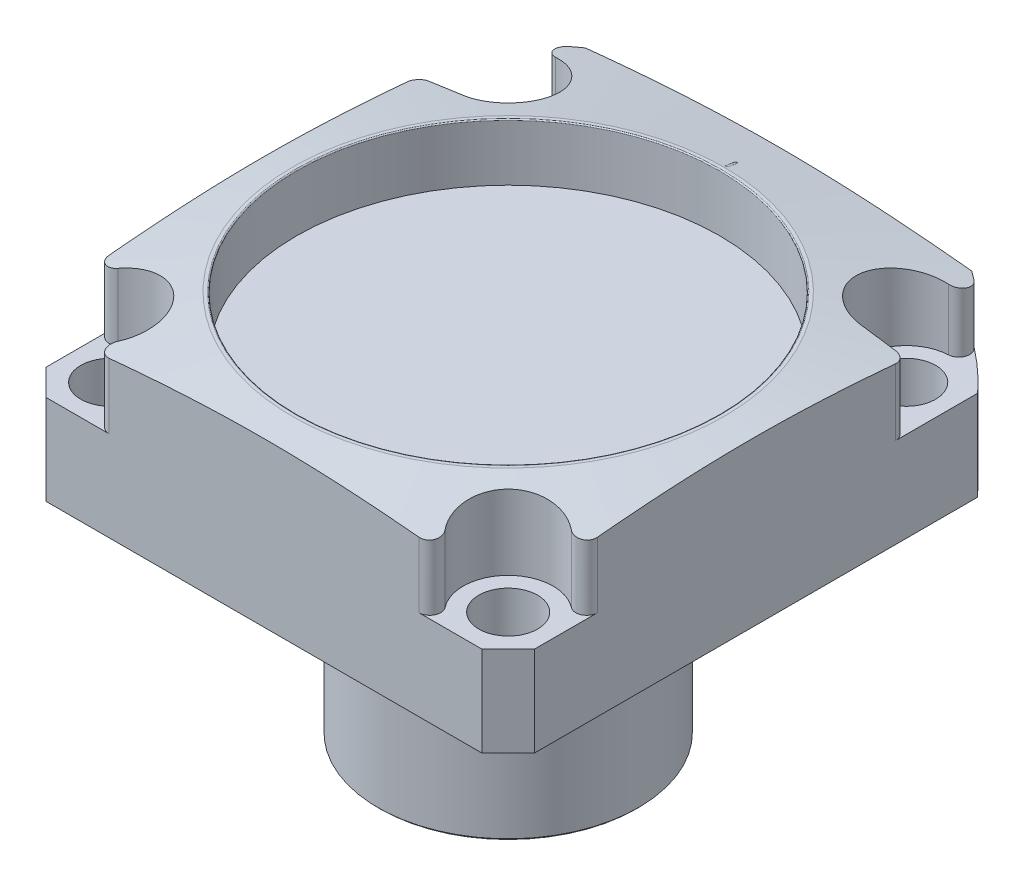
ISO-10303-21;
HEADER;
FILE_DESCRIPTION(('STEP AP214'),'2;1');
FILE_NAME('part.step','',(''),(''),'','','');
FILE_SCHEMA(('AUTOMOTIVE_DESIGN { 1 0 10303 214 1 1 1 1 }'));
ENDSEC;
DATA;
#1=APPLICATION_CONTEXT('core data for automotive mechanical design processes');
#2=APPLICATION_PROTOCOL_DEFINITION('international standard','automotive_design',2000,#1);
#3=PRODUCT_CONTEXT('',#1,'mechanical');
#4=PRODUCT('Part','Part','',(#3));
#5=PRODUCT_RELATED_PRODUCT_CATEGORY('part','',(#4));
#6=PRODUCT_DEFINITION_FORMATION('','',#4);
#7=PRODUCT_DEFINITION_CONTEXT('part definition',#1,'design');
#8=PRODUCT_DEFINITION('design','',#6,#7);
#9=PRODUCT_DEFINITION_SHAPE('','',#8);
#10=(LENGTH_UNIT() NAMED_UNIT(*) SI_UNIT(.MILLI.,.METRE.));
#11=(NAMED_UNIT(*) PLANE_ANGLE_UNIT() SI_UNIT($,.RADIAN.));
#12=(NAMED_UNIT(*) SI_UNIT($,.STERADIAN.) SOLID_ANGLE_UNIT());
#13=UNCERTAINTY_MEASURE_WITH_UNIT(LENGTH_MEASURE(1.E-05),#10,'distance_accuracy_value','');
#14=(GEOMETRIC_REPRESENTATION_CONTEXT(3) GLOBAL_UNCERTAINTY_ASSIGNED_CONTEXT((#13)) GLOBAL_UNIT_ASSIGNED_CONTEXT((#10,
#11,#12)) REPRESENTATION_CONTEXT('',''));
#15=CARTESIAN_POINT('',(0.,0.,0.));
#16=DIRECTION('',(0.,0.,1.));
#17=DIRECTION('',(1.,0.,0.));
#18=AXIS2_PLACEMENT_3D('',#15,#16,#17);
#19=CARTESIAN_POINT('',(19.9898,0.876299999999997,-52.7558));
#20=DIRECTION('',(0.,1.,0.));
#21=DIRECTION('',(0.,0.,1.));
#22=AXIS2_PLACEMENT_3D('',#19,#20,#21);
#23=TOROIDAL_SURFACE('',#22,6.3373,1.7653);
#24=CARTESIAN_POINT('',(19.9898,0.876299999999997,-44.6532));
#25=VERTEX_POINT('',#24);
#26=VERTEX_LOOP('',#25);
#27=FACE_BOUND('',#26,.T.);
#28=ADVANCED_FACE('F38',(#27),#23,.T.);
#29=CLOSED_SHELL('',(#28));
#30=MANIFOLD_SOLID_BREP('B2',#29);
#31=CARTESIAN_POINT('',(-19.9898,0.876299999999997,-52.7558));
#32=DIRECTION('',(0.,1.,0.));
#33=DIRECTION('',(0.,0.,1.));
#34=AXIS2_PLACEMENT_3D('',#31,#32,#33);
#35=TOROIDAL_SURFACE('',#34,6.3373,1.7653);
#36=CARTESIAN_POINT('',(-19.9898,0.876299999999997,-44.6532));
#37=VERTEX_POINT('',#36);
#38=VERTEX_LOOP('',#37);
#39=FACE_BOUND('',#38,.T.);
#40=ADVANCED_FACE('F60',(#39),#35,.T.);
#41=CLOSED_SHELL('',(#40));
#42=MANIFOLD_SOLID_BREP('B7',#41);
#43=CARTESIAN_POINT('',(0.,33.913580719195,0.));
#44=DIRECTION('',(0.,-1.,0.));
#45=DIRECTION('',(0.,0.,-1.));
#46=AXIS2_PLACEMENT_3D('',#43,#44,#45);
#47=CONICAL_SURFACE('',#46,76.2,1.39626340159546);
#48=CARTESIAN_POINT('',(-0.10214571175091,38.4509063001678,-50.4674445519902));
#49=CARTESIAN_POINT('',(-0.114964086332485,38.4518998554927,-50.4617839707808));
#50=CARTESIAN_POINT('',(-0.127282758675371,38.4530841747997,-50.4550374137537));
#51=CARTESIAN_POINT('',(-0.150591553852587,38.4557922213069,-50.4396150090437));
#52=CARTESIAN_POINT('',(-0.161582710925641,38.4573156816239,-50.4309406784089));
#53=CARTESIAN_POINT('',(-0.181932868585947,38.4606623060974,-50.4118916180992));
#54=CARTESIAN_POINT('',(-0.191291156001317,38.4624856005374,-50.4015161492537));
#55=CARTESIAN_POINT('',(-0.2081058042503,38.4663790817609,-50.3793683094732));
#56=CARTESIAN_POINT('',(-0.215562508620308,38.4684492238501,-50.3675961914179));
#57=CARTESIAN_POINT('',(-0.228367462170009,38.4727791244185,-50.3429834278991));
#58=CARTESIAN_POINT('',(-0.233715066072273,38.4750389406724,-50.3301424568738));
#59=CARTESIAN_POINT('',(-0.242148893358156,38.479684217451,-50.3037576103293));
#60=CARTESIAN_POINT('',(-0.245234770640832,38.4820696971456,-50.290213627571));
#61=CARTESIAN_POINT('',(-0.249058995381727,38.4869011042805,-50.2627942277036));
#62=CARTESIAN_POINT('',(-0.249794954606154,38.4893470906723,-50.2489184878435));
#63=CARTESIAN_POINT('',(-0.248891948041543,38.4942276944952,-50.2212433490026));
#64=CARTESIAN_POINT('',(-0.247253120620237,38.4966623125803,-50.2074439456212));
#65=CARTESIAN_POINT('',(-0.24164577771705,38.5014521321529,-50.1803065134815));
#66=CARTESIAN_POINT('',(-0.237676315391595,38.503807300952,-50.1669686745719));
#67=CARTESIAN_POINT('',(-0.227518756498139,38.5083700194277,-50.1411390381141));
#68=CARTESIAN_POINT('',(-0.22133061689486,38.5105775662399,-50.1286472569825));
#69=CARTESIAN_POINT('',(-0.206913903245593,38.5147807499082,-50.1048711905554));
#70=CARTESIAN_POINT('',(-0.198686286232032,38.5167764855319,-50.0935863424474));
#71=CARTESIAN_POINT('',(-0.180421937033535,38.520499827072,-50.0725391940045));
#72=CARTESIAN_POINT('',(-0.170385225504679,38.5222274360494,-50.0627768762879));
#73=CARTESIAN_POINT('',(-0.1487993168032,38.525362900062,-50.0450635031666));
#74=CARTESIAN_POINT('',(-0.137251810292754,38.5267711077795,-50.0371104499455));
#75=CARTESIAN_POINT('',(-0.112963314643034,38.5292294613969,-50.0232291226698));
#76=CARTESIAN_POINT('',(-0.100222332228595,38.5302796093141,-50.0173008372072));
#77=CARTESIAN_POINT('',(-0.0739260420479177,38.5319902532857,-50.0076450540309));
#78=CARTESIAN_POINT('',(-0.060371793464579,38.5326512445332,-50.0039147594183));
#79=CARTESIAN_POINT('',(-0.0328194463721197,38.5335664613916,-49.9987499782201));
#80=CARTESIAN_POINT('',(-0.0188213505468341,38.5338206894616,-49.9973154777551));
#81=CARTESIAN_POINT('',(0.00920829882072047,38.5339149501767,-49.9967835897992));
#82=CARTESIAN_POINT('',(0.0232398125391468,38.5337553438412,-49.9976841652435));
#83=CARTESIAN_POINT('',(0.0509500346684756,38.5330273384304,-50.0017923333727));
#84=CARTESIAN_POINT('',(0.0646287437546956,38.5324589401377,-50.0049999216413));
#85=CARTESIAN_POINT('',(0.091244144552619,38.5309299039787,-50.0136300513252));
#86=CARTESIAN_POINT('',(0.104180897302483,38.5299692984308,-50.0190524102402));
#87=CARTESIAN_POINT('',(0.128947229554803,38.527683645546,-50.0319573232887));
#88=CARTESIAN_POINT('',(0.140776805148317,38.5263585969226,-50.0394398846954));
#89=CARTESIAN_POINT('',(0.1630027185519,38.5233811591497,-50.056258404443));
#90=CARTESIAN_POINT('',(0.173397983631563,38.5217285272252,-50.065595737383));
#91=CARTESIAN_POINT('',(0.192451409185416,38.5181440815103,-50.0858546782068));
#92=CARTESIAN_POINT('',(0.201109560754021,38.5162122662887,-50.0967762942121));
#93=CARTESIAN_POINT('',(0.216454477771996,38.5121222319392,-50.1199083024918));
#94=CARTESIAN_POINT('',(0.223138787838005,38.5099637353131,-50.1321202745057));
#95=CARTESIAN_POINT('',(0.23433338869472,38.5054839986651,-50.1574753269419));
#96=CARTESIAN_POINT('',(0.238843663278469,38.5031627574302,-50.1706184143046));
#97=CARTESIAN_POINT('',(0.245567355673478,38.4984207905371,-50.1974793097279));
#98=CARTESIAN_POINT('',(0.247778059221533,38.4959999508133,-50.2111977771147));
#99=CARTESIAN_POINT('',(0.24983099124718,38.4911301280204,-50.2388060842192));
#100=CARTESIAN_POINT('',(0.249673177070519,38.4886811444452,-50.2526959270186));
#101=CARTESIAN_POINT('',(0.246992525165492,38.4838228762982,-50.2802621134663));
#102=CARTESIAN_POINT('',(0.244468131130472,38.4814136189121,-50.2939383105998));
#103=CARTESIAN_POINT('',(0.237123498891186,38.4767049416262,-50.3206780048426));
#104=CARTESIAN_POINT('',(0.232303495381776,38.4744055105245,-50.3337415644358));
#105=CARTESIAN_POINT('',(0.220506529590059,38.4699822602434,-50.3588803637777));
#106=CARTESIAN_POINT('',(0.213530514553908,38.4678583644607,-50.3709560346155));
#107=CARTESIAN_POINT('',(0.197612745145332,38.4638439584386,-50.3937879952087));
#108=CARTESIAN_POINT('',(0.188669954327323,38.4619535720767,-50.4045435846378));
#109=CARTESIAN_POINT('',(0.169078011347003,38.4584613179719,-50.4244187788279));
#110=CARTESIAN_POINT('',(0.15842896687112,38.4568594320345,-50.433538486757));
#111=CARTESIAN_POINT('',(0.135741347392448,38.4539919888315,-50.4498667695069));
#112=CARTESIAN_POINT('',(0.123706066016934,38.4527256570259,-50.4570797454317));
#113=CARTESIAN_POINT('',(0.108182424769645,38.4513878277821,-50.4647011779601));
#114=CARTESIAN_POINT('',(0.105177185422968,38.4511417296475,-50.4661032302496));
#115=CARTESIAN_POINT('',(0.102145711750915,38.4509063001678,-50.4674445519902));
#116=B_SPLINE_CURVE_WITH_KNOTS('',3,(#48,#49,#50,#51,#52,#53,#54,#55,#56,#57,#58,#59,#60,#61,
#62,#63,#64,#65,#66,#67,#68,#69,#70,#71,#72,#73,#74,#75,#76,#77,#78,#79,#80,#81,#82,#83,#84,#85,
#86,#87,#88,#89,#90,#91,#92,#93,#94,#95,#96,#97,#98,#99,#100,#101,#102,#103,#104,#105,#106,#107,
#108,#109,#110,#111,#112,#113,#114,#115),.UNSPECIFIED.,.F.,.F.,(4,2,2,2,2,2,2,2,2,2,2,2,2,2,2,2,
2,2,2,2,2,2,2,2,2,2,2,2,2,2,2,2,2,4),(0.,0.0420867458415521,0.0841404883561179,
0.126212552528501,0.168277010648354,0.210354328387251,0.252438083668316,0.294564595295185,
0.336688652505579,0.378829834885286,0.420971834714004,0.463094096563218,0.505215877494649,
0.547290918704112,0.589365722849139,0.631386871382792,0.673407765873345,0.715392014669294,
0.757376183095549,0.799356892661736,0.841337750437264,0.883349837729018,0.925362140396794,
0.96742648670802,1.00949114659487,1.05160540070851,1.09372041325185,1.13586314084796,
1.17800156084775,1.22012149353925,1.26226367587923,1.30440319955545,1.346444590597,
1.35641759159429),.UNSPECIFIED.);
#117=CARTESIAN_POINT('',(-0.249472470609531,38.4903926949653,-50.2429900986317));
#118=VERTEX_POINT('',#117);
#119=CARTESIAN_POINT('',(0.249472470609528,38.4903926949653,-50.2429900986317));
#120=VERTEX_POINT('',#119);
#121=EDGE_CURVE('E58',#118,#120,#116,.T.);
#122=ORIENTED_EDGE('',*,*,#121,.F.);
#123=CARTESIAN_POINT('',(-0.249486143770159,38.103609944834,-52.4365699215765));
#124=CARTESIAN_POINT('',(-0.249483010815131,38.1962212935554,-51.9113389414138));
#125=CARTESIAN_POINT('',(-0.249479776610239,38.2888326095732,-51.3861079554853));
#126=CARTESIAN_POINT('',(-0.249475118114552,38.4181790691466,-50.6525389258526));
#127=CARTESIAN_POINT('',(-0.249473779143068,38.4549142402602,-50.444200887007));
#128=CARTESIAN_POINT('',(-0.249472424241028,38.4916494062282,-50.2358628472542));
#129=B_SPLINE_CURVE_WITH_KNOTS('',3,(#123,#124,#125,#126,#127,#128),.UNSPECIFIED.,.F.,.F.,(4,2,
4),(0.,1.60000000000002,2.23465573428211),.UNSPECIFIED.);
#130=CARTESIAN_POINT('',(-0.249484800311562,38.1431003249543,-52.212606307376));
#131=VERTEX_POINT('',#130);
#132=EDGE_CURVE('E266',#131,#118,#129,.T.);
#133=ORIENTED_EDGE('',*,*,#132,.F.);
#134=CARTESIAN_POINT('',(0.249380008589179,38.1443572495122,-52.2054783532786));
#135=CARTESIAN_POINT('',(0.249798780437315,38.1419165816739,-52.2193180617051));
#136=CARTESIAN_POINT('',(0.249009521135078,38.1394714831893,-52.2331889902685));
#137=CARTESIAN_POINT('',(0.245090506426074,38.134641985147,-52.2605973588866));
#138=CARTESIAN_POINT('',(0.241962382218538,38.1322575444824,-52.2741350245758));
#139=CARTESIAN_POINT('',(0.233439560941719,38.1276142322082,-52.3005075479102));
#140=CARTESIAN_POINT('',(0.228043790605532,38.1253554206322,-52.3133420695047));
#141=CARTESIAN_POINT('',(0.215142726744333,38.1210287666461,-52.3379346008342));
#142=CARTESIAN_POINT('',(0.207637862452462,38.1189608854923,-52.3496928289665));
#143=CARTESIAN_POINT('',(0.190729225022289,38.1150740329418,-52.3718007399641));
#144=CARTESIAN_POINT('',(0.181325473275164,38.1132550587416,-52.3821504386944));
#145=CARTESIAN_POINT('',(0.160883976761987,38.109917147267,-52.4011475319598));
#146=CARTESIAN_POINT('',(0.149845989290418,38.1083982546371,-52.4097946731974));
#147=CARTESIAN_POINT('',(0.126464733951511,38.1057054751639,-52.4251278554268));
#148=CARTESIAN_POINT('',(0.114123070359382,38.1045311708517,-52.4318162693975));
#149=CARTESIAN_POINT('',(0.0884747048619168,38.1025583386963,-52.4430543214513));
#150=CARTESIAN_POINT('',(0.0751680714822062,38.1017597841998,-52.4476041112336));
#151=CARTESIAN_POINT('',(0.04798275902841,38.1005615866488,-52.4544313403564));
#152=CARTESIAN_POINT('',(0.0341047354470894,38.1001614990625,-52.4567113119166));
#153=CARTESIAN_POINT('',(0.00615673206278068,38.0997699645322,-52.4589425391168));
#154=CARTESIAN_POINT('',(-0.00791325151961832,38.0997785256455,-52.4588937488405));
#155=CARTESIAN_POINT('',(-0.0358362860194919,38.1002039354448,-52.4564694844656));
#156=CARTESIAN_POINT('',(-0.0496894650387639,38.1006205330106,-52.4540954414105));
#157=CARTESIAN_POINT('',(-0.0767944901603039,38.1018498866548,-52.4470907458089));
#158=CARTESIAN_POINT('',(-0.0900463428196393,38.1026626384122,-52.4424601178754));
#159=CARTESIAN_POINT('',(-0.115575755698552,38.1046615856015,-52.4310734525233));
#160=CARTESIAN_POINT('',(-0.127853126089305,38.1058478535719,-52.4243170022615));
#161=CARTESIAN_POINT('',(-0.151083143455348,38.1085603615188,-52.4088717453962));
#162=CARTESIAN_POINT('',(-0.162035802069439,38.110086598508,-52.4001829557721));
#163=CARTESIAN_POINT('',(-0.182315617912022,38.1134374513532,-52.3811125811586));
#164=CARTESIAN_POINT('',(-0.19164143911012,38.1152623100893,-52.3707296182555));
#165=CARTESIAN_POINT('',(-0.208394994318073,38.119158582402,-52.3485686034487));
#166=CARTESIAN_POINT('',(-0.215822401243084,38.1212300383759,-52.3367903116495));
#167=CARTESIAN_POINT('',(-0.228578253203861,38.1255640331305,-52.3121566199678));
#168=CARTESIAN_POINT('',(-0.233903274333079,38.1278268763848,-52.2992995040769));
#169=CARTESIAN_POINT('',(-0.242283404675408,38.1324762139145,-52.2728933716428));
#170=CARTESIAN_POINT('',(-0.245340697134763,38.1348625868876,-52.2593450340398));
#171=CARTESIAN_POINT('',(-0.248139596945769,38.1384486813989,-52.2389938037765));
#172=CARTESIAN_POINT('',(-0.248777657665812,38.1396284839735,-52.2322996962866));
#173=CARTESIAN_POINT('',(-0.249495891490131,38.1419914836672,-52.2188948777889));
#174=CARTESIAN_POINT('',(-0.249577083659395,38.1431746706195,-52.2121842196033));
#175=CARTESIAN_POINT('',(-0.249380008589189,38.1443572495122,-52.2054783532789));
#176=B_SPLINE_CURVE_WITH_KNOTS('',3,(#134,#135,#136,#137,#138,#139,#140,#141,#142,#143,#144,
#145,#146,#147,#148,#149,#150,#151,#152,#153,#154,#155,#156,#157,#158,#159,#160,#161,#162,#163,
#164,#165,#166,#167,#168,#169,#170,#171,#172,#173,#174,#175),.UNSPECIFIED.,.F.,.F.,(4,2,2,2,2,2,
2,2,2,2,2,2,2,2,2,2,2,2,2,2,4),(0.,0.0421227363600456,0.0842161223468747,0.126329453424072,
0.168434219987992,0.210538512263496,0.25264906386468,0.294708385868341,0.336764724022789,
0.378774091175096,0.420784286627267,0.462768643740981,0.504752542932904,0.546744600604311,
0.588736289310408,0.630762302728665,0.672795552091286,0.714896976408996,0.756957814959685,
0.777419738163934,0.797844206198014),.UNSPECIFIED.);
#177=CARTESIAN_POINT('',(0.249484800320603,38.1431003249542,-52.212606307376));
#178=VERTEX_POINT('',#177);
#179=EDGE_CURVE('E261',#178,#131,#176,.T.);
#180=ORIENTED_EDGE('',*,*,#179,.F.);
#181=CARTESIAN_POINT('',(0.249472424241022,38.4916494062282,-50.2358628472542));
#182=CARTESIAN_POINT('',(0.249475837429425,38.3990381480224,-50.7610938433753));
#183=CARTESIAN_POINT('',(0.24947915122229,38.3064268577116,-51.2863248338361));
#184=CARTESIAN_POINT('',(0.249483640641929,38.1770803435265,-52.0198938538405));
#185=CARTESIAN_POINT('',(0.249484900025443,38.1403451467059,-52.2282318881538));
#186=CARTESIAN_POINT('',(0.24948614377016,38.103609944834,-52.4365699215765));
#187=B_SPLINE_CURVE_WITH_KNOTS('',3,(#181,#182,#183,#184,#185,#186),.UNSPECIFIED.,.F.,.F.,(4,2,
4),(0.,1.60000000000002,2.23465573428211),.UNSPECIFIED.);
#188=EDGE_CURVE('E87',#120,#178,#187,.T.);
#189=ORIENTED_EDGE('',*,*,#188,.F.);
#190=EDGE_LOOP('',(#122,#133,#180,#189));
#191=FACE_BOUND('',#190,.T.);
#192=CARTESIAN_POINT('',(45.6440119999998,34.6151604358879,-55.9688999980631));
#193=CARTESIAN_POINT('',(45.351079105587,34.6478001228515,-55.9689377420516));
#194=CARTESIAN_POINT('',(45.0583254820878,34.6819418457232,-55.9564466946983));
#195=CARTESIAN_POINT('',(44.4753005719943,34.7530253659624,-55.9067274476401));
#196=CARTESIAN_POINT('',(44.1850290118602,34.7899668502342,-55.8695020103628));
#197=CARTESIAN_POINT('',(43.6093557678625,34.8664094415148,-55.7706909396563));
#198=CARTESIAN_POINT('',(43.3239488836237,34.9059075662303,-55.7091332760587));
#199=CARTESIAN_POINT('',(42.7596836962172,34.9872815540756,-55.562190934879));
#200=CARTESIAN_POINT('',(42.4808254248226,35.0291574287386,-55.476806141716));
#201=CARTESIAN_POINT('',(41.9315784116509,35.1150581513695,-55.282879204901));
#202=CARTESIAN_POINT('',(41.6611908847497,35.1590833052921,-55.1743337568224));
#203=CARTESIAN_POINT('',(41.1308066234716,35.2490266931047,-54.9349316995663));
#204=CARTESIAN_POINT('',(40.8708099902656,35.2949449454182,-54.8040748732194));
#205=CARTESIAN_POINT('',(40.3630167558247,35.3884059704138,-54.5210393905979));
#206=CARTESIAN_POINT('',(40.1152196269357,35.4359486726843,-54.3688616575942));
#207=CARTESIAN_POINT('',(39.6335129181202,35.5323790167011,-54.0442965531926));
#208=CARTESIAN_POINT('',(39.3996033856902,35.5812666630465,-53.8719091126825));
#209=CARTESIAN_POINT('',(38.9453169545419,35.6805166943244,-53.5065947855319));
#210=CARTESIAN_POINT('',(38.7250741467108,35.7308881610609,-53.3135035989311));
#211=CARTESIAN_POINT('',(38.3018666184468,35.8323776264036,-52.9094127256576));
#212=CARTESIAN_POINT('',(38.0989020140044,35.8834956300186,-52.6984129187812));
#213=CARTESIAN_POINT('',(37.7116274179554,35.9861505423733,-52.2599699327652));
#214=CARTESIAN_POINT('',(37.5273204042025,36.0376875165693,-52.0325241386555));
#215=CARTESIAN_POINT('',(37.1786810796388,36.1408210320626,-51.5628195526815));
#216=CARTESIAN_POINT('',(37.0143488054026,36.1924175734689,-51.3205607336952));
#217=CARTESIAN_POINT('',(36.7057320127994,36.2956658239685,-50.8211716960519));
#218=CARTESIAN_POINT('',(36.5615964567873,36.347315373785,-50.5639489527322));
#219=CARTESIAN_POINT('',(36.295794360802,36.4499150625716,-50.0380090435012));
#220=CARTESIAN_POINT('',(36.174127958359,36.500865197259,-49.7692918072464));
#221=CARTESIAN_POINT('',(35.9541693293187,36.6016616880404,-49.2222656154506));
#222=CARTESIAN_POINT('',(35.85587624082,36.6515080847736,-48.9439570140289));
#223=CARTESIAN_POINT('',(35.6834123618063,36.749684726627,-48.3797020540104));
#224=CARTESIAN_POINT('',(35.6092414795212,36.7980149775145,-48.0937557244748));
#225=CARTESIAN_POINT('',(35.4857450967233,36.8926419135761,-47.5168240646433));
#226=CARTESIAN_POINT('',(35.4363705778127,36.9389424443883,-47.2258498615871));
#227=CARTESIAN_POINT('',(35.3626851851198,37.029184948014,-46.640379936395));
#228=CARTESIAN_POINT('',(35.3383743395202,37.0731269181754,-46.3458842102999));
#229=CARTESIAN_POINT('',(35.3150904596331,37.1582232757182,-45.7554934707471));
#230=CARTESIAN_POINT('',(35.3161170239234,37.1993777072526,-45.4595984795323));
#231=CARTESIAN_POINT('',(35.3436075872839,37.2784756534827,-44.8685606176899));
#232=CARTESIAN_POINT('',(35.3700712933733,37.3164192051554,-44.5734177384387));
#233=CARTESIAN_POINT('',(35.4478519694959,37.388220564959,-43.9898243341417));
#234=CARTESIAN_POINT('',(35.4988465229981,37.4221244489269,-43.7013365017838));
#235=CARTESIAN_POINT('',(35.6252841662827,37.486023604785,-43.1293253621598));
#236=CARTESIAN_POINT('',(35.7007270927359,37.516018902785,-42.8458020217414));
#237=CARTESIAN_POINT('',(35.8756040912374,37.5717478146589,-42.2858499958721));
#238=CARTESIAN_POINT('',(35.9750359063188,37.5974818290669,-42.0094206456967));
#239=CARTESIAN_POINT('',(36.1972514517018,37.6443776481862,-41.4657107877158));
#240=CARTESIAN_POINT('',(36.3200348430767,37.6655395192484,-41.1984301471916));
#241=CARTESIAN_POINT('',(36.5855445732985,37.7026646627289,-40.6800663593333));
#242=CARTESIAN_POINT('',(36.7278440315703,37.7187197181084,-40.4287710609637));
#243=CARTESIAN_POINT('',(37.0331247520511,37.7459728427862,-39.9387961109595));
#244=CARTESIAN_POINT('',(37.1961057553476,37.7571709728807,-39.7001163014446));
#245=CARTESIAN_POINT('',(37.5415759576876,37.7745656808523,-39.2371731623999));
#246=CARTESIAN_POINT('',(37.7240626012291,37.7807629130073,-39.0129079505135));
#247=CARTESIAN_POINT('',(38.1072428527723,37.7880776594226,-38.5804240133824));
#248=CARTESIAN_POINT('',(38.3079362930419,37.789195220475,-38.3722051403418));
#249=CARTESIAN_POINT('',(38.723016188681,37.7863570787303,-37.9762484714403));
#250=CARTESIAN_POINT('',(38.9371612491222,37.7824748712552,-37.7882569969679));
#251=CARTESIAN_POINT('',(39.3801630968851,37.7698127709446,-37.4306751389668));
#252=CARTESIAN_POINT('',(39.6090198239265,37.761032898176,-37.2610846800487));
#253=CARTESIAN_POINT('',(40.0798648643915,37.738682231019,-36.9414339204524));
#254=CARTESIAN_POINT('',(40.3218570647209,37.7251100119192,-36.7913794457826));
#255=CARTESIAN_POINT('',(40.8171628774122,37.6933427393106,-36.5118774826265));
#256=CARTESIAN_POINT('',(41.070476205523,37.6751478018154,-36.3824294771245));
#257=CARTESIAN_POINT('',(41.5868978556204,37.6343313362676,-36.1448521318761));
#258=CARTESIAN_POINT('',(41.8500164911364,37.6117050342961,-36.0367460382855));
#259=CARTESIAN_POINT('',(42.3839275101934,37.5623014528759,-35.8427021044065));
#260=CARTESIAN_POINT('',(42.6547199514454,37.5355241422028,-35.7567644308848));
#261=CARTESIAN_POINT('',(43.2017524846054,37.4781534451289,-35.6076492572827));
#262=CARTESIAN_POINT('',(43.4779858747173,37.447564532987,-35.5444454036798));
#263=CARTESIAN_POINT('',(44.0342061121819,37.3828844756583,-35.4410149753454));
#264=CARTESIAN_POINT('',(44.3141911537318,37.3487949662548,-35.4007777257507));
#265=CARTESIAN_POINT('',(44.7696321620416,37.2909728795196,-35.3542764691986));
#266=CARTESIAN_POINT('',(44.9445181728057,37.2682072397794,-35.3409173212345));
#267=CARTESIAN_POINT('',(45.2942922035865,37.2215823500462,-35.3231342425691));
#268=CARTESIAN_POINT('',(45.4691797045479,37.1977250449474,-35.3186950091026));
#269=CARTESIAN_POINT('',(45.6440119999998,37.1733436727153,-35.3187000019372));
#270=B_SPLINE_CURVE_WITH_KNOTS('',3,(#192,#193,#194,#195,#196,#197,#198,#199,#200,#201,#202,
#203,#204,#205,#206,#207,#208,#209,#210,#211,#212,#213,#214,#215,#216,#217,#218,#219,#220,#221,
#222,#223,#224,#225,#226,#227,#228,#229,#230,#231,#232,#233,#234,#235,#236,#237,#238,#239,#240,
#241,#242,#243,#244,#245,#246,#247,#248,#249,#250,#251,#252,#253,#254,#255,#256,#257,#258,#259,
#260,#261,#262,#263,#264,#265,#266,#267,#268,#269),.UNSPECIFIED.,.F.,.F.,(4,2,2,2,2,2,2,2,2,2,2,
2,2,2,2,2,2,2,2,2,2,2,2,2,2,2,2,2,2,2,2,2,2,2,2,2,2,2,4),(0.,0.883951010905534,1.76780331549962,
2.65064257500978,3.53348611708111,4.41645570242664,5.29943388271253,6.18237383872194,
7.06531681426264,7.95587372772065,8.84643661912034,9.73714142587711,10.6278478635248,
11.5248121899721,12.4217820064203,13.3187187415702,14.2156520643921,15.1108052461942,
16.0059594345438,16.9010994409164,17.7962291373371,18.6799026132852,19.5635701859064,
20.4471546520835,21.3307262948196,22.1973794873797,23.0640218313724,23.930550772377,
24.7970717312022,25.6509992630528,26.5049232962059,27.3591014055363,28.2132580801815,
29.0683400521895,29.9234284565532,30.7775224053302,31.6312190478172,32.1616094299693,
32.6910891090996),.UNSPECIFIED.);
#271=CARTESIAN_POINT('',(45.0649273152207,34.6816764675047,-55.9526594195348));
#272=VERTEX_POINT('',#271);
#273=CARTESIAN_POINT('',(45.6438119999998,37.1733715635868,-35.3187000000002));
#274=VERTEX_POINT('',#273);
#275=EDGE_CURVE('E410',#272,#274,#270,.T.);
#276=ORIENTED_EDGE('',*,*,#275,.F.);
#277=CARTESIAN_POINT('',(45.0649273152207,34.6816764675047,-55.9526594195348));
#278=CARTESIAN_POINT('',(45.1355300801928,34.6733240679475,-55.956617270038));
#279=CARTESIAN_POINT('',(45.2059104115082,34.664571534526,-55.9635941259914));
#280=CARTESIAN_POINT('',(45.3457242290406,34.6463412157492,-55.9834799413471));
#281=CARTESIAN_POINT('',(45.4151578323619,34.6368635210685,-55.9963881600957));
#282=CARTESIAN_POINT('',(45.5525146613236,34.6172671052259,-56.0280135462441));
#283=CARTESIAN_POINT('',(45.6204395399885,34.6071491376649,-56.0467239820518));
#284=CARTESIAN_POINT('',(45.7543664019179,34.586345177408,-56.0897887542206));
#285=CARTESIAN_POINT('',(45.8203683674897,34.5756591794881,-56.1141431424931));
#286=CARTESIAN_POINT('',(46.0148104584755,34.5428659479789,-56.1954180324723));
#287=CARTESIAN_POINT('',(46.1397972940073,34.5200076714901,-56.2605758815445));
#288=CARTESIAN_POINT('',(46.3767812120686,34.4730157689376,-56.4108201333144));
#289=CARTESIAN_POINT('',(46.4887783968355,34.4488821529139,-56.4959063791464));
#290=CARTESIAN_POINT('',(46.6978154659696,34.3997805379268,-56.6845081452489));
#291=CARTESIAN_POINT('',(46.7947041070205,34.3748068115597,-56.7881901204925));
#292=CARTESIAN_POINT('',(46.9695165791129,34.3249520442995,-57.0105061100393));
#293=CARTESIAN_POINT('',(47.047437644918,34.3000710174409,-57.1291423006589));
#294=CARTESIAN_POINT('',(47.182398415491,34.2509806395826,-57.378633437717));
#295=CARTESIAN_POINT('',(47.2393378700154,34.2267750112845,-57.5095433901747));
#296=CARTESIAN_POINT('',(47.3300915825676,34.179837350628,-57.7793961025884));
#297=CARTESIAN_POINT('',(47.3639070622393,34.1571052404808,-57.9183384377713));
#298=CARTESIAN_POINT('',(47.4071878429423,34.1138630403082,-58.1995634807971));
#299=CARTESIAN_POINT('',(47.4167767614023,34.0933421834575,-58.3418254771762));
#300=CARTESIAN_POINT('',(47.4115064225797,34.0549699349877,-58.6262503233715));
#301=CARTESIAN_POINT('',(47.3966505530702,34.0371181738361,-58.768413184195));
#302=CARTESIAN_POINT('',(47.343091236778,34.0047996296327,-59.0466767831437));
#303=CARTESIAN_POINT('',(47.3046926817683,33.9902927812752,-59.1828315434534));
#304=CARTESIAN_POINT('',(47.2052327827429,33.9647843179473,-59.4470314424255));
#305=CARTESIAN_POINT('',(47.144162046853,33.9537841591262,-59.5750731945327));
#306=CARTESIAN_POINT('',(47.002014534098,33.9357383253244,-59.8174927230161));
#307=CARTESIAN_POINT('',(46.9212158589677,33.928641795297,-59.9320301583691));
#308=CARTESIAN_POINT('',(46.7415756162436,33.9183961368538,-60.1458427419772));
#309=CARTESIAN_POINT('',(46.6427755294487,33.915238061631,-60.2451520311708));
#310=CARTESIAN_POINT('',(46.5057720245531,33.913746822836,-60.3615049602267));
#311=CARTESIAN_POINT('',(46.474424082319,33.9135796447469,-60.3868408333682));
#312=CARTESIAN_POINT('',(46.4424897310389,33.913580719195,-60.4113825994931));
#313=B_SPLINE_CURVE_WITH_KNOTS('',3,(#277,#278,#279,#280,#281,#282,#283,#284,#285,#286,#287,
#288,#289,#290,#291,#292,#293,#294,#295,#296,#297,#298,#299,#300,#301,#302,#303,#304,#305,#306,
#307,#308,#309,#310,#311,#312),.UNSPECIFIED.,.F.,.F.,(4,2,2,2,2,2,2,2,2,2,2,2,2,2,2,2,2,4),(0.,
0.213541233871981,0.427055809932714,0.640323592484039,0.853593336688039,1.27979350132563,
1.70599031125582,2.13621206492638,2.56649650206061,2.99881097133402,3.43110259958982,
3.86118393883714,4.29120567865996,4.71577268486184,5.1405157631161,5.55958583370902,
5.97770217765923,6.09856821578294),.UNSPECIFIED.);
#314=CARTESIAN_POINT('',(46.4424897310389,33.913580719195,-60.4113825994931));
#315=VERTEX_POINT('',#314);
#316=EDGE_CURVE('E506',#272,#315,#313,.T.);
#317=ORIENTED_EDGE('',*,*,#316,.T.);
#318=CARTESIAN_POINT('',(0.,33.913580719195,0.));
#319=DIRECTION('',(0.,-1.,0.));
#320=DIRECTION('',(0.,0.,-1.));
#321=AXIS2_PLACEMENT_3D('',#318,#319,#320);
#322=CIRCLE('',#321,76.2);
#323=CARTESIAN_POINT('',(44.2994356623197,33.913580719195,-62.));
#324=VERTEX_POINT('',#323);
#325=EDGE_CURVE('E493',#324,#315,#322,.T.);
#326=ORIENTED_EDGE('',*,*,#325,.F.);
#327=CARTESIAN_POINT('',(-116.505623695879,24.0788366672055,-62.));
#328=CARTESIAN_POINT('',(-114.951640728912,24.3207236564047,-62.));
#329=CARTESIAN_POINT('',(-113.397496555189,24.5615745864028,-62.));
#330=CARTESIAN_POINT('',(-110.288852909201,25.0409798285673,-62.));
#331=CARTESIAN_POINT('',(-108.734353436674,25.2795341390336,-62.));
#332=CARTESIAN_POINT('',(-104.07024884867,25.991419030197,-62.));
#333=CARTESIAN_POINT('',(-100.96006489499,26.4609673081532,-62.));
#334=CARTESIAN_POINT('',(-94.737750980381,27.3877473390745,-62.));
#335=CARTESIAN_POINT('',(-91.6256209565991,27.844978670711,-62.));
#336=CARTESIAN_POINT('',(-85.3991613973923,28.74421298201,-62.));
#337=CARTESIAN_POINT('',(-82.2848318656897,29.1862159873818,-62.));
#338=CARTESIAN_POINT('',(-76.0613549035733,30.0501807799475,-62.));
#339=CARTESIAN_POINT('',(-72.9522140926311,30.4721900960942,-62.));
#340=CARTESIAN_POINT('',(-66.7307990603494,31.2925779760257,-62.));
#341=CARTESIAN_POINT('',(-63.6185248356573,31.6909565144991,-62.));
#342=CARTESIAN_POINT('',(-57.3897525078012,32.4580365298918,-62.));
#343=CARTESIAN_POINT('',(-54.2732537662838,32.8267328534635,-62.));
#344=CARTESIAN_POINT('',(-48.0360075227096,33.526660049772,-62.));
#345=CARTESIAN_POINT('',(-44.9152600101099,33.8578908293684,-62.));
#346=CARTESIAN_POINT('',(-38.6527603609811,34.4750973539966,-62.));
#347=CARTESIAN_POINT('',(-35.5109837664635,34.7608272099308,-62.));
#348=CARTESIAN_POINT('',(-29.2225764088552,35.2739357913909,-62.));
#349=CARTESIAN_POINT('',(-26.0759456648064,35.5013147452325,-62.));
#350=CARTESIAN_POINT('',(-21.3535180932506,35.790131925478,-62.));
#351=CARTESIAN_POINT('',(-19.7792990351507,35.8776826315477,-62.));
#352=CARTESIAN_POINT('',(-16.6299254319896,36.0341298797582,-62.));
#353=CARTESIAN_POINT('',(-15.0547708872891,36.1030264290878,-62.));
#354=CARTESIAN_POINT('',(-11.9037336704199,36.2210628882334,-62.));
#355=CARTESIAN_POINT('',(-10.3278510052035,36.2702029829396,-62.));
#356=CARTESIAN_POINT('',(-7.17557535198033,36.347891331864,-62.));
#357=CARTESIAN_POINT('',(-5.59918236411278,36.3764395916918,-62.));
#358=CARTESIAN_POINT('',(-2.44349340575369,36.4124658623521,-62.));
#359=CARTESIAN_POINT('',(-0.864197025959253,36.4199082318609,-62.));
#360=CARTESIAN_POINT('',(2.29435215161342,36.4134852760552,-62.));
#361=CARTESIAN_POINT('',(3.87360494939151,36.3996199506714,-62.));
#362=CARTESIAN_POINT('',(7.03179149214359,36.35083352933,-62.));
#363=CARTESIAN_POINT('',(8.61072523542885,36.3159123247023,-62.));
#364=CARTESIAN_POINT('',(11.7680056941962,36.2256312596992,-62.));
#365=CARTESIAN_POINT('',(13.3463524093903,36.1702713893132,-62.));
#366=CARTESIAN_POINT('',(16.5029032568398,36.0400148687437,-62.));
#367=CARTESIAN_POINT('',(18.0811070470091,35.9651099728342,-62.));
#368=CARTESIAN_POINT('',(21.2365377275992,35.7969439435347,-62.));
#369=CARTESIAN_POINT('',(22.8137646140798,35.7036827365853,-62.));
#370=CARTESIAN_POINT('',(25.967102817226,35.5001334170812,-62.));
#371=CARTESIAN_POINT('',(27.5432141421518,35.3898454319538,-62.));
#372=CARTESIAN_POINT('',(30.694260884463,35.1536502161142,-62.));
#373=CARTESIAN_POINT('',(32.269196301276,35.0277429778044,-62.));
#374=CARTESIAN_POINT('',(35.9494269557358,34.7168268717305,-62.));
#375=CARTESIAN_POINT('',(38.0542490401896,34.5262164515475,-62.));
#376=CARTESIAN_POINT('',(42.2617843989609,34.1228927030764,-62.));
#377=CARTESIAN_POINT('',(44.3644976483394,33.910179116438,-62.));
#378=CARTESIAN_POINT('',(48.5680041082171,33.4656715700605,-62.));
#379=CARTESIAN_POINT('',(50.6687972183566,33.2338766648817,-62.));
#380=CARTESIAN_POINT('',(54.8684987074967,32.7539171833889,-62.));
#381=CARTESIAN_POINT('',(56.9674070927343,32.5057526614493,-62.));
#382=CARTESIAN_POINT('',(61.16394541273,31.9953522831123,-62.));
#383=CARTESIAN_POINT('',(63.2615749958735,31.7331135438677,-62.));
#384=CARTESIAN_POINT('',(67.4552960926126,31.1966297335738,-62.));
#385=CARTESIAN_POINT('',(69.551387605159,30.9223846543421,-62.));
#386=CARTESIAN_POINT('',(73.742145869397,30.3636102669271,-62.));
#387=CARTESIAN_POINT('',(75.8368126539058,30.0790812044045,-62.));
#388=CARTESIAN_POINT('',(80.0249237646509,29.5011823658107,-62.));
#389=CARTESIAN_POINT('',(82.1183680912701,29.2078125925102,-62.));
#390=CARTESIAN_POINT('',(86.30575972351,28.6132292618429,-62.));
#391=CARTESIAN_POINT('',(88.3997062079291,28.3120099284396,-62.));
#392=CARTESIAN_POINT('',(92.5866403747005,27.7029726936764,-62.));
#393=CARTESIAN_POINT('',(94.6796280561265,27.3951547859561,-62.));
#394=CARTESIAN_POINT('',(98.8647580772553,26.7737916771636,-62.));
#395=CARTESIAN_POINT('',(100.9569004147,26.4602464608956,-62.));
#396=CARTESIAN_POINT('',(105.140430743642,25.8281605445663,-62.));
#397=CARTESIAN_POINT('',(107.231818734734,25.5096198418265,-62.));
#398=CARTESIAN_POINT('',(113.504460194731,24.5475461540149,-62.));
#399=CARTESIAN_POINT('',(117.684712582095,23.8974838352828,-62.));
#400=CARTESIAN_POINT('',(126.043089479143,22.5838976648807,-62.));
#401=CARTESIAN_POINT('',(130.221213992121,21.9203738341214,-62.));
#402=CARTESIAN_POINT('',(138.560672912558,20.5851303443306,-62.));
#403=CARTESIAN_POINT('',(142.722013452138,19.9134489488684,-62.));
#404=CARTESIAN_POINT('',(151.043326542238,18.561666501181,-62.));
#405=CARTESIAN_POINT('',(155.203299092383,17.8815654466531,-62.));
#406=CARTESIAN_POINT('',(163.522277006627,16.5145178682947,-62.));
#407=CARTESIAN_POINT('',(167.681282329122,15.8275710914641,-62.));
#408=CARTESIAN_POINT('',(175.998365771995,14.4480865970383,-62.));
#409=CARTESIAN_POINT('',(180.156443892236,13.7555488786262,-62.));
#410=CARTESIAN_POINT('',(188.464475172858,12.3670689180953,-62.));
#411=CARTESIAN_POINT('',(192.614429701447,11.6711348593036,-62.));
#412=CARTESIAN_POINT('',(200.913688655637,10.2754000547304,-62.));
#413=CARTESIAN_POINT('',(205.062993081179,9.5755993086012,-62.));
#414=CARTESIAN_POINT('',(213.360871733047,8.17276612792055,-62.));
#415=CARTESIAN_POINT('',(217.509445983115,7.46973383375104,-62.));
#416=CARTESIAN_POINT('',(225.806118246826,6.06087263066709,-62.));
#417=CARTESIAN_POINT('',(229.954216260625,5.35504372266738,-62.));
#418=CARTESIAN_POINT('',(234.102115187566,4.64804876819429,-62.));
#419=B_SPLINE_CURVE_WITH_KNOTS('',3,(#327,#328,#329,#330,#331,#332,#333,#334,#335,#336,#337,
#338,#339,#340,#341,#342,#343,#344,#345,#346,#347,#348,#349,#350,#351,#352,#353,#354,#355,#356,
#357,#358,#359,#360,#361,#362,#363,#364,#365,#366,#367,#368,#369,#370,#371,#372,#373,#374,#375,
#376,#377,#378,#379,#380,#381,#382,#383,#384,#385,#386,#387,#388,#389,#390,#391,#392,#393,#394,
#395,#396,#397,#398,#399,#400,#401,#402,#403,#404,#405,#406,#407,#408,#409,#410,#411,#412,#413,
#414,#415,#416,#417,#418),.UNSPECIFIED.,.F.,.F.,(4,2,2,2,2,2,2,2,2,2,2,2,2,2,2,2,2,2,2,2,2,2,2,
2,2,2,2,2,2,2,2,2,2,2,2,2,2,2,2,2,2,2,2,2,2,4),(0.,4.71808702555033,9.43617754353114,
18.87244156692,28.3090279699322,37.7455984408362,47.1584777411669,56.5713671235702,
65.9858872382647,75.4004307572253,84.8642403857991,94.3280129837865,99.057875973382,
103.787737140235,108.517554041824,113.247369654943,117.985167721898,122.722965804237,
127.460788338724,132.198613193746,136.938440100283,141.678286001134,146.418096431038,
151.15790916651,157.49807221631,163.838309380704,170.17886087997,176.519391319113,
182.861225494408,189.203063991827,195.544751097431,201.88643621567,208.232927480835,
214.579424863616,220.925939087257,227.272456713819,239.96391038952,252.655344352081,
265.300933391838,277.946525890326,290.592587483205,303.238650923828,315.862357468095,
328.48606514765,341.109229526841,353.732389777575),.UNSPECIFIED.);
#420=CARTESIAN_POINT('',(-44.2994356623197,33.913580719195,-62.));
#421=VERTEX_POINT('',#420);
#422=EDGE_CURVE('E840',#324,#421,#419,.F.);
#423=ORIENTED_EDGE('',*,*,#422,.T.);
#424=CARTESIAN_POINT('',(-46.4424888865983,33.913580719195,-60.4113832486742));
#425=VERTEX_POINT('',#424);
#426=EDGE_CURVE('E502',#425,#421,#322,.T.);
#427=ORIENTED_EDGE('',*,*,#426,.F.);
#428=CARTESIAN_POINT('',(-46.4424888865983,33.913580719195,-60.4113832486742));
#429=CARTESIAN_POINT('',(-46.4974191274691,33.9135795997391,-60.3691636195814));
#430=CARTESIAN_POINT('',(-46.5505749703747,33.9140740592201,-60.3246416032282));
#431=CARTESIAN_POINT('',(-46.6529801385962,33.9160454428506,-60.2313382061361));
#432=CARTESIAN_POINT('',(-46.7022297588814,33.9175222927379,-60.1825571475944));
#433=CARTESIAN_POINT('',(-46.7964217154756,33.9214476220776,-60.0811299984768));
#434=CARTESIAN_POINT('',(-46.8413686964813,33.9238950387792,-60.0284881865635));
#435=CARTESIAN_POINT('',(-46.9266949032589,33.9297417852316,-59.919697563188));
#436=CARTESIAN_POINT('',(-46.9670741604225,33.9331411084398,-59.8635487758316));
#437=CARTESIAN_POINT('',(-47.0809521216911,33.9447385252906,-59.6903883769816));
#438=CARTESIAN_POINT('',(-47.1472439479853,33.9543382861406,-59.5686055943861));
#439=CARTESIAN_POINT('',(-47.2586124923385,33.9769939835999,-59.3160986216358));
#440=CARTESIAN_POINT('',(-47.3036911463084,33.9900496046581,-59.1853752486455));
#441=CARTESIAN_POINT('',(-47.3718031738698,34.0193540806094,-58.9177738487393));
#442=CARTESIAN_POINT('',(-47.3946999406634,34.0356219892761,-58.7808630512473));
#443=CARTESIAN_POINT('',(-47.4174866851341,34.0708592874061,-58.5054724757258));
#444=CARTESIAN_POINT('',(-47.4173720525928,34.0898292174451,-58.366992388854));
#445=CARTESIAN_POINT('',(-47.3941438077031,34.1302343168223,-58.090417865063));
#446=CARTESIAN_POINT('',(-47.3707199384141,34.1516992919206,-57.952353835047));
#447=CARTESIAN_POINT('',(-47.3012093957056,34.1963019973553,-57.6823453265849));
#448=CARTESIAN_POINT('',(-47.2551222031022,34.2194397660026,-57.550400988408));
#449=CARTESIAN_POINT('',(-47.1408892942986,34.2670887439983,-57.2944953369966));
#450=CARTESIAN_POINT('',(-47.0724543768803,34.291614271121,-57.1706657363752));
#451=CARTESIAN_POINT('',(-46.9156896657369,34.3410706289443,-56.9364127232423));
#452=CARTESIAN_POINT('',(-46.8273599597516,34.3660014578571,-56.8259892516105));
#453=CARTESIAN_POINT('',(-46.6325438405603,34.4157610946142,-56.6208523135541));
#454=CARTESIAN_POINT('',(-46.5259262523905,34.4405877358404,-56.5262628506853));
#455=CARTESIAN_POINT('',(-46.2979233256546,34.4892430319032,-56.3565003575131));
#456=CARTESIAN_POINT('',(-46.1765313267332,34.5130712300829,-56.2813361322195));
#457=CARTESIAN_POINT('',(-45.9225922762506,34.5589788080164,-56.1527951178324));
#458=CARTESIAN_POINT('',(-45.7900563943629,34.5810598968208,-56.0993968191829));
#459=CARTESIAN_POINT('',(-45.5176137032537,34.622790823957,-56.0160507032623));
#460=CARTESIAN_POINT('',(-45.3777229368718,34.6424456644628,-55.9860539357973));
#461=CARTESIAN_POINT('',(-45.207860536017,34.6642070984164,-55.9646586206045));
#462=CARTESIAN_POINT('',(-45.1793242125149,34.6677926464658,-55.9615663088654));
#463=CARTESIAN_POINT('',(-45.1221815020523,34.6748323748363,-55.9563727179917));
#464=CARTESIAN_POINT('',(-45.0935752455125,34.6782867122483,-55.9542702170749));
#465=CARTESIAN_POINT('',(-45.0649243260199,34.6816767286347,-55.9526599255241));
#466=B_SPLINE_CURVE_WITH_KNOTS('',3,(#428,#429,#430,#431,#432,#433,#434,#435,#436,#437,#438,
#439,#440,#441,#442,#443,#444,#445,#446,#447,#448,#449,#450,#451,#452,#453,#454,#455,#456,#457,
#458,#459,#460,#461,#462,#463,#464,#465),.UNSPECIFIED.,.F.,.F.,(4,2,2,2,2,2,2,2,2,2,2,2,2,2,2,2,
2,2,4),(0.,0.20777376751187,0.4155318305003,0.623063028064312,0.830592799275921,
1.24542153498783,1.66021240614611,2.07754182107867,2.49495484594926,2.91799916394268,
3.34105317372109,3.76981456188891,4.19857405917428,4.63054844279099,5.06271828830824,
5.49446001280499,5.92529620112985,6.01206767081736,6.09873175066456),.UNSPECIFIED.);
#467=CARTESIAN_POINT('',(-45.0649243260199,34.6816767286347,-55.9526599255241));
#468=VERTEX_POINT('',#467);
#469=EDGE_CURVE('E513',#425,#468,#466,.T.);
#470=ORIENTED_EDGE('',*,*,#469,.T.);
#471=CARTESIAN_POINT('',(-45.6439999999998,37.1733453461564,-35.3187000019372));
#472=CARTESIAN_POINT('',(-45.3572517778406,37.2133367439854,-35.3186649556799));
#473=CARTESIAN_POINT('',(-45.0703005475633,37.251921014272,-35.3306332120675));
#474=CARTESIAN_POINT('',(-44.4979697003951,37.325904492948,-35.3784667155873));
#475=CARTESIAN_POINT('',(-44.2125901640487,37.3613035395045,-35.4143331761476));
#476=CARTESIAN_POINT('',(-43.6454176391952,37.4285407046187,-35.5098521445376));
#477=CARTESIAN_POINT('',(-43.3636245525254,37.4603789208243,-35.5695039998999));
#478=CARTESIAN_POINT('',(-42.8056297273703,37.520145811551,-35.7122644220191));
#479=CARTESIAN_POINT('',(-42.5294277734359,37.5480746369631,-35.7953720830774));
#480=CARTESIAN_POINT('',(-41.984323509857,37.5997291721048,-35.9846464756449));
#481=CARTESIAN_POINT('',(-41.7154287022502,37.6234506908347,-36.0908359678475));
#482=CARTESIAN_POINT('',(-41.1871942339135,37.6663726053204,-36.3255446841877));
#483=CARTESIAN_POINT('',(-40.9278544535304,37.6855730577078,-36.4540636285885));
#484=CARTESIAN_POINT('',(-40.4207595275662,37.7192079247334,-36.7325055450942));
#485=CARTESIAN_POINT('',(-40.172999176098,37.7336444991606,-36.8824187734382));
#486=CARTESIAN_POINT('',(-39.6907843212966,37.7575799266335,-37.2026472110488));
#487=CARTESIAN_POINT('',(-39.4563295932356,37.7670788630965,-37.3729620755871));
#488=CARTESIAN_POINT('',(-39.0053106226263,37.7809292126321,-37.7305244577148));
#489=CARTESIAN_POINT('',(-38.7885594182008,37.7853434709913,-37.9175337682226));
#490=CARTESIAN_POINT('',(-38.3713085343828,37.7891810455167,-38.3089259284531));
#491=CARTESIAN_POINT('',(-38.1708087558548,37.7886043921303,-38.5133086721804));
#492=CARTESIAN_POINT('',(-37.7874717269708,37.7824670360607,-38.9380084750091));
#493=CARTESIAN_POINT('',(-37.6046374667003,37.7769054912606,-39.158328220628));
#494=CARTESIAN_POINT('',(-37.2579675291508,37.760868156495,-39.6132700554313));
#495=CARTESIAN_POINT('',(-37.0941318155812,37.7503923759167,-39.8478921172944));
#496=CARTESIAN_POINT('',(-36.7875790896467,37.7247407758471,-40.3281918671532));
#497=CARTESIAN_POINT('',(-36.6447339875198,37.7095953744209,-40.5737894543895));
#498=CARTESIAN_POINT('',(-36.3798759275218,37.6747677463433,-41.0756596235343));
#499=CARTESIAN_POINT('',(-36.257862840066,37.6550855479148,-41.3319321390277));
#500=CARTESIAN_POINT('',(-36.0354565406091,37.6114185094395,-41.8533185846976));
#501=CARTESIAN_POINT('',(-35.9350621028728,37.5874339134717,-42.118432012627));
#502=CARTESIAN_POINT('',(-35.7564950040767,37.5354354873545,-42.6556541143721));
#503=CARTESIAN_POINT('',(-35.6783225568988,37.507421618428,-42.9277628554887));
#504=CARTESIAN_POINT('',(-35.5439915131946,37.4473809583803,-43.4797686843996));
#505=CARTESIAN_POINT('',(-35.4880549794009,37.4153177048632,-43.7597158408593));
#506=CARTESIAN_POINT('',(-35.3995784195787,37.3477403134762,-44.3228689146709));
#507=CARTESIAN_POINT('',(-35.3670384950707,37.3122261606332,-44.6060748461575));
#508=CARTESIAN_POINT('',(-35.3254746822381,37.2381063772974,-45.1738253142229));
#509=CARTESIAN_POINT('',(-35.3164526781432,37.1995004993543,-45.4583699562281));
#510=CARTESIAN_POINT('',(-35.3218930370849,37.1195728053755,-46.0268598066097));
#511=CARTESIAN_POINT('',(-35.3363563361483,37.0782508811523,-46.3108049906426));
#512=CARTESIAN_POINT('',(-35.3890682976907,36.9924808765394,-46.8814556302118));
#513=CARTESIAN_POINT('',(-35.4277545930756,36.9479889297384,-47.1681141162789));
#514=CARTESIAN_POINT('',(-35.5289501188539,36.8569847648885,-47.7368684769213));
#515=CARTESIAN_POINT('',(-35.5914596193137,36.8104725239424,-48.0189642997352));
#516=CARTESIAN_POINT('',(-35.7398062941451,36.7158233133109,-48.5766946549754));
#517=CARTESIAN_POINT('',(-35.825645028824,36.6676862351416,-48.8523287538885));
#518=CARTESIAN_POINT('',(-36.0200056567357,36.5701816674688,-49.3952545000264));
#519=CARTESIAN_POINT('',(-36.1285276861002,36.5208141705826,-49.6625460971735));
#520=CARTESIAN_POINT('',(-36.3694195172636,36.4204204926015,-50.1912508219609));
#521=CARTESIAN_POINT('',(-36.5021481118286,36.3693803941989,-50.4524978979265));
#522=CARTESIAN_POINT('',(-36.7892723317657,36.2668109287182,-50.9627020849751));
#523=CARTESIAN_POINT('',(-36.9436682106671,36.2152815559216,-51.2116590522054));
#524=CARTESIAN_POINT('',(-37.2729982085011,36.1121188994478,-51.6954928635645));
#525=CARTESIAN_POINT('',(-37.4479279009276,36.0604856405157,-51.9303727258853));
#526=CARTESIAN_POINT('',(-37.8172072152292,35.9574412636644,-52.3845592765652));
#527=CARTESIAN_POINT('',(-38.0115651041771,35.9060302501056,-52.603859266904));
#528=CARTESIAN_POINT('',(-38.4196327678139,35.8034584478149,-53.0266163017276));
#529=CARTESIAN_POINT('',(-38.633461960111,35.7523015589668,-53.2299590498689));
#530=CARTESIAN_POINT('',(-39.0777673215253,35.6509407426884,-53.6176190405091));
#531=CARTESIAN_POINT('',(-39.3082363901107,35.6007364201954,-53.8019443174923));
#532=CARTESIAN_POINT('',(-39.7844084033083,35.5015502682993,-54.1504037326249));
#533=CARTESIAN_POINT('',(-40.0301194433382,35.4525691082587,-54.314527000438));
#534=CARTESIAN_POINT('',(-40.5349183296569,35.3561617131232,-54.6212292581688));
#535=CARTESIAN_POINT('',(-40.7940057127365,35.3087354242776,-54.7638089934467));
#536=CARTESIAN_POINT('',(-41.3229609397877,35.2158561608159,-55.0259596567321));
#537=CARTESIAN_POINT('',(-41.5927957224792,35.1703979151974,-55.1455954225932));
#538=CARTESIAN_POINT('',(-42.1420118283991,35.0815794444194,-55.3614240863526));
#539=CARTESIAN_POINT('',(-42.4213928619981,35.0382191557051,-55.4576176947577));
#540=CARTESIAN_POINT('',(-42.9873275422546,34.9539019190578,-55.6256771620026));
#541=CARTESIAN_POINT('',(-43.2738714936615,34.912941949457,-55.6975741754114));
#542=CARTESIAN_POINT('',(-43.8522943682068,34.8336142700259,-55.8165733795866));
#543=CARTESIAN_POINT('',(-44.1441706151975,34.7952453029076,-55.863687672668));
#544=CARTESIAN_POINT('',(-44.6378150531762,34.7330645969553,-55.9217530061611));
#545=CARTESIAN_POINT('',(-44.8387217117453,34.7085037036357,-55.9394395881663));
#546=CARTESIAN_POINT('',(-45.2410523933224,34.6607818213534,-55.963007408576));
#547=CARTESIAN_POINT('',(-45.4424750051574,34.6376185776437,-55.9689081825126));
#548=CARTESIAN_POINT('',(-45.6439999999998,34.6151617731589,-55.9688999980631));
#549=B_SPLINE_CURVE_WITH_KNOTS('',3,(#471,#472,#473,#474,#475,#476,#477,#478,#479,#480,#481,
#482,#483,#484,#485,#486,#487,#488,#489,#490,#491,#492,#493,#494,#495,#496,#497,#498,#499,#500,
#501,#502,#503,#504,#505,#506,#507,#508,#509,#510,#511,#512,#513,#514,#515,#516,#517,#518,#519,
#520,#521,#522,#523,#524,#525,#526,#527,#528,#529,#530,#531,#532,#533,#534,#535,#536,#537,#538,
#539,#540,#541,#542,#543,#544,#545,#546,#547,#548),.UNSPECIFIED.,.F.,.F.,(4,2,2,2,2,2,2,2,2,2,2,
2,2,2,2,2,2,2,2,2,2,2,2,2,2,2,2,2,2,2,2,2,2,2,2,2,2,2,4),(0.,0.868329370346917,1.73670283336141,
2.60505247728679,3.47336859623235,4.34254486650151,5.21171024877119,6.080481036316,
6.94923714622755,7.80713637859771,8.66503037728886,9.52306933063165,10.3811066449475,
11.2336687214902,12.0862254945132,12.9387339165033,13.7912505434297,14.6520790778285,
15.5129113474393,16.3738125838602,17.2347481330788,18.1117055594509,18.9886729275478,
19.8656989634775,20.7427302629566,21.6340100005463,22.5253001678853,23.416398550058,
24.3078777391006,25.2052492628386,26.1022400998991,26.9997115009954,27.8971518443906,
28.7920174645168,29.6868559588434,30.5805426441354,31.4737925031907,32.0829870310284,
32.6911709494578),.UNSPECIFIED.);
#550=CARTESIAN_POINT('',(-45.6437999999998,37.1733732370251,-35.3187000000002));
#551=VERTEX_POINT('',#550);
#552=EDGE_CURVE('E668',#551,#468,#549,.T.);
#553=ORIENTED_EDGE('',*,*,#552,.F.);
#554=CARTESIAN_POINT('',(-77.272224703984,32.368742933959,-35.3187000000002));
#555=CARTESIAN_POINT('',(-75.4024762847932,32.6685566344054,-35.3187000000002));
#556=CARTESIAN_POINT('',(-73.5324426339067,32.96660586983,-35.3187000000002));
#557=CARTESIAN_POINT('',(-69.7916720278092,33.5582716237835,-35.3187000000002));
#558=CARTESIAN_POINT('',(-67.9209350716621,33.8518881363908,-35.3187000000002));
#559=CARTESIAN_POINT('',(-64.178800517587,34.4337573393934,-35.3187000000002));
#560=CARTESIAN_POINT('',(-62.3074029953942,34.7220105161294,-35.3187000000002));
#561=CARTESIAN_POINT('',(-58.5636029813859,35.2919566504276,-35.3187000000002));
#562=CARTESIAN_POINT('',(-56.6912004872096,35.5736495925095,-35.3187000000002));
#563=CARTESIAN_POINT('',(-52.9450487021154,36.128926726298,-35.3187000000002));
#564=CARTESIAN_POINT('',(-51.0712993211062,36.402510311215,-35.3187000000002));
#565=CARTESIAN_POINT('',(-47.3223522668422,36.9395050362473,-35.3187000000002));
#566=CARTESIAN_POINT('',(-45.4471546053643,37.2029162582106,-35.3187000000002));
#567=CARTESIAN_POINT('',(-42.6329502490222,37.5883913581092,-35.3187000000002));
#568=CARTESIAN_POINT('',(-41.6946040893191,37.7152817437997,-35.3187000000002));
#569=CARTESIAN_POINT('',(-39.8174277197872,37.9654229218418,-35.3187000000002));
#570=CARTESIAN_POINT('',(-38.8785975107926,38.0886737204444,-35.3187000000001));
#571=CARTESIAN_POINT('',(-37.0003812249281,38.3310777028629,-35.3187000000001));
#572=CARTESIAN_POINT('',(-36.0609951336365,38.450230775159,-35.3187000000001));
#573=CARTESIAN_POINT('',(-34.1816396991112,38.6838885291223,-35.3187000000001));
#574=CARTESIAN_POINT('',(-33.2416703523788,38.7983931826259,-35.3187000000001));
#575=CARTESIAN_POINT('',(-32.3013886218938,38.9102992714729,-35.3187000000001));
#576=B_SPLINE_CURVE_WITH_KNOTS('',3,(#554,#555,#556,#557,#558,#559,#560,#561,#562,#563,#564,
#565,#566,#567,#568,#569,#570,#571,#572,#573,#574,#575),.UNSPECIFIED.,.F.,.F.,(4,2,2,2,2,2,2,2,
2,2,4),(0.,5.68090272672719,11.3618130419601,17.0422056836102,22.7226117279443,28.4034417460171,
34.0842260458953,36.9248807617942,39.7655305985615,42.606257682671,45.4470019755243),.UNSPECIFIED.);
#577=CARTESIAN_POINT('',(-53.5108,36.0443780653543,-35.3187000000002));
#578=VERTEX_POINT('',#577);
#579=EDGE_CURVE('E695',#578,#551,#576,.T.);
#580=ORIENTED_EDGE('',*,*,#579,.F.);
#581=CARTESIAN_POINT('',(-53.5108,36.0443780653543,-35.3187000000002));
#582=CARTESIAN_POINT('',(-53.5804664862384,36.0341251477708,-35.3187064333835));
#583=CARTESIAN_POINT('',(-53.6501719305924,36.0241457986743,-35.3157752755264));
#584=CARTESIAN_POINT('',(-53.7891769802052,36.0047978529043,-35.3040666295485));
#585=CARTESIAN_POINT('',(-53.8584765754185,35.995429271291,-35.295288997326));
#586=CARTESIAN_POINT('',(-53.9961668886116,35.9773690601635,-35.2719189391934));
#587=CARTESIAN_POINT('',(-54.0645578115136,35.9686772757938,-35.2573278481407));
#588=CARTESIAN_POINT('',(-54.1999341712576,35.9520296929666,-35.2224279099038));
#589=CARTESIAN_POINT('',(-54.2669196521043,35.9440738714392,-35.2021192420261));
#590=CARTESIAN_POINT('',(-54.4651617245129,35.9213813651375,-35.1327315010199));
#591=CARTESIAN_POINT('',(-54.5937099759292,35.9078188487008,-35.0751896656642));
#592=CARTESIAN_POINT('',(-54.839413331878,35.8842518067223,-34.9391543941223));
#593=CARTESIAN_POINT('',(-54.9565725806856,35.8742459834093,-34.8606686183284));
#594=CARTESIAN_POINT('',(-55.1750617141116,35.858137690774,-34.6857669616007));
#595=CARTESIAN_POINT('',(-55.2765367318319,35.8519975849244,-34.5895361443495));
#596=CARTESIAN_POINT('',(-55.462042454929,35.8436404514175,-34.3813413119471));
#597=CARTESIAN_POINT('',(-55.5460706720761,35.8414239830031,-34.2693750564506));
#598=CARTESIAN_POINT('',(-55.6935490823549,35.8409787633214,-34.0340109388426));
#599=CARTESIAN_POINT('',(-55.7571742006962,35.8427150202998,-33.9107225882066));
#600=CARTESIAN_POINT('',(-55.8630436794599,35.850056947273,-33.6554166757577));
#601=CARTESIAN_POINT('',(-55.9052982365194,35.8556607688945,-33.5234033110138));
#602=CARTESIAN_POINT('',(-55.9574964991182,35.8682059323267,-33.2971452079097));
#603=CARTESIAN_POINT('',(-55.973435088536,35.8741615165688,-33.2041809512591));
#604=CARTESIAN_POINT('',(-55.9946872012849,35.8877110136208,-33.0172990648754));
#605=CARTESIAN_POINT('',(-56.0000159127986,35.8953025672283,-32.9233829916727));
#606=CARTESIAN_POINT('',(-56.,35.9036767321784,-32.8295000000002));
#607=B_SPLINE_CURVE_WITH_KNOTS('',3,(#581,#582,#583,#584,#585,#586,#587,#588,#589,#590,#591,
#592,#593,#594,#595,#596,#597,#598,#599,#600,#601,#602,#603,#604,#605,#606),.UNSPECIFIED.,.F.,
.F.,(4,2,2,2,2,2,2,2,2,2,2,2,4),(0.,0.211186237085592,0.422377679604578,0.633520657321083,
0.844657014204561,1.26691146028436,1.68901167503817,2.10693606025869,2.52492000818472,
2.93921813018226,3.35331838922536,3.6362639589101,3.91880419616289),.UNSPECIFIED.);
#608=CARTESIAN_POINT('',(-56.,35.9036767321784,-32.8295000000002));
#609=VERTEX_POINT('',#608);
#610=EDGE_CURVE('E423',#578,#609,#607,.T.);
#611=ORIENTED_EDGE('',*,*,#610,.T.);
#612=CARTESIAN_POINT('',(-56.,23.8022794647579,-121.235351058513));
#613=CARTESIAN_POINT('',(-56.,24.0468545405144,-119.707457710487));
#614=CARTESIAN_POINT('',(-56.,24.2906421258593,-118.179438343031));
#615=CARTESIAN_POINT('',(-56.,24.7764717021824,-115.123121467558));
#616=CARTESIAN_POINT('',(-56.,25.0185136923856,-113.594823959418));
#617=CARTESIAN_POINT('',(-56.,25.7417675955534,-109.009460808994));
#618=CARTESIAN_POINT('',(-56.,26.2201048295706,-105.951940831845));
#619=CARTESIAN_POINT('',(-56.,27.1673277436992,-99.8358973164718));
#620=CARTESIAN_POINT('',(-56.,27.6362148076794,-96.7773739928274));
#621=CARTESIAN_POINT('',(-56.,28.5623798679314,-90.6585699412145));
#622=CARTESIAN_POINT('',(-56.,29.0196578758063,-87.5982892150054));
#623=CARTESIAN_POINT('',(-56.,29.9190312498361,-81.4801045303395));
#624=CARTESIAN_POINT('',(-56.,30.3611480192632,-78.4222037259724));
#625=CARTESIAN_POINT('',(-56.,31.2270950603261,-72.3038026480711));
#626=CARTESIAN_POINT('',(-56.,31.6509253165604,-69.2433023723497));
#627=CARTESIAN_POINT('',(-56.,32.4753847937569,-63.1183102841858));
#628=CARTESIAN_POINT('',(-56.,32.8760076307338,-60.053817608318));
#629=CARTESIAN_POINT('',(-56.,33.6473122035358,-53.9210360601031));
#630=CARTESIAN_POINT('',(-56.,34.0179938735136,-50.8527471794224));
#631=CARTESIAN_POINT('',(-56.,34.7226269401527,-44.696117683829));
#632=CARTESIAN_POINT('',(-56.,35.0563821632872,-41.6077543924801));
#633=CARTESIAN_POINT('',(-56.,35.6740849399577,-35.4259908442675));
#634=CARTESIAN_POINT('',(-56.,35.9580323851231,-32.3325905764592));
#635=CARTESIAN_POINT('',(-56.,36.4631567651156,-26.1422348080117));
#636=CARTESIAN_POINT('',(-56.,36.6843678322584,-23.0452821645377));
#637=CARTESIAN_POINT('',(-56.,36.9594147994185,-18.3965299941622));
#638=CARTESIAN_POINT('',(-56.,37.0416356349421,-16.846388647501));
#639=CARTESIAN_POINT('',(-56.,37.185715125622,-13.745149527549));
#640=CARTESIAN_POINT('',(-56.,37.24757379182,-12.1940517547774));
#641=CARTESIAN_POINT('',(-56.,37.349800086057,-9.08884188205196));
#642=CARTESIAN_POINT('',(-56.,37.3901357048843,-7.53472872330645));
#643=CARTESIAN_POINT('',(-56.,37.4483411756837,-4.42607912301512));
#644=CARTESIAN_POINT('',(-56.,37.4662110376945,-2.87154268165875));
#645=CARTESIAN_POINT('',(-56.,37.4791001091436,0.237617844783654));
#646=CARTESIAN_POINT('',(-56.,37.4741194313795,1.79224192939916));
#647=CARTESIAN_POINT('',(-56.,37.4414158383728,4.90124970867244));
#648=CARTESIAN_POINT('',(-56.,37.4136929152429,6.45563340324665));
#649=CARTESIAN_POINT('',(-56.,37.336076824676,9.56452372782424));
#650=CARTESIAN_POINT('',(-56.,37.2861739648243,11.1190301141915));
#651=CARTESIAN_POINT('',(-56.,37.1652055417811,14.2272207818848));
#652=CARTESIAN_POINT('',(-56.,37.0941398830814,15.7809050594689));
#653=CARTESIAN_POINT('',(-56.,36.9321804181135,18.8872295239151));
#654=CARTESIAN_POINT('',(-56.,36.8412866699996,20.439869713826));
#655=CARTESIAN_POINT('',(-56.,36.641216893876,23.5439630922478));
#656=CARTESIAN_POINT('',(-56.,36.5320408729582,25.095416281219));
#657=CARTESIAN_POINT('',(-56.,36.2551307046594,28.7504618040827));
#658=CARTESIAN_POINT('',(-56.,36.0804026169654,30.8535244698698));
#659=CARTESIAN_POINT('',(-56.,35.7044625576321,35.0572956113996));
#660=CARTESIAN_POINT('',(-56.,35.5032501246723,37.1580040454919));
#661=CARTESIAN_POINT('',(-56.,35.078215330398,41.3572785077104));
#662=CARTESIAN_POINT('',(-56.,34.8543912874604,43.4558443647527));
#663=CARTESIAN_POINT('',(-56.,34.3876201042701,47.6508275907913));
#664=CARTESIAN_POINT('',(-56.,34.14467305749,49.7472449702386));
#665=CARTESIAN_POINT('',(-56.,33.6425834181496,53.9387772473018));
#666=CARTESIAN_POINT('',(-56.,33.3834359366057,56.0338915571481));
#667=CARTESIAN_POINT('',(-56.,32.8515591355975,60.2223923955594));
#668=CARTESIAN_POINT('',(-56.,32.578829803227,62.3157789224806));
#669=CARTESIAN_POINT('',(-56.,32.0219304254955,66.500948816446));
#670=CARTESIAN_POINT('',(-56.,31.737760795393,68.592732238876));
#671=CARTESIAN_POINT('',(-56.,31.1597410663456,72.7749576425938));
#672=CARTESIAN_POINT('',(-56.,30.8658909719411,74.8653996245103));
#673=CARTESIAN_POINT('',(-56.,30.2696031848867,79.0477203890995));
#674=CARTESIAN_POINT('',(-56.,29.967155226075,81.1395977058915));
#675=CARTESIAN_POINT('',(-56.,29.3552398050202,85.3223241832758));
#676=CARTESIAN_POINT('',(-56.,29.0457723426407,87.4131733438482));
#677=CARTESIAN_POINT('',(-56.,28.4208263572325,91.5939831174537));
#678=CARTESIAN_POINT('',(-56.,28.1053478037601,93.6839437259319));
#679=CARTESIAN_POINT('',(-56.,27.469213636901,97.8630773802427));
#680=CARTESIAN_POINT('',(-56.,27.1485580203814,99.9522504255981));
#681=CARTESIAN_POINT('',(-56.,26.1800248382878,106.217967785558));
#682=CARTESIAN_POINT('',(-56.,25.5254654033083,110.393479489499));
#683=CARTESIAN_POINT('',(-56.,24.2028630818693,118.742351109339));
#684=CARTESIAN_POINT('',(-56.,23.534820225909,122.915711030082));
#685=CARTESIAN_POINT('',(-56.,22.1881551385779,131.261589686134));
#686=CARTESIAN_POINT('',(-56.,21.5095307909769,135.434108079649));
#687=CARTESIAN_POINT('',(-56.,20.1440684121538,143.777801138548));
#688=CARTESIAN_POINT('',(-56.,19.4572303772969,147.948975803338));
#689=CARTESIAN_POINT('',(-56.,18.0769551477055,156.29047316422));
#690=CARTESIAN_POINT('',(-56.,17.3835175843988,160.460795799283));
#691=CARTESIAN_POINT('',(-56.,15.9913301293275,168.800553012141));
#692=CARTESIAN_POINT('',(-56.,15.2925802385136,172.969987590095));
#693=CARTESIAN_POINT('',(-56.,13.8925201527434,181.297448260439));
#694=CARTESIAN_POINT('',(-56.,13.19122109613,185.455476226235));
#695=CARTESIAN_POINT('',(-56.,11.7850273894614,193.770924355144));
#696=CARTESIAN_POINT('',(-56.,11.0801327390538,197.928344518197));
#697=CARTESIAN_POINT('',(-56.,9.66737925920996,206.242416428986));
#698=CARTESIAN_POINT('',(-56.,8.95952061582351,210.399068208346));
#699=CARTESIAN_POINT('',(-56.,7.54124190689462,218.711933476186));
#700=CARTESIAN_POINT('',(-56.,6.83082184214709,222.868146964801));
#701=CARTESIAN_POINT('',(-56.,6.11934388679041,227.024179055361));
#702=B_SPLINE_CURVE_WITH_KNOTS('',3,(#612,#613,#614,#615,#616,#617,#618,#619,#620,#621,#622,
#623,#624,#625,#626,#627,#628,#629,#630,#631,#632,#633,#634,#635,#636,#637,#638,#639,#640,#641,
#642,#643,#644,#645,#646,#647,#648,#649,#650,#651,#652,#653,#654,#655,#656,#657,#658,#659,#660,
#661,#662,#663,#664,#665,#666,#667,#668,#669,#670,#671,#672,#673,#674,#675,#676,#677,#678,#679,
#680,#681,#682,#683,#684,#685,#686,#687,#688,#689,#690,#691,#692,#693,#694,#695,#696,#697,#698,
#699,#700,#701),.UNSPECIFIED.,.F.,.F.,(4,2,2,2,2,2,2,2,2,2,2,2,2,2,2,2,2,2,2,2,2,2,2,2,2,2,2,2,
2,2,2,2,2,2,2,2,2,2,2,2,2,2,2,2,4),(0.,4.64203315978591,9.28406838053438,18.5681883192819,
27.8509386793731,37.1336797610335,46.4027262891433,55.6717806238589,64.9433727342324,
74.214985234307,83.5337015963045,92.8524382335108,102.166095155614,106.822944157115,
111.479790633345,116.143543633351,120.807294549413,125.471022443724,130.134751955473,
134.80052147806,139.466312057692,144.132088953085,148.797864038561,155.128583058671,
161.459412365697,167.790712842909,174.121982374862,180.455171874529,186.788367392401,
193.121333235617,199.454296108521,205.795167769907,212.136039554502,218.476943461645,
224.817851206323,237.497333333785,250.176786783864,262.858809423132,275.540837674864,
288.223578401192,300.906316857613,313.556577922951,326.206840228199,338.856320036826,
351.505795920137),.UNSPECIFIED.);
#703=CARTESIAN_POINT('',(-56.,35.6557692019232,35.5286333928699));
#704=VERTEX_POINT('',#703);
#705=EDGE_CURVE('E830',#609,#704,#702,.T.);
#706=ORIENTED_EDGE('',*,*,#705,.T.);
#707=CARTESIAN_POINT('',(-56.,35.6557692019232,35.5286333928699));
#708=CARTESIAN_POINT('',(-56.0000068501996,35.6492452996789,35.5976877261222));
#709=CARTESIAN_POINT('',(-55.9971264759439,35.6431339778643,35.6667794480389));
#710=CARTESIAN_POINT('',(-55.9856240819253,35.6317737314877,35.8045546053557));
#711=CARTESIAN_POINT('',(-55.9770020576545,35.6265248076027,35.8732380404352));
#712=CARTESIAN_POINT('',(-55.9540550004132,35.616929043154,36.0096787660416));
#713=CARTESIAN_POINT('',(-55.9397328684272,35.6125817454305,36.0774365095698));
#714=CARTESIAN_POINT('',(-55.9054883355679,35.6048160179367,36.2115546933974));
#715=CARTESIAN_POINT('',(-55.8855660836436,35.6013975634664,36.2779151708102));
#716=CARTESIAN_POINT('',(-55.8175317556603,35.592570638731,36.4742853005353));
#717=CARTESIAN_POINT('',(-55.7611479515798,35.5885888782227,36.6016082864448));
#718=CARTESIAN_POINT('',(-55.6279862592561,35.5845635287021,36.8450332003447));
#719=CARTESIAN_POINT('',(-55.5512144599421,35.5845187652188,36.9611384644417));
#720=CARTESIAN_POINT('',(-55.379846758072,35.5883511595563,37.1784294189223));
#721=CARTESIAN_POINT('',(-55.2853344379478,35.592210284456,37.2796812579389));
#722=CARTESIAN_POINT('',(-55.0809666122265,35.6037183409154,37.4650564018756));
#723=CARTESIAN_POINT('',(-54.9711085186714,35.6113679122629,37.5491768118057));
#724=CARTESIAN_POINT('',(-54.7390105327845,35.6302632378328,37.6981176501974));
#725=CARTESIAN_POINT('',(-54.6167487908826,35.6415154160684,37.76290319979));
#726=CARTESIAN_POINT('',(-54.3635028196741,35.667304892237,37.8712785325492));
#727=CARTESIAN_POINT('',(-54.2325187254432,35.6818421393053,37.9148686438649));
#728=CARTESIAN_POINT('',(-53.9641847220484,35.7139698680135,37.9801249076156));
#729=CARTESIAN_POINT('',(-53.8267850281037,35.7315888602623,38.0015721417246));
#730=CARTESIAN_POINT('',(-53.5506613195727,35.7693096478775,38.0213607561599));
#731=CARTESIAN_POINT('',(-53.4119371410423,35.7894117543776,38.0196992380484));
#732=CARTESIAN_POINT('',(-53.1350407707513,35.8318624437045,37.9932919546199));
#733=CARTESIAN_POINT('',(-52.9969040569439,35.8542387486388,37.9682204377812));
#734=CARTESIAN_POINT('',(-52.7270268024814,35.9003929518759,37.8953465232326));
#735=CARTESIAN_POINT('',(-52.5952838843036,35.9241703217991,37.8475526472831));
#736=CARTESIAN_POINT('',(-52.3821895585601,35.9647833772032,37.749314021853));
#737=CARTESIAN_POINT('',(-52.298133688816,35.9814226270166,37.7045430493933));
#738=CARTESIAN_POINT('',(-52.135826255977,36.0148201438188,37.6057915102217));
#739=CARTESIAN_POINT('',(-52.0575659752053,36.0315781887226,37.5518251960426));
#740=CARTESIAN_POINT('',(-51.9826216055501,36.0483102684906,37.4935220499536));
#741=B_SPLINE_CURVE_WITH_KNOTS('',3,(#707,#708,#709,#710,#711,#712,#713,#714,#715,#716,#717,
#718,#719,#720,#721,#722,#723,#724,#725,#726,#727,#728,#729,#730,#731,#732,#733,#734,#735,#736,
#737,#738,#739,#740),.UNSPECIFIED.,.F.,.F.,(4,2,2,2,2,2,2,2,2,2,2,2,2,2,2,2,4),(0.,
0.208021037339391,0.416042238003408,0.623957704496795,0.831867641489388,1.24761333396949,
1.66323500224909,2.07694554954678,2.49072595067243,2.90524833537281,3.3197643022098,
3.73834028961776,4.15696877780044,4.58151072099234,5.00589357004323,5.29535232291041,
5.584366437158),.UNSPECIFIED.);
#742=CARTESIAN_POINT('',(-51.9826216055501,36.0483102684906,37.4935220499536));
#743=VERTEX_POINT('',#742);
#744=EDGE_CURVE('E611',#704,#743,#741,.T.);
#745=ORIENTED_EDGE('',*,*,#744,.T.);
#746=CARTESIAN_POINT('',(-38.3430517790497,35.8230397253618,52.9449482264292));
#747=CARTESIAN_POINT('',(-38.1347757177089,35.8743142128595,52.7367247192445));
#748=CARTESIAN_POINT('',(-37.9354954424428,35.9259263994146,52.5195963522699));
#749=CARTESIAN_POINT('',(-37.5562334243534,36.0294648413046,52.0691770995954));
#750=CARTESIAN_POINT('',(-37.3762508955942,36.0813910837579,51.8358868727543));
#751=CARTESIAN_POINT('',(-37.0369393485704,36.1851806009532,51.3548662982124));
#752=CARTESIAN_POINT('',(-36.8776024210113,36.2370438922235,51.1071415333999));
#753=CARTESIAN_POINT('',(-36.5806323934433,36.3403487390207,50.5989275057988));
#754=CARTESIAN_POINT('',(-36.4429990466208,36.3917902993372,50.338438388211));
#755=CARTESIAN_POINT('',(-36.1903715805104,36.4938864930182,49.8063895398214));
#756=CARTESIAN_POINT('',(-36.0753888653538,36.5445407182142,49.5348243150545));
#757=CARTESIAN_POINT('',(-35.8690045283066,36.6446310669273,48.9826524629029));
#758=CARTESIAN_POINT('',(-35.7776032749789,36.694067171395,48.7020456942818));
#759=CARTESIAN_POINT('',(-35.6191132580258,36.7912918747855,48.1338436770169));
#760=CARTESIAN_POINT('',(-35.5520185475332,36.8390808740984,47.8462501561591));
#761=CARTESIAN_POINT('',(-35.4426656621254,36.932598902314,47.2660496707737));
#762=CARTESIAN_POINT('',(-35.4004072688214,36.9783279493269,46.9734427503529));
#763=CARTESIAN_POINT('',(-35.3412516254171,37.0670994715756,46.3866113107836));
#764=CARTESIAN_POINT('',(-35.324242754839,37.1101529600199,46.0923997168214));
#765=CARTESIAN_POINT('',(-35.3154542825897,37.1933676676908,45.5031991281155));
#766=CARTESIAN_POINT('',(-35.3236737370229,37.2335289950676,45.208210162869));
#767=CARTESIAN_POINT('',(-35.3653914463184,37.3105481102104,44.6195530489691));
#768=CARTESIAN_POINT('',(-35.3988926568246,37.3474055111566,44.3258850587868));
#769=CARTESIAN_POINT('',(-35.4910441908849,37.4174070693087,43.7420724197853));
#770=CARTESIAN_POINT('',(-35.5496941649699,37.4505512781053,43.4519277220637));
#771=CARTESIAN_POINT('',(-35.6906987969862,37.5122548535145,42.8818584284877));
#772=CARTESIAN_POINT('',(-35.7726658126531,37.5408781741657,42.601844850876));
#773=CARTESIAN_POINT('',(-35.9601521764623,37.5938230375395,42.0493961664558));
#774=CARTESIAN_POINT('',(-36.0656713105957,37.6181446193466,41.7769609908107));
#775=CARTESIAN_POINT('',(-36.2995571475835,37.6621862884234,41.2417445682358));
#776=CARTESIAN_POINT('',(-36.4279202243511,37.6819071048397,40.978961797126));
#777=CARTESIAN_POINT('',(-36.7066269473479,37.7165033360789,40.4649888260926));
#778=CARTESIAN_POINT('',(-36.8569703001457,37.7313788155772,40.2137984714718));
#779=CARTESIAN_POINT('',(-37.1755067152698,37.7558565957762,39.7295729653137));
#780=CARTESIAN_POINT('',(-37.3433057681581,37.7655538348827,39.496283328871));
#781=CARTESIAN_POINT('',(-37.6978456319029,37.779977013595,39.0444084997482));
#782=CARTESIAN_POINT('',(-37.8845861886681,37.7847030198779,38.8258231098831));
#783=CARTESIAN_POINT('',(-38.2756605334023,37.789122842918,38.404965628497));
#784=CARTESIAN_POINT('',(-38.4799935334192,37.7888168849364,38.2026928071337));
#785=CARTESIAN_POINT('',(-38.904773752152,37.7831772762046,37.8159189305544));
#786=CARTESIAN_POINT('',(-39.1252209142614,37.777843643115,37.6314178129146));
#787=CARTESIAN_POINT('',(-39.5782562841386,37.7622983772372,37.2833198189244));
#788=CARTESIAN_POINT('',(-39.8106953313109,37.7521377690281,37.1195264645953));
#789=CARTESIAN_POINT('',(-40.2881014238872,37.7270863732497,36.8117651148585));
#790=CARTESIAN_POINT('',(-40.5330683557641,37.7121956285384,36.6677969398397));
#791=CARTESIAN_POINT('',(-41.033778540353,37.6778653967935,36.400645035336));
#792=CARTESIAN_POINT('',(-41.2895218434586,37.6584258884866,36.2774614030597));
#793=CARTESIAN_POINT('',(-41.8099680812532,37.6152286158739,36.0526700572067));
#794=CARTESIAN_POINT('',(-42.0746710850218,37.5914708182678,35.9510625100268));
#795=CARTESIAN_POINT('',(-42.6127315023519,37.5397596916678,35.7695204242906));
#796=CARTESIAN_POINT('',(-42.8861301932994,37.5117828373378,35.6897149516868));
#797=CARTESIAN_POINT('',(-43.4381893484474,37.4520478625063,35.5530201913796));
#798=CARTESIAN_POINT('',(-43.7168498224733,37.4202897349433,35.4961309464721));
#799=CARTESIAN_POINT('',(-44.277446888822,37.3533376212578,35.4055691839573));
#800=CARTESIAN_POINT('',(-44.5593827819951,37.3181443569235,35.3718918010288));
#801=CARTESIAN_POINT('',(-45.1247928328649,37.2446573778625,35.3278527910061));
#802=CARTESIAN_POINT('',(-45.4082676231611,37.2063622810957,35.3175016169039));
#803=CARTESIAN_POINT('',(-45.9796187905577,37.1263698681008,35.3201413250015));
#804=CARTESIAN_POINT('',(-46.2674867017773,37.0846252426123,35.3335381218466));
#805=CARTESIAN_POINT('',(-46.8406218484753,36.9987371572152,35.3842658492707));
#806=CARTESIAN_POINT('',(-47.1258900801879,36.9545946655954,35.4215871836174));
#807=CARTESIAN_POINT('',(-47.6921841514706,36.8642635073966,35.5198458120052));
#808=CARTESIAN_POINT('',(-47.9732072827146,36.8180736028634,35.5807975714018));
#809=CARTESIAN_POINT('',(-48.528933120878,36.7240672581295,35.7258282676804));
#810=CARTESIAN_POINT('',(-48.8036359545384,36.6762508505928,35.8099067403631));
#811=CARTESIAN_POINT('',(-49.3498877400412,36.578482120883,36.0023272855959));
#812=CARTESIAN_POINT('',(-49.6212850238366,36.5285066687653,36.1110883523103));
#813=CARTESIAN_POINT('',(-50.1537459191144,36.4276659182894,36.3511490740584));
#814=CARTESIAN_POINT('',(-50.4148096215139,36.3768006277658,36.48244853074));
#815=CARTESIAN_POINT('',(-50.9244831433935,36.2746290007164,36.7664643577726));
#816=CARTESIAN_POINT('',(-51.1731078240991,36.2233232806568,36.9191543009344));
#817=CARTESIAN_POINT('',(-51.6564344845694,36.1205984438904,37.2449434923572));
#818=CARTESIAN_POINT('',(-51.8911431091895,36.0691793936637,37.418032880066));
#819=CARTESIAN_POINT('',(-52.2625394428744,35.9852292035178,37.7169860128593));
#820=CARTESIAN_POINT('',(-52.4038434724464,35.9526268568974,37.8371437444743));
#821=CARTESIAN_POINT('',(-52.6795721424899,35.8876535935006,38.0847076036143));
#822=CARTESIAN_POINT('',(-52.8140077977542,35.8552823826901,38.2121013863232));
#823=CARTESIAN_POINT('',(-52.9449482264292,35.8230397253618,38.3430517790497));
#824=B_SPLINE_CURVE_WITH_KNOTS('',3,(#746,#747,#748,#749,#750,#751,#752,#753,#754,#755,#756,
#757,#758,#759,#760,#761,#762,#763,#764,#765,#766,#767,#768,#769,#770,#771,#772,#773,#774,#775,
#776,#777,#778,#779,#780,#781,#782,#783,#784,#785,#786,#787,#788,#789,#790,#791,#792,#793,#794,
#795,#796,#797,#798,#799,#800,#801,#802,#803,#804,#805,#806,#807,#808,#809,#810,#811,#812,#813,
#814,#815,#816,#817,#818,#819,#820,#821,#822,#823),.UNSPECIFIED.,.F.,.F.,(4,2,2,2,2,2,2,2,2,2,2,
2,2,2,2,2,2,2,2,2,2,2,2,2,2,2,2,2,2,2,2,2,2,2,2,2,2,2,4),(0.,0.896544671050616,1.79305281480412,
2.68921648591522,3.58536996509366,4.48197349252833,5.3785910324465,6.27498905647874,
7.17137919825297,8.06379474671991,8.95617690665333,9.848663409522,10.7411375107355,
11.6195640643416,12.4979826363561,13.3762618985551,14.2545294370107,15.116087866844,
15.9776347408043,16.8391430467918,17.7006483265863,18.5532429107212,19.4058297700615,
20.2584206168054,21.1110180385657,21.9685584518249,22.8261004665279,23.6834626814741,
24.5412090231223,25.4137581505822,26.285957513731,27.1586916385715,28.031408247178,
28.9202244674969,29.8090328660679,30.6967527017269,31.5840451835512,32.1487860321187,
32.7125907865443),.UNSPECIFIED.);
#825=CARTESIAN_POINT('',(-37.4935220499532,36.0483102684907,51.9826216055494));
#826=VERTEX_POINT('',#825);
#827=EDGE_CURVE('E679',#826,#743,#824,.T.);
#828=ORIENTED_EDGE('',*,*,#827,.F.);
#829=CARTESIAN_POINT('',(-37.4935220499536,36.0483102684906,51.9826216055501));
#830=CARTESIAN_POINT('',(-37.5370396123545,36.0358192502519,52.038576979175));
#831=CARTESIAN_POINT('',(-37.578144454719,36.0233156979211,52.0963618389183));
#832=CARTESIAN_POINT('',(-37.6552838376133,35.9983596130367,52.2152304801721));
#833=CARTESIAN_POINT('',(-37.691318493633,35.9859070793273,52.276314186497));
#834=CARTESIAN_POINT('',(-37.7913721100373,35.9487691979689,52.4638264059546));
#835=CARTESIAN_POINT('',(-37.8474469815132,35.9242730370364,52.5946528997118));
#836=CARTESIAN_POINT('',(-37.9365687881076,35.8765122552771,52.8641577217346));
#837=CARTESIAN_POINT('',(-37.9696021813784,35.8532483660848,53.0028406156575));
#838=CARTESIAN_POINT('',(-38.0115577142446,35.8086030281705,53.2840872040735));
#839=CARTESIAN_POINT('',(-38.0204869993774,35.7872210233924,53.4266497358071));
#840=CARTESIAN_POINT('',(-38.0138347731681,35.7470590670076,53.7106695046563));
#841=CARTESIAN_POINT('',(-37.9984047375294,35.7282638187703,53.8521281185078));
#842=CARTESIAN_POINT('',(-37.9435787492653,35.6936427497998,54.1307259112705));
#843=CARTESIAN_POINT('',(-37.9041807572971,35.6778171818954,54.2678647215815));
#844=CARTESIAN_POINT('',(-37.8031010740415,35.6497830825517,54.5318889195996));
#845=CARTESIAN_POINT('',(-37.7417318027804,35.6375280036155,54.6588889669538));
#846=CARTESIAN_POINT('',(-37.5982840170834,35.6166945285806,54.900924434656));
#847=CARTESIAN_POINT('',(-37.516208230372,35.6081156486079,55.0159614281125));
#848=CARTESIAN_POINT('',(-37.3348847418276,35.594966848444,55.2292007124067));
#849=CARTESIAN_POINT('',(-37.2358808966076,35.5903449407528,55.3276072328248));
#850=CARTESIAN_POINT('',(-37.0227609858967,35.5850475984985,55.5065593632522));
#851=CARTESIAN_POINT('',(-36.9086444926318,35.5843722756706,55.5871044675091));
#852=CARTESIAN_POINT('',(-36.6694929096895,35.5869764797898,55.7274757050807));
#853=CARTESIAN_POINT('',(-36.5445434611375,35.5902272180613,55.7874485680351));
#854=CARTESIAN_POINT('',(-36.2865963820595,35.6005473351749,55.8858007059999));
#855=CARTESIAN_POINT('',(-36.1536036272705,35.6076144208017,55.9241929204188));
#856=CARTESIAN_POINT('',(-35.9378035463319,35.6217866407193,55.967525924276));
#857=CARTESIAN_POINT('',(-35.8563025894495,35.6277355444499,55.9797093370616));
#858=CARTESIAN_POINT('',(-35.6927381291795,35.6408526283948,55.9959420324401));
#859=CARTESIAN_POINT('',(-35.6106758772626,35.6480186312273,56.0000056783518));
#860=CARTESIAN_POINT('',(-35.5286333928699,35.6557692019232,56.));
#861=B_SPLINE_CURVE_WITH_KNOTS('',3,(#829,#830,#831,#832,#833,#834,#835,#836,#837,#838,#839,
#840,#841,#842,#843,#844,#845,#846,#847,#848,#849,#850,#851,#852,#853,#854,#855,#856,#857,#858,
#859,#860),.UNSPECIFIED.,.F.,.F.,(4,2,2,2,2,2,2,2,2,2,2,2,2,2,2,4),(0.,0.215801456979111,
0.431597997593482,0.862669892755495,1.29399492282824,1.72519207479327,2.15371841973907,
2.5822812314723,3.00497752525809,3.42761816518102,3.84461690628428,4.26162745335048,
4.67559865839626,5.08932138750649,5.33680964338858,5.58385972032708),.UNSPECIFIED.);
#862=CARTESIAN_POINT('',(-35.5286333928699,35.6557692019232,56.));
#863=VERTEX_POINT('',#862);
#864=EDGE_CURVE('E617',#826,#863,#861,.T.);
#865=ORIENTED_EDGE('',*,*,#864,.T.);
#866=CARTESIAN_POINT('',(-104.727492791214,26.4091711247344,56.));
#867=CARTESIAN_POINT('',(-103.327611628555,26.6268398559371,56.));
#868=CARTESIAN_POINT('',(-101.927584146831,26.843567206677,56.));
#869=CARTESIAN_POINT('',(-99.1272067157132,27.2749351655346,56.));
#870=CARTESIAN_POINT('',(-97.7268567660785,27.489575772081,56.));
#871=CARTESIAN_POINT('',(-93.5252565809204,28.1300648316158,56.));
#872=CARTESIAN_POINT('',(-90.7234810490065,28.5524766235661,56.));
#873=CARTESIAN_POINT('',(-85.1181424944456,29.3861128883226,56.));
#874=CARTESIAN_POINT('',(-82.3145794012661,29.797336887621,56.));
#875=CARTESIAN_POINT('',(-76.7054585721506,30.6059498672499,56.));
#876=CARTESIAN_POINT('',(-73.8999008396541,31.0033388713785,56.));
#877=CARTESIAN_POINT('',(-68.2934852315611,31.7799167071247,56.));
#878=CARTESIAN_POINT('',(-65.4926333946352,32.159148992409,56.));
#879=CARTESIAN_POINT('',(-59.8880922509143,32.8961565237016,56.));
#880=CARTESIAN_POINT('',(-57.0844029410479,33.2539317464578,56.));
#881=CARTESIAN_POINT('',(-51.473219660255,33.9425460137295,56.));
#882=CARTESIAN_POINT('',(-48.6657251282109,34.2733805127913,56.));
#883=CARTESIAN_POINT('',(-43.0469001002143,34.9010725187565,56.));
#884=CARTESIAN_POINT('',(-40.2355695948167,35.1979299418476,56.));
#885=CARTESIAN_POINT('',(-34.5939975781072,35.7506287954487,56.));
#886=CARTESIAN_POINT('',(-31.7637340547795,36.0062476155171,56.));
#887=CARTESIAN_POINT('',(-26.098851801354,36.4646984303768,56.));
#888=CARTESIAN_POINT('',(-23.2642330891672,36.6675306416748,56.));
#889=CARTESIAN_POINT('',(-19.0100897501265,36.9245987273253,56.));
#890=CARTESIAN_POINT('',(-17.5919722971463,37.0024132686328,56.));
#891=CARTESIAN_POINT('',(-14.7549062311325,37.14121610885,56.));
#892=CARTESIAN_POINT('',(-13.3359576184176,37.2022044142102,56.));
#893=CARTESIAN_POINT('',(-10.497417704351,37.3063792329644,56.));
#894=CARTESIAN_POINT('',(-9.07782640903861,37.3495659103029,56.));
#895=CARTESIAN_POINT('',(-6.23819855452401,37.417405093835,56.));
#896=CARTESIAN_POINT('',(-4.8181619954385,37.442057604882,56.));
#897=CARTESIAN_POINT('',(-1.97549712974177,37.4724161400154,56.));
#898=CARTESIAN_POINT('',(-0.552868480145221,37.4780902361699,56.));
#899=CARTESIAN_POINT('',(2.29233612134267,37.4702995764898,56.));
#900=CARTESIAN_POINT('',(3.71491207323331,37.4568348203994,56.));
#901=CARTESIAN_POINT('',(6.55976536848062,37.4110095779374,56.));
#902=CARTESIAN_POINT('',(7.98204271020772,37.3786489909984,56.));
#903=CARTESIAN_POINT('',(10.8260598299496,37.2955997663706,56.));
#904=CARTESIAN_POINT('',(12.2477996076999,37.2449111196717,56.));
#905=CARTESIAN_POINT('',(15.0911399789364,37.1260248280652,56.));
#906=CARTESIAN_POINT('',(16.5127402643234,37.057819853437,56.));
#907=CARTESIAN_POINT('',(19.3550577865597,36.9049665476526,56.));
#908=CARTESIAN_POINT('',(20.7757750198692,36.8203181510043,56.));
#909=CARTESIAN_POINT('',(23.6162041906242,36.6357731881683,56.));
#910=CARTESIAN_POINT('',(25.0359161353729,36.5358767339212,56.));
#911=CARTESIAN_POINT('',(27.874282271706,36.32209830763,56.));
#912=CARTESIAN_POINT('',(29.2929364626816,36.2082163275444,56.));
#913=CARTESIAN_POINT('',(32.5924201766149,35.9284657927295,56.));
#914=CARTESIAN_POINT('',(34.4728402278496,35.7577674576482,56.));
#915=CARTESIAN_POINT('',(38.2318174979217,35.3968779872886,56.));
#916=CARTESIAN_POINT('',(40.1103746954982,35.2066866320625,56.));
#917=CARTESIAN_POINT('',(43.8657907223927,34.8094507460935,56.));
#918=CARTESIAN_POINT('',(45.7426494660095,34.6024054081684,56.));
#919=CARTESIAN_POINT('',(49.4947005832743,34.1738314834,56.));
#920=CARTESIAN_POINT('',(51.369892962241,33.9523029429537,56.));
#921=CARTESIAN_POINT('',(55.119137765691,33.4967759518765,56.));
#922=CARTESIAN_POINT('',(56.9931898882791,33.2627750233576,56.));
#923=CARTESIAN_POINT('',(60.7399305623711,32.7841145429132,56.));
#924=CARTESIAN_POINT('',(62.6126191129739,32.5394549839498,56.));
#925=CARTESIAN_POINT('',(66.3567326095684,32.0409911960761,56.));
#926=CARTESIAN_POINT('',(68.2281575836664,31.7871871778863,56.));
#927=CARTESIAN_POINT('',(71.9699205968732,31.2717057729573,56.));
#928=CARTESIAN_POINT('',(73.8402586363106,31.0100283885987,56.));
#929=CARTESIAN_POINT('',(77.5813457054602,30.4796854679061,56.));
#930=CARTESIAN_POINT('',(79.4520940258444,30.2110149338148,56.));
#931=CARTESIAN_POINT('',(83.1927349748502,29.6677771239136,56.));
#932=CARTESIAN_POINT('',(85.0626276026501,29.393209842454,56.));
#933=CARTESIAN_POINT('',(90.6711788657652,28.5618516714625,56.));
#934=CARTESIAN_POINT('',(94.4087031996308,27.9974055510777,56.));
#935=CARTESIAN_POINT('',(101.880911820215,26.8530213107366,56.));
#936=CARTESIAN_POINT('',(105.615596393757,26.27308505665,56.));
#937=CARTESIAN_POINT('',(113.083058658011,25.1011143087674,56.));
#938=CARTESIAN_POINT('',(116.815836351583,24.5090798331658,56.));
#939=CARTESIAN_POINT('',(124.266309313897,23.3176398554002,56.));
#940=CARTESIAN_POINT('',(127.984010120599,22.7182689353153,56.));
#941=CARTESIAN_POINT('',(135.41818140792,21.5119454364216,56.));
#942=CARTESIAN_POINT('',(139.134651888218,20.9049928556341,56.));
#943=CARTESIAN_POINT('',(146.566716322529,19.6849183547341,56.));
#944=CARTESIAN_POINT('',(150.282310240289,19.0717962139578,56.));
#945=CARTESIAN_POINT('',(157.712662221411,17.8405071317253,56.));
#946=CARTESIAN_POINT('',(161.427420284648,17.2223401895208,56.));
#947=CARTESIAN_POINT('',(168.849804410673,15.9828965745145,56.));
#948=CARTESIAN_POINT('',(172.557431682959,15.3616271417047,56.));
#949=CARTESIAN_POINT('',(179.972099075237,14.1155934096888,56.));
#950=CARTESIAN_POINT('',(183.679139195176,13.4908291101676,56.));
#951=CARTESIAN_POINT('',(191.092565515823,12.2383765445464,56.));
#952=CARTESIAN_POINT('',(194.798951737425,11.6106884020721,56.));
#953=CARTESIAN_POINT('',(202.211293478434,10.3527813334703,56.));
#954=CARTESIAN_POINT('',(205.917248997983,9.72256240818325,56.));
#955=CARTESIAN_POINT('',(209.623024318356,9.09128747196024,56.));
#956=B_SPLINE_CURVE_WITH_KNOTS('',3,(#866,#867,#868,#869,#870,#871,#872,#873,#874,#875,#876,
#877,#878,#879,#880,#881,#882,#883,#884,#885,#886,#887,#888,#889,#890,#891,#892,#893,#894,#895,
#896,#897,#898,#899,#900,#901,#902,#903,#904,#905,#906,#907,#908,#909,#910,#911,#912,#913,#914,
#915,#916,#917,#918,#919,#920,#921,#922,#923,#924,#925,#926,#927,#928,#929,#930,#931,#932,#933,
#934,#935,#936,#937,#938,#939,#940,#941,#942,#943,#944,#945,#946,#947,#948,#949,#950,#951,#952,
#953,#954,#955),.UNSPECIFIED.,.F.,.F.,(4,2,2,2,2,2,2,2,2,2,2,2,2,2,2,2,2,2,2,2,2,2,2,2,2,2,2,2,
2,2,2,2,2,2,2,2,2,2,2,2,2,2,2,2,4),(0.,4.25010792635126,8.50021905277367,17.0005173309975,
25.5011748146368,34.0018176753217,42.4809797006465,50.9601509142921,59.4407497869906,
67.9213695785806,76.4463385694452,84.9712725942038,89.2319414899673,93.4926087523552,
97.7532367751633,102.013863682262,106.281654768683,110.549445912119,114.817259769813,
119.08507572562,123.354680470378,127.624302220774,131.893892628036,136.163485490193,
141.827817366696,147.492213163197,153.156880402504,158.82152949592,164.487308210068,
170.153090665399,175.818742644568,181.484392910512,187.154209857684,192.824032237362,
204.163700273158,215.502008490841,226.84029965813,238.137409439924,249.434522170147,
260.732040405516,272.029560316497,283.307513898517,294.585468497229,305.862950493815,
317.14042874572),.UNSPECIFIED.);
#957=CARTESIAN_POINT('',(35.5286453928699,35.6557680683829,56.));
#958=VERTEX_POINT('',#957);
#959=EDGE_CURVE('E801',#863,#958,#956,.T.);
#960=ORIENTED_EDGE('',*,*,#959,.T.);
#961=CARTESIAN_POINT('',(35.5286453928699,35.6557680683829,56.));
#962=CARTESIAN_POINT('',(35.5976997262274,35.6492441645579,56.0000068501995));
#963=CARTESIAN_POINT('',(35.6667914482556,35.6431328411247,55.9971264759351));
#964=CARTESIAN_POINT('',(35.804566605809,35.6317725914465,55.9856240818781));
#965=CARTESIAN_POINT('',(35.8732500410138,35.6265236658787,55.9770020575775));
#966=CARTESIAN_POINT('',(36.0096907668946,35.6169278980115,55.9540550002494));
#967=CARTESIAN_POINT('',(36.0774485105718,35.6125805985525,55.9397328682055));
#968=CARTESIAN_POINT('',(36.211566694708,35.6048148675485,55.905488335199));
#969=CARTESIAN_POINT('',(36.2779271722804,35.6013964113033,55.8855660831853));
#970=CARTESIAN_POINT('',(36.4742973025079,35.5925694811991,55.8175317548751));
#971=CARTESIAN_POINT('',(36.6016202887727,35.5885877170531,55.7611479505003));
#972=CARTESIAN_POINT('',(36.8450452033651,35.5845623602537,55.6279862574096));
#973=CARTESIAN_POINT('',(36.9611504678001,35.5845175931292,55.5512144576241));
#974=CARTESIAN_POINT('',(37.1784414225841,35.5883499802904,55.3798467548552));
#975=CARTESIAN_POINT('',(37.2796932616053,35.5922091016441,55.2853344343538));
#976=CARTESIAN_POINT('',(37.4650684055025,35.6037171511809,55.0809666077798));
#977=CARTESIAN_POINT('',(37.5491888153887,35.6113667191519,54.9711085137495));
#978=CARTESIAN_POINT('',(37.6981296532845,35.6302620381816,54.7390105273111));
#979=CARTESIAN_POINT('',(37.7629152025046,35.6415142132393,54.6167487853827));
#980=CARTESIAN_POINT('',(37.8712905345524,35.6673036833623,54.3635028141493));
#981=CARTESIAN_POINT('',(37.9148806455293,35.6818409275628,54.23251871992));
#982=CARTESIAN_POINT('',(37.9801369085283,35.713968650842,53.964184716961));
#983=CARTESIAN_POINT('',(38.0015841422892,35.7315876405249,53.8267850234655));
#984=CARTESIAN_POINT('',(38.0213727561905,35.7693084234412,53.5506613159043));
#985=CARTESIAN_POINT('',(38.0197112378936,35.7894105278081,53.4119371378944));
#986=CARTESIAN_POINT('',(37.9933039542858,35.8318612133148,53.1350407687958));
#987=CARTESIAN_POINT('',(37.9682324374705,35.8542375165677,52.9969040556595));
#988=CARTESIAN_POINT('',(37.8953585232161,35.9003917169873,52.727026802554));
#989=CARTESIAN_POINT('',(37.8475646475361,35.9241690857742,52.5952838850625));
#990=CARTESIAN_POINT('',(37.7493260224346,35.9647821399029,52.3821895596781));
#991=CARTESIAN_POINT('',(37.7045550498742,35.9814213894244,52.2981336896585));
#992=CARTESIAN_POINT('',(37.6058035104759,36.0148189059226,52.1358262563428));
#993=CARTESIAN_POINT('',(37.5518371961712,36.0315769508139,52.0575659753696));
#994=CARTESIAN_POINT('',(37.4935340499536,36.0483090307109,51.9826216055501));
#995=B_SPLINE_CURVE_WITH_KNOTS('',3,(#961,#962,#963,#964,#965,#966,#967,#968,#969,#970,#971,
#972,#973,#974,#975,#976,#977,#978,#979,#980,#981,#982,#983,#984,#985,#986,#987,#988,#989,#990,
#991,#992,#993,#994),.UNSPECIFIED.,.F.,.F.,(4,2,2,2,2,2,2,2,2,2,2,2,2,2,2,2,4),(0.,
0.208021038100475,0.416042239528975,0.623957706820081,0.83186764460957,1.24761333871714,
1.66323500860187,2.0769455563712,2.49072595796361,2.90524834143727,3.31976430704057,
3.73834029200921,4.15696877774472,4.58151071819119,5.00589356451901,5.29535231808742,
5.58436643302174),.UNSPECIFIED.);
#996=CARTESIAN_POINT('',(37.4935340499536,36.0483090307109,51.98262160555));
#997=VERTEX_POINT('',#996);
#998=EDGE_CURVE('E623',#958,#997,#995,.T.);
#999=ORIENTED_EDGE('',*,*,#998,.T.);
#1000=CARTESIAN_POINT('',(52.9449602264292,35.8230380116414,38.3430517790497));
#1001=CARTESIAN_POINT('',(52.736736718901,35.8743124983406,38.1347757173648));
#1002=CARTESIAN_POINT('',(52.5196083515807,35.9259246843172,37.9354954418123));
#1003=CARTESIAN_POINT('',(52.0691890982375,36.0294631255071,37.5562334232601));
#1004=CARTESIAN_POINT('',(51.8358988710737,36.0813893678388,37.3762508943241));
#1005=CARTESIAN_POINT('',(51.3548782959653,36.1851788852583,37.0369393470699));
#1006=CARTESIAN_POINT('',(51.1071535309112,36.2370421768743,36.8776024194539));
#1007=CARTESIAN_POINT('',(50.5989395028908,36.3403470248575,36.5806323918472));
#1008=CARTESIAN_POINT('',(50.3384503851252,36.3917885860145,36.4429990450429));
#1009=CARTESIAN_POINT('',(49.8064015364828,36.4938847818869,36.1903715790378));
#1010=CARTESIAN_POINT('',(49.5348363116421,36.5445390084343,36.0753888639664));
#1011=CARTESIAN_POINT('',(48.9826644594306,36.6446293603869,35.8690045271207));
#1012=CARTESIAN_POINT('',(48.7020576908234,36.6940654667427,35.7776032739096));
#1013=CARTESIAN_POINT('',(48.1338556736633,36.7912901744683,35.619113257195));
#1014=CARTESIAN_POINT('',(47.8462621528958,36.839079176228,35.5520185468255));
#1015=CARTESIAN_POINT('',(47.2660616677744,36.9325972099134,35.4426656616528));
#1016=CARTESIAN_POINT('',(46.9734547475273,36.9783262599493,35.4004072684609));
#1017=CARTESIAN_POINT('',(46.3866233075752,37.0670977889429,35.341251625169));
#1018=CARTESIAN_POINT('',(46.0924117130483,37.1101512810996,35.3242427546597));
#1019=CARTESIAN_POINT('',(45.5032111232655,37.1933659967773,35.3154542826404));
#1020=CARTESIAN_POINT('',(45.2082221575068,37.2335273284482,35.3236737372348));
#1021=CARTESIAN_POINT('',(44.6195650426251,37.3105464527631,35.365391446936));
#1022=CARTESIAN_POINT('',(44.3258970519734,37.3474038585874,35.398892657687));
#1023=CARTESIAN_POINT('',(43.7420844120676,37.4174054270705,35.4910441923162));
#1024=CARTESIAN_POINT('',(43.4519397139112,37.4505496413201,35.5496941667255));
#1025=CARTESIAN_POINT('',(42.8818704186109,37.5122532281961,35.690698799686));
#1026=CARTESIAN_POINT('',(42.6018568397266,37.5408765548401,35.7726658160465));
#1027=CARTESIAN_POINT('',(42.0494081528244,37.5938214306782,35.9601521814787));
#1028=CARTESIAN_POINT('',(41.7769729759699,37.6181430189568,36.0656713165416));
#1029=CARTESIAN_POINT('',(41.241756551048,37.662184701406,36.2995571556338));
#1030=CARTESIAN_POINT('',(40.9789737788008,37.6819055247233,36.4279202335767));
#1031=CARTESIAN_POINT('',(40.4650008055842,37.7165017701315,36.7066269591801));
#1032=CARTESIAN_POINT('',(40.2138104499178,37.7313772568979,36.8569703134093));
#1033=CARTESIAN_POINT('',(39.7295849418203,37.7558550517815,37.1755067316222));
#1034=CARTESIAN_POINT('',(39.4962953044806,37.7655522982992,37.3433057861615));
#1035=CARTESIAN_POINT('',(39.0444204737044,37.7799754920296,37.69784565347));
#1036=CARTESIAN_POINT('',(38.8258350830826,37.7847015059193,37.8845862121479));
#1037=CARTESIAN_POINT('',(38.4049776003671,37.7891213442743,38.2756605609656));
#1038=CARTESIAN_POINT('',(38.2027047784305,37.788815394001,38.4799935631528));
#1039=CARTESIAN_POINT('',(37.8159309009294,37.7831758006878,38.9047737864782));
#1040=CARTESIAN_POINT('',(37.6314297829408,37.7778421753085,39.1252209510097));
#1041=CARTESIAN_POINT('',(37.2833317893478,37.7622969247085,39.5782563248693));
#1042=CARTESIAN_POINT('',(37.1195384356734,37.7521363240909,39.8106953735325));
#1043=CARTESIAN_POINT('',(36.8117770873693,37.7270849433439,40.2881014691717));
#1044=CARTESIAN_POINT('',(36.6678089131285,37.7121942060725,40.5330684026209));
#1045=CARTESIAN_POINT('',(36.4006570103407,37.6778639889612,41.0337785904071));
#1046=CARTESIAN_POINT('',(36.2774733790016,37.6584244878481,41.2895218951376));
#1047=CARTESIAN_POINT('',(36.0526820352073,37.6152272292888,41.8099681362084));
#1048=CARTESIAN_POINT('',(35.9510744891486,37.5914694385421,42.0746711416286));
#1049=CARTESIAN_POINT('',(35.7695324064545,37.5397583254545,42.6127315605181));
#1050=CARTESIAN_POINT('',(35.6897269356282,37.5117814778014,42.8861302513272));
#1051=CARTESIAN_POINT('',(35.5530321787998,37.4520465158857,43.4381894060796));
#1052=CARTESIAN_POINT('',(35.4961429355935,37.4202883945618,43.7168498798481));
#1053=CARTESIAN_POINT('',(35.4055811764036,37.3533362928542,44.277446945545));
#1054=CARTESIAN_POINT('',(35.3719037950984,37.318143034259,44.5593828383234));
#1055=CARTESIAN_POINT('',(35.3278647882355,37.2446560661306,45.1247928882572));
#1056=CARTESIAN_POINT('',(35.3175136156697,37.206360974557,45.408267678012));
#1057=CARTESIAN_POINT('',(35.320153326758,37.1263685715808,45.9796188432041));
#1058=CARTESIAN_POINT('',(35.3335501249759,37.0846239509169,46.2674867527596));
#1059=CARTESIAN_POINT('',(35.3842778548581,36.9987358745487,46.8406218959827));
#1060=CARTESIAN_POINT('',(35.4215991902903,36.9545933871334,47.1258901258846));
#1061=CARTESIAN_POINT('',(35.51985782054,36.864262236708,47.6921841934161));
#1062=CARTESIAN_POINT('',(35.5808095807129,36.8180723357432,47.9732073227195));
#1063=CARTESIAN_POINT('',(35.7258402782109,36.7240659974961,48.5289331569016));
#1064=CARTESIAN_POINT('',(35.809918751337,36.6762495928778,48.8036359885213));
#1065=CARTESIAN_POINT('',(36.0023392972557,36.5784808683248,49.3498877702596));
#1066=CARTESIAN_POINT('',(36.1111003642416,36.5285054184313,49.6212850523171));
#1067=CARTESIAN_POINT('',(36.3511610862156,36.4276646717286,50.1537459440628));
#1068=CARTESIAN_POINT('',(36.4824605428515,36.3767993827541,50.4148096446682));
#1069=CARTESIAN_POINT('',(36.7664763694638,36.2746277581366,50.9244831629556));
#1070=CARTESIAN_POINT('',(36.9191663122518,36.2233220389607,51.1731078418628));
#1071=CARTESIAN_POINT('',(37.2449555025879,36.1205972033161,51.6564344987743));
#1072=CARTESIAN_POINT('',(37.418044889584,36.0691781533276,51.8911431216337));
#1073=CARTESIAN_POINT('',(37.7169980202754,35.9852279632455,52.2625394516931));
#1074=CARTESIAN_POINT('',(37.8371557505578,35.9526256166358,52.4038434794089));
#1075=CARTESIAN_POINT('',(38.0847196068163,35.8876523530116,52.6795721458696));
#1076=CARTESIAN_POINT('',(38.2121133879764,35.8552811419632,52.814007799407));
#1077=CARTESIAN_POINT('',(38.3430637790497,35.8230384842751,52.9449482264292));
#1078=B_SPLINE_CURVE_WITH_KNOTS('',3,(#1000,#1001,#1002,#1003,#1004,#1005,#1006,#1007,#1008,
#1009,#1010,#1011,#1012,#1013,#1014,#1015,#1016,#1017,#1018,#1019,#1020,#1021,#1022,#1023,#1024,
#1025,#1026,#1027,#1028,#1029,#1030,#1031,#1032,#1033,#1034,#1035,#1036,#1037,#1038,#1039,#1040,
#1041,#1042,#1043,#1044,#1045,#1046,#1047,#1048,#1049,#1050,#1051,#1052,#1053,#1054,#1055,#1056,
#1057,#1058,#1059,#1060,#1061,#1062,#1063,#1064,#1065,#1066,#1067,#1068,#1069,#1070,#1071,#1072,
#1073,#1074,#1075,#1076,#1077),.UNSPECIFIED.,.F.,.F.,(4,2,2,2,2,2,2,2,2,2,2,2,2,2,2,2,2,2,2,2,2,
2,2,2,2,2,2,2,2,2,2,2,2,2,2,2,2,2,4),(0.,0.89654467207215,1.79305281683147,2.6892164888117,
3.58536996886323,4.48197349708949,5.37859103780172,6.27498906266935,7.17137920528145,
8.06379475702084,8.95617692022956,9.84866342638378,10.7411375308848,11.619564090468,
12.497982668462,13.3762619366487,14.2545294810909,15.1160879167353,15.9776347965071,
16.8391431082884,17.7006483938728,18.5532429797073,19.4058298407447,20.2584206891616,
21.1110181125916,21.9685585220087,22.8261005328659,23.683462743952,24.5412090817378,
25.413758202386,26.2859575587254,27.1586916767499,28.0314082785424,28.9202244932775,
29.8090328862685,30.6967527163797,31.5840451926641,32.1487860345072,32.7125907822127),.UNSPECIFIED.);
#1079=CARTESIAN_POINT('',(51.9826239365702,36.0483107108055,37.4935145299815));
#1080=VERTEX_POINT('',#1079);
#1081=EDGE_CURVE('E418',#1080,#997,#1078,.T.);
#1082=ORIENTED_EDGE('',*,*,#1081,.F.);
#1083=CARTESIAN_POINT('',(51.9826239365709,36.0483107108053,37.493514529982));
#1084=CARTESIAN_POINT('',(52.0385793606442,36.0358196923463,37.5370320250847));
#1085=CARTESIAN_POINT('',(52.0963642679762,36.0233161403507,37.578136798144));
#1086=CARTESIAN_POINT('',(52.21523299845,35.998360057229,37.6552760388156));
#1087=CARTESIAN_POINT('',(52.2763167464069,35.9859075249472,37.6913106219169));
#1088=CARTESIAN_POINT('',(52.4638290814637,35.9487696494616,37.7913640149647));
#1089=CARTESIAN_POINT('',(52.5946556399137,35.9242734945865,37.8474387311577));
#1090=CARTESIAN_POINT('',(52.8641605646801,35.8765127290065,37.9365602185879));
#1091=CARTESIAN_POINT('',(53.0028434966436,35.8532488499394,37.9695934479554));
#1092=CARTESIAN_POINT('',(53.2840901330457,35.8086035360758,38.011548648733));
#1093=CARTESIAN_POINT('',(53.4266526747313,35.7872215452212,38.0204777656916));
#1094=CARTESIAN_POINT('',(53.7106724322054,35.7470596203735,38.0138252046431));
#1095=CARTESIAN_POINT('',(53.852131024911,35.7282643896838,37.9983950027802));
#1096=CARTESIAN_POINT('',(54.1307287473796,35.6936433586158,37.9435686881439));
#1097=CARTESIAN_POINT('',(54.2678675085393,35.6778178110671,37.9041705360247));
#1098=CARTESIAN_POINT('',(54.5318915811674,35.6497837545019,37.8030905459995));
#1099=CARTESIAN_POINT('',(54.6588915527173,35.6375286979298,37.7417211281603));
#1100=CARTESIAN_POINT('',(54.9009268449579,35.6166952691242,37.5982730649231));
#1101=CARTESIAN_POINT('',(55.0159637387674,35.6081164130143,37.5161971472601));
#1102=CARTESIAN_POINT('',(55.2292028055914,35.5949676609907,37.3348734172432));
#1103=CARTESIAN_POINT('',(55.3276092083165,35.5903457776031,37.2358694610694));
#1104=CARTESIAN_POINT('',(55.5065610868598,35.5850484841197,37.0227493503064));
#1105=CARTESIAN_POINT('',(55.5871060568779,35.5843731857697,36.9086327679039));
#1106=CARTESIAN_POINT('',(55.7274770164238,35.5869774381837,36.6694810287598));
#1107=CARTESIAN_POINT('',(55.7874497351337,35.5902282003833,36.5445315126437));
#1108=CARTESIAN_POINT('',(55.8858015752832,35.6005483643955,36.2865843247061));
#1109=CARTESIAN_POINT('',(55.924193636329,35.6076154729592,36.1535915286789));
#1110=CARTESIAN_POINT('',(55.9675262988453,35.6217876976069,35.9377918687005));
#1111=CARTESIAN_POINT('',(55.9797095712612,35.627736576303,35.8562913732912));
#1112=CARTESIAN_POINT('',(55.9959420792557,35.6408535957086,35.6927278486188));
#1113=CARTESIAN_POINT('',(56.0000056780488,35.6480195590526,35.6106660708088));
#1114=CARTESIAN_POINT('',(56.,35.6557700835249,35.5286240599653));
#1115=B_SPLINE_CURVE_WITH_KNOTS('',3,(#1083,#1084,#1085,#1086,#1087,#1088,#1089,#1090,#1091,
#1092,#1093,#1094,#1095,#1096,#1097,#1098,#1099,#1100,#1101,#1102,#1103,#1104,#1105,#1106,#1107,
#1108,#1109,#1110,#1111,#1112,#1113,#1114),.UNSPECIFIED.,.F.,.F.,(4,2,2,2,2,2,2,2,2,2,2,2,2,2,2,
4),(0.,0.215801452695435,0.431597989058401,0.862669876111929,1.29399489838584,1.72519204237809,
2.1537183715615,2.58228116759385,3.00497744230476,3.4276180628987,3.84461678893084,
4.26162732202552,4.67559852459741,5.08932124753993,5.33680807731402,5.58385672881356),.UNSPECIFIED.);
#1116=CARTESIAN_POINT('',(56.,35.6557700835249,35.5286240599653));
#1117=VERTEX_POINT('',#1116);
#1118=EDGE_CURVE('E629',#1080,#1117,#1115,.T.);
#1119=ORIENTED_EDGE('',*,*,#1118,.T.);
#1120=CARTESIAN_POINT('',(56.,23.8022798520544,-121.235348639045));
#1121=CARTESIAN_POINT('',(56.,24.0468549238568,-119.707455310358));
#1122=CARTESIAN_POINT('',(56.,24.2906425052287,-118.179435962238));
#1123=CARTESIAN_POINT('',(56.,24.7764720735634,-115.123119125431));
#1124=CARTESIAN_POINT('',(56.,25.0185140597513,-113.594821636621));
#1125=CARTESIAN_POINT('',(56.,25.7417679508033,-109.009458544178));
#1126=CARTESIAN_POINT('',(56.,26.2201051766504,-105.951938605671));
#1127=CARTESIAN_POINT('',(56.,27.1673280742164,-99.8358951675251));
#1128=CARTESIAN_POINT('',(56.,27.636215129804,-96.7773718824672));
#1129=CARTESIAN_POINT('',(56.,28.5623801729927,-90.6585679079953));
#1130=CARTESIAN_POINT('',(56.,29.019658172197,-87.5982872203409));
#1131=CARTESIAN_POINT('',(56.,29.9190315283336,-81.4801026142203));
#1132=CARTESIAN_POINT('',(56.,30.3611482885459,-78.422201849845));
#1133=CARTESIAN_POINT('',(56.,31.2270953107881,-72.3038008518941));
#1134=CARTESIAN_POINT('',(56.,31.6509255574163,-69.2433006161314));
#1135=CARTESIAN_POINT('',(56.,32.4753850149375,-63.1183086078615));
#1136=CARTESIAN_POINT('',(56.,32.876007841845,-60.0538159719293));
#1137=CARTESIAN_POINT('',(56.,33.6473123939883,-53.9210345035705));
#1138=CARTESIAN_POINT('',(56.,34.0179940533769,-50.8527456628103));
#1139=CARTESIAN_POINT('',(56.,34.7226270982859,-44.6961162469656));
#1140=CARTESIAN_POINT('',(56.,35.0563823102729,-41.6077529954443));
#1141=CARTESIAN_POINT('',(56.,35.6740850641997,-35.4259895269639));
#1142=CARTESIAN_POINT('',(56.,35.9580324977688,-32.3325892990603));
#1143=CARTESIAN_POINT('',(56.,36.4631568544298,-26.1422336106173));
#1144=CARTESIAN_POINT('',(56.,36.6843679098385,-23.0452810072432));
#1145=CARTESIAN_POINT('',(56.,36.9594148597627,-18.396528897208));
#1146=CARTESIAN_POINT('',(56.,37.0416356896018,-16.8463875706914));
#1147=CARTESIAN_POINT('',(56.,37.1857151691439,-13.7451484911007));
#1148=CARTESIAN_POINT('',(56.,37.2475738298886,-12.1940507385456));
#1149=CARTESIAN_POINT('',(56.,37.3498001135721,-9.08884090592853));
#1150=CARTESIAN_POINT('',(56.,37.3901357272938,-7.53472776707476));
#1151=CARTESIAN_POINT('',(56.,37.4483411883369,-4.42607820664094));
#1152=CARTESIAN_POINT('',(56.,37.4662110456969,-2.87154178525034));
#1153=CARTESIAN_POINT('',(56.,37.4791001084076,0.23761870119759));
#1154=CARTESIAN_POINT('',(56.,37.4741194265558,1.79224276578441));
#1155=CARTESIAN_POINT('',(56.,37.4414158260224,4.90125050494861));
#1156=CARTESIAN_POINT('',(56.,37.4136928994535,6.45563417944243));
#1157=CARTESIAN_POINT('',(56.,37.3360768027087,9.56452446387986));
#1158=CARTESIAN_POINT('',(56.,37.2861739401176,11.1190308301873));
#1159=CARTESIAN_POINT('',(56.,37.1652055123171,14.2272214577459));
#1160=CARTESIAN_POINT('',(56.,37.0941398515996,15.7809057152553));
#1161=CARTESIAN_POINT('',(56.,36.9321803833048,18.8872301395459));
#1162=CARTESIAN_POINT('',(56.,36.8412866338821,20.4398703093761));
#1163=CARTESIAN_POINT('',(56.,36.6412168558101,23.5439636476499));
#1164=CARTESIAN_POINT('',(56.,36.5320408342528,25.0954168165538));
#1165=CARTESIAN_POINT('',(56.,36.2551306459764,28.7504625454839));
#1166=CARTESIAN_POINT('',(56.,36.0804025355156,30.8535254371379));
#1167=CARTESIAN_POINT('',(56.,35.7044624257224,35.0572970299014));
#1168=CARTESIAN_POINT('',(56.,35.5032499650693,37.1580056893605));
#1169=CARTESIAN_POINT('',(56.,35.0782151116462,41.3572806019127));
#1170=CARTESIAN_POINT('',(56.,34.8543910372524,43.4558466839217));
#1171=CARTESIAN_POINT('',(56.,34.3876197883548,47.6508303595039));
#1172=CARTESIAN_POINT('',(56.,34.1446727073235,49.7472479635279));
#1173=CARTESIAN_POINT('',(56.,33.6425829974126,53.9387806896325));
#1174=CARTESIAN_POINT('',(56.,33.3834354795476,56.0338952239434));
#1175=CARTESIAN_POINT('',(56.,32.8515586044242,60.2223965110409));
#1176=CARTESIAN_POINT('',(56.,32.5788292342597,62.3157832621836));
#1177=CARTESIAN_POINT('',(56.,32.0219297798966,66.500953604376));
#1178=CARTESIAN_POINT('',(56.,31.7377601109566,68.5927372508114));
#1179=CARTESIAN_POINT('',(56.,31.1597403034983,72.7749631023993));
#1180=CARTESIAN_POINT('',(56.,30.8658901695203,74.8654053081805));
#1181=CARTESIAN_POINT('',(56.,30.2696023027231,79.0477265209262));
#1182=CARTESIAN_POINT('',(56.,29.9671543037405,81.1396040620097));
#1183=CARTESIAN_POINT('',(56.,29.3552388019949,85.3223309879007));
#1184=CARTESIAN_POINT('',(56.,29.0457712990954,87.4131803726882));
#1185=CARTESIAN_POINT('',(56.,28.4208252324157,91.5939905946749));
#1186=CARTESIAN_POINT('',(56.,28.1053466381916,93.6839514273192));
#1187=CARTESIAN_POINT('',(56.,27.4692123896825,97.8630855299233));
#1188=CARTESIAN_POINT('',(56.,27.1485567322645,99.9522587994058));
#1189=CARTESIAN_POINT('',(56.,26.180023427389,106.217976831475));
#1190=CARTESIAN_POINT('',(56.,25.5254639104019,110.39348898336));
#1191=CARTESIAN_POINT('',(56.,24.2028614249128,118.742361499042));
#1192=CARTESIAN_POINT('',(56.,23.5348184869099,122.915721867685));
#1193=CARTESIAN_POINT('',(56.,22.1881532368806,131.261601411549));
#1194=CARTESIAN_POINT('',(56.,21.5095288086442,135.434120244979));
#1195=CARTESIAN_POINT('',(56.,20.144066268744,143.777814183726));
#1196=CARTESIAN_POINT('',(56.,19.4572281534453,147.948989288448));
#1197=CARTESIAN_POINT('',(56.,18.0769527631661,156.290487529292));
#1198=CARTESIAN_POINT('',(56.,17.3835151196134,160.460810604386));
#1199=CARTESIAN_POINT('',(56.,15.991327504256,168.800568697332));
#1200=CARTESIAN_POINT('',(56.,15.2925775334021,172.970003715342));
#1201=CARTESIAN_POINT('',(56.,13.892517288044,181.297465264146));
#1202=CARTESIAN_POINT('',(56.,13.1912181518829,185.455493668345));
#1203=CARTESIAN_POINT('',(56.,11.7850242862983,193.770942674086));
#1204=CARTESIAN_POINT('',(56.,11.0801295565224,197.928363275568));
#1205=CARTESIAN_POINT('',(56.,9.66737591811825,206.242436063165));
#1206=CARTESIAN_POINT('',(56.,8.95951719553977,210.399088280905));
#1207=CARTESIAN_POINT('',(56.,7.54123832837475,218.711954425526));
#1208=CARTESIAN_POINT('',(56.,6.83081818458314,222.868168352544));
#1209=CARTESIAN_POINT('',(56.,6.11934015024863,227.024200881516));
#1210=B_SPLINE_CURVE_WITH_KNOTS('',3,(#1120,#1121,#1122,#1123,#1124,#1125,#1126,#1127,#1128,
#1129,#1130,#1131,#1132,#1133,#1134,#1135,#1136,#1137,#1138,#1139,#1140,#1141,#1142,#1143,#1144,
#1145,#1146,#1147,#1148,#1149,#1150,#1151,#1152,#1153,#1154,#1155,#1156,#1157,#1158,#1159,#1160,
#1161,#1162,#1163,#1164,#1165,#1166,#1167,#1168,#1169,#1170,#1171,#1172,#1173,#1174,#1175,#1176,
#1177,#1178,#1179,#1180,#1181,#1182,#1183,#1184,#1185,#1186,#1187,#1188,#1189,#1190,#1191,#1192,
#1193,#1194,#1195,#1196,#1197,#1198,#1199,#1200,#1201,#1202,#1203,#1204,#1205,#1206,#1207,#1208,
#1209),.UNSPECIFIED.,.F.,.F.,(4,2,2,2,2,2,2,2,2,2,2,2,2,2,2,2,2,2,2,2,2,2,2,2,2,2,2,2,2,2,2,2,2,
2,2,2,2,2,2,2,2,2,2,2,4),(0.,4.64203310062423,9.28406826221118,18.5681880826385,
27.8509383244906,37.1336792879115,46.4027256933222,55.6717799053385,64.9433718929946,
74.2149842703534,83.5337005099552,92.8524370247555,102.16609382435,106.8229427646,
111.479789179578,116.143542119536,120.807292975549,125.47102080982,130.13475026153,
134.80051972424,139.466310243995,144.132087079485,148.79786210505,155.128581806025,
161.45941179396,167.790712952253,174.121983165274,180.455173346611,186.788369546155,
193.121336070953,199.454299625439,205.795171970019,212.136044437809,218.476949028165,
224.817857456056,237.497340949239,250.176795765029,262.858819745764,275.540849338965,
288.223591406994,300.906331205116,313.556593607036,326.206857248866,338.856338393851,
351.50581561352),.UNSPECIFIED.);
#1211=CARTESIAN_POINT('',(56.,35.9036767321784,-32.8295000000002));
#1212=VERTEX_POINT('',#1211);
#1213=EDGE_CURVE('E424',#1117,#1212,#1210,.F.);
#1214=ORIENTED_EDGE('',*,*,#1213,.T.);
#1215=CARTESIAN_POINT('',(56.,35.9036767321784,-32.8295000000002));
#1216=CARTESIAN_POINT('',(56.0000068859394,35.8975195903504,-32.8985345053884));
#1217=CARTESIAN_POINT('',(55.9971281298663,35.8917835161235,-32.9676048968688));
#1218=CARTESIAN_POINT('',(55.9856331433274,35.8811881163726,-33.1053339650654));
#1219=CARTESIAN_POINT('',(55.9770169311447,35.8763287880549,-33.173992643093));
#1220=CARTESIAN_POINT('',(55.954087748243,35.8675241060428,-33.3103741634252));
#1221=CARTESIAN_POINT('',(55.9397782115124,35.8635782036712,-33.3780975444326));
#1222=CARTESIAN_POINT('',(55.9055661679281,35.8566237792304,-33.5121443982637));
#1223=CARTESIAN_POINT('',(55.8856638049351,35.8536152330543,-33.5784679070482));
#1224=CARTESIAN_POINT('',(55.8177022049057,35.8460272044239,-33.7747230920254));
#1225=CARTESIAN_POINT('',(55.7613841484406,35.8428836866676,-33.9019649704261));
#1226=CARTESIAN_POINT('',(55.6283924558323,35.8405333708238,-34.1452351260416));
#1227=CARTESIAN_POINT('',(55.5517240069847,35.8413255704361,-34.261266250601));
#1228=CARTESIAN_POINT('',(55.3805525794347,35.8468059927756,-34.4784926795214));
#1229=CARTESIAN_POINT('',(55.2861217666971,35.8514787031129,-34.5797451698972));
#1230=CARTESIAN_POINT('',(55.0819365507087,35.8645735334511,-34.7651310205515));
#1231=CARTESIAN_POINT('',(54.9721796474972,35.8729962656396,-34.8492615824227));
#1232=CARTESIAN_POINT('',(54.7401855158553,35.8933880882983,-34.9983240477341));
#1233=CARTESIAN_POINT('',(54.6179132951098,35.9053673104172,-35.0632000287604));
#1234=CARTESIAN_POINT('',(54.3646348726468,35.9325400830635,-35.1717314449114));
#1235=CARTESIAN_POINT('',(54.2336312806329,35.9477326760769,-35.2153931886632));
#1236=CARTESIAN_POINT('',(54.0035542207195,35.9763260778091,-35.2714684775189));
#1237=CARTESIAN_POINT('',(53.9056523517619,35.9890632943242,-35.2891814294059));
#1238=CARTESIAN_POINT('',(53.7087495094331,36.0158083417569,-35.3127986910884));
#1239=CARTESIAN_POINT('',(53.6097503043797,36.0298143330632,-35.3187198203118));
#1240=CARTESIAN_POINT('',(53.5108,36.0443780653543,-35.3187000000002));
#1241=B_SPLINE_CURVE_WITH_KNOTS('',3,(#1215,#1216,#1217,#1218,#1219,#1220,#1221,#1222,#1223,
#1224,#1225,#1226,#1227,#1228,#1229,#1230,#1231,#1232,#1233,#1234,#1235,#1236,#1237,#1238,#1239,
#1240),.UNSPECIFIED.,.F.,.F.,(4,2,2,2,2,2,2,2,2,2,2,2,4),(0.,0.207861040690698,
0.415721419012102,0.623456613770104,0.831186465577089,1.24656928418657,1.6618463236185,
2.0754712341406,2.48916369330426,2.90404616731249,3.31880518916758,3.6190395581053,
3.91884537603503),.UNSPECIFIED.);
#1242=CARTESIAN_POINT('',(53.5108,36.0443780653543,-35.3187000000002));
#1243=VERTEX_POINT('',#1242);
#1244=EDGE_CURVE('E652',#1212,#1243,#1241,.T.);
#1245=ORIENTED_EDGE('',*,*,#1244,.T.);
#1246=CARTESIAN_POINT('',(17.0177891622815,40.4368340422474,-35.3187000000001));
#1247=CARTESIAN_POINT('',(18.2692057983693,40.3410309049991,-35.3187000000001));
#1248=CARTESIAN_POINT('',(19.5199447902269,40.2367426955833,-35.3187000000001));
#1249=CARTESIAN_POINT('',(22.0200443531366,40.0132887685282,-35.3187000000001));
#1250=CARTESIAN_POINT('',(23.269404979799,39.8941236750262,-35.3187000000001));
#1251=CARTESIAN_POINT('',(25.7666171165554,39.6430215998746,-35.3187000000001));
#1252=CARTESIAN_POINT('',(27.0144688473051,39.5110867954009,-35.3187000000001));
#1253=CARTESIAN_POINT('',(29.5089777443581,39.2362760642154,-35.3187000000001));
#1254=CARTESIAN_POINT('',(30.7556348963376,39.0934000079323,-35.3187000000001));
#1255=CARTESIAN_POINT('',(33.2473941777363,38.7983874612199,-35.3187000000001));
#1256=CARTESIAN_POINT('',(34.4924967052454,38.6462543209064,-35.3187000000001));
#1257=CARTESIAN_POINT('',(36.9817097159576,38.3340719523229,-35.3187000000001));
#1258=CARTESIAN_POINT('',(38.2258201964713,38.1740227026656,-35.3187000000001));
#1259=CARTESIAN_POINT('',(40.7132121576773,37.8471798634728,-35.3187000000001));
#1260=CARTESIAN_POINT('',(41.9564935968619,37.6803859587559,-35.3187000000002));
#1261=CARTESIAN_POINT('',(44.4422715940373,37.3410514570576,-35.3187000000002));
#1262=CARTESIAN_POINT('',(45.6847681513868,37.1685108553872,-35.3187000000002));
#1263=CARTESIAN_POINT('',(48.16859521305,36.8185812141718,-35.3187000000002));
#1264=CARTESIAN_POINT('',(49.4099259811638,36.6411940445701,-35.3187000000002));
#1265=CARTESIAN_POINT('',(51.8919772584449,36.2821970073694,-35.3187000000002));
#1266=CARTESIAN_POINT('',(53.1326977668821,36.10058713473,-35.3187000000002));
#1267=CARTESIAN_POINT('',(56.8540051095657,35.5503307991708,-35.3187000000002));
#1268=CARTESIAN_POINT('',(59.3337891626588,35.1762503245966,-35.3187000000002));
#1269=CARTESIAN_POINT('',(63.0526320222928,34.6068906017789,-35.3187000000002));
#1270=CARTESIAN_POINT('',(64.2923203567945,34.4156973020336,-35.3187000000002));
#1271=CARTESIAN_POINT('',(66.7713252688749,34.0309110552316,-35.3187000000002));
#1272=CARTESIAN_POINT('',(68.0106418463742,33.8373181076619,-35.3187000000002));
#1273=CARTESIAN_POINT('',(70.4889526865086,33.4480323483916,-35.3187000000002));
#1274=CARTESIAN_POINT('',(71.7279469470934,33.2523395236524,-35.3187000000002));
#1275=CARTESIAN_POINT('',(74.2056394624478,32.8590967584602,-35.3187000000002));
#1276=CARTESIAN_POINT('',(75.4443377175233,32.6615468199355,-35.3187000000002));
#1277=CARTESIAN_POINT('',(76.6829062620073,32.4631889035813,-35.3187000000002));
#1278=B_SPLINE_CURVE_WITH_KNOTS('',3,(#1246,#1247,#1248,#1249,#1250,#1251,#1252,#1253,#1254,
#1255,#1256,#1257,#1258,#1259,#1260,#1261,#1262,#1263,#1264,#1265,#1266,#1267,#1268,#1269,#1270,
#1271,#1272,#1273,#1274,#1275,#1276,#1277),.UNSPECIFIED.,.F.,.F.,(4,2,2,2,2,2,2,2,2,2,2,2,2,2,2,
4),(0.,3.76516590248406,7.53017389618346,11.2945411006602,15.0589528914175,18.8220103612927,
22.5850779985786,26.3483216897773,30.1115684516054,33.8733831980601,37.6352024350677,
45.1586851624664,48.9217197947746,52.6847552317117,56.4478140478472,60.2108689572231),.UNSPECIFIED.);
#1279=EDGE_CURVE('E1240',#274,#1243,#1278,.T.);
#1280=ORIENTED_EDGE('',*,*,#1279,.F.);
#1281=EDGE_LOOP('',(#276,#317,#326,#423,#427,#470,#553,#580,#611,#706,#745,#828,#865,#960,#999,
#1082,#1119,#1214,#1245,#1280));
#1282=FACE_BOUND('',#1281,.T.);
#1283=CARTESIAN_POINT('',(0.,38.6207,0.));
#1284=DIRECTION('',(0.,-1.,0.));
#1285=DIRECTION('',(0.,0.,-1.));
#1286=AXIS2_PLACEMENT_3D('',#1283,#1284,#1285);
#1287=CIRCLE('',#1286,49.5046);
#1288=CARTESIAN_POINT('',(0.,38.6207,-49.5046));
#1289=VERTEX_POINT('',#1288);
#1290=EDGE_CURVE('E428',#1289,#1289,#1287,.T.);
#1291=ORIENTED_EDGE('',*,*,#1290,.T.);
#1292=EDGE_LOOP('',(#1291));
#1293=FACE_BOUND('',#1292,.T.);
#1294=ADVANCED_FACE('F73',(#191,#1282,#1293),#47,.T.);
#1295=CARTESIAN_POINT('',(0.,-8.96894233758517,0.));
#1296=DIRECTION('',(0.,-1.,0.));
#1297=DIRECTION('',(0.,0.,-1.));
#1298=AXIS2_PLACEMENT_3D('',#1295,#1296,#1297);
#1299=CYLINDRICAL_SURFACE('',#1298,76.2);
#1300=ORIENTED_EDGE('',*,*,#325,.T.);
#1301=DIRECTION('',(0.,-1.,0.));
#1302=VECTOR('',#1301,1.);
#1303=CARTESIAN_POINT('',(46.4424897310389,-8.96894233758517,-60.4113825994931));
#1304=LINE('',#1303,#1302);
#1305=CARTESIAN_POINT('',(46.4424897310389,20.6502,-60.4113825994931));
#1306=VERTEX_POINT('',#1305);
#1307=EDGE_CURVE('E496',#315,#1306,#1304,.T.);
#1308=ORIENTED_EDGE('',*,*,#1307,.T.);
#1309=CARTESIAN_POINT('',(0.,20.6502,0.));
#1310=DIRECTION('',(0.,-1.,0.));
#1311=DIRECTION('',(0.,0.,-1.));
#1312=AXIS2_PLACEMENT_3D('',#1309,#1310,#1311);
#1313=CIRCLE('',#1312,76.2);
#1314=CARTESIAN_POINT('',(56.,20.6502,-51.6763001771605));
#1315=VERTEX_POINT('',#1314);
#1316=EDGE_CURVE('E849',#1315,#1306,#1313,.F.);
#1317=ORIENTED_EDGE('',*,*,#1316,.F.);
#1318=DIRECTION('',(0.,-1.,0.));
#1319=VECTOR('',#1318,1.);
#1320=CARTESIAN_POINT('',(56.,-8.96894233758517,-51.6763001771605));
#1321=LINE('',#1320,#1319);
#1322=CARTESIAN_POINT('',(56.,0.,-51.6763001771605));
#1323=VERTEX_POINT('',#1322);
#1324=EDGE_CURVE('E429',#1315,#1323,#1321,.T.);
#1325=ORIENTED_EDGE('',*,*,#1324,.T.);
#1326=CARTESIAN_POINT('',(0.,0.,0.));
#1327=DIRECTION('',(0.,-1.,0.));
#1328=DIRECTION('',(0.,0.,-1.));
#1329=AXIS2_PLACEMENT_3D('',#1326,#1327,#1328);
#1330=CIRCLE('',#1329,76.2);
#1331=CARTESIAN_POINT('',(44.2994356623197,0.,-62.));
#1332=VERTEX_POINT('',#1331);
#1333=EDGE_CURVE('E848',#1332,#1323,#1330,.T.);
#1334=ORIENTED_EDGE('',*,*,#1333,.F.);
#1335=DIRECTION('',(0.,-1.,0.));
#1336=VECTOR('',#1335,1.);
#1337=CARTESIAN_POINT('',(44.2994356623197,-8.96894233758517,-62.));
#1338=LINE('',#1337,#1336);
#1339=EDGE_CURVE('E499',#1332,#324,#1338,.F.);
#1340=ORIENTED_EDGE('',*,*,#1339,.T.);
#1341=EDGE_LOOP('',(#1300,#1308,#1317,#1325,#1334,#1340));
#1342=FACE_BOUND('',#1341,.T.);
#1343=ADVANCED_FACE('F481',(#1342),#1299,.T.);
#1344=CARTESIAN_POINT('',(0.,20.6502,0.));
#1345=DIRECTION('',(0.,-1.,0.));
#1346=DIRECTION('',(0.,0.,-1.));
#1347=AXIS2_PLACEMENT_3D('',#1344,#1345,#1346);
#1348=CIRCLE('',#1347,76.2);
#1349=CARTESIAN_POINT('',(-46.4424888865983,20.6502,-60.4113832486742));
#1350=VERTEX_POINT('',#1349);
#1351=CARTESIAN_POINT('',(-56.,20.6502,-51.6763001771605));
#1352=VERTEX_POINT('',#1351);
#1353=EDGE_CURVE('E683',#1350,#1352,#1348,.F.);
#1354=ORIENTED_EDGE('',*,*,#1353,.F.);
#1355=DIRECTION('',(0.,-1.,0.));
#1356=VECTOR('',#1355,1.);
#1357=CARTESIAN_POINT('',(-46.4424888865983,-8.96894233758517,-60.4113832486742));
#1358=LINE('',#1357,#1356);
#1359=EDGE_CURVE('E511',#1350,#425,#1358,.F.);
#1360=ORIENTED_EDGE('',*,*,#1359,.T.);
#1361=ORIENTED_EDGE('',*,*,#426,.T.);
#1362=DIRECTION('',(0.,-1.,0.));
#1363=VECTOR('',#1362,1.);
#1364=CARTESIAN_POINT('',(-44.2994356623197,-8.96894233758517,-62.));
#1365=LINE('',#1364,#1363);
#1366=CARTESIAN_POINT('',(-44.2994356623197,0.,-62.));
#1367=VERTEX_POINT('',#1366);
#1368=EDGE_CURVE('E837',#421,#1367,#1365,.T.);
#1369=ORIENTED_EDGE('',*,*,#1368,.T.);
#1370=CARTESIAN_POINT('',(-56.,0.,-51.6763001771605));
#1371=VERTEX_POINT('',#1370);
#1372=EDGE_CURVE('E859',#1371,#1367,#1330,.T.);
#1373=ORIENTED_EDGE('',*,*,#1372,.F.);
#1374=DIRECTION('',(0.,-1.,0.));
#1375=VECTOR('',#1374,1.);
#1376=CARTESIAN_POINT('',(-56.,-8.96894233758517,-51.6763001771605));
#1377=LINE('',#1376,#1375);
#1378=EDGE_CURVE('E813',#1371,#1352,#1377,.F.);
#1379=ORIENTED_EDGE('',*,*,#1378,.T.);
#1380=EDGE_LOOP('',(#1354,#1360,#1361,#1369,#1373,#1379));
#1381=FACE_BOUND('',#1380,.T.);
#1382=ADVANCED_FACE('F479',(#1381),#1299,.T.);
#1383=CARTESIAN_POINT('',(76.2,0.,0.));
#1384=DIRECTION('',(0.,-1.,0.));
#1385=DIRECTION('',(0.,0.,-1.));
#1386=AXIS2_PLACEMENT_3D('',#1383,#1384,#1385);
#1387=PLANE('',#1386);
#1388=CARTESIAN_POINT('',(19.9898,0.,-52.7558));
#1389=DIRECTION('',(0.,-1.,0.));
#1390=DIRECTION('',(1.,0.,0.));
#1391=AXIS2_PLACEMENT_3D('',#1388,#1389,#1390);
#1392=CIRCLE('',#1391,7.9375);
#1393=CARTESIAN_POINT('',(27.9273,0.,-52.7558));
#1394=VERTEX_POINT('',#1393);
#1395=EDGE_CURVE('E1419',#1394,#1394,#1392,.T.);
#1396=ORIENTED_EDGE('',*,*,#1395,.F.);
#1397=EDGE_LOOP('',(#1396));
#1398=FACE_BOUND('',#1397,.T.);
#1399=CARTESIAN_POINT('',(-19.9898,0.,-52.7558));
#1400=DIRECTION('',(0.,1.,0.));
#1401=DIRECTION('',(-1.,0.,0.));
#1402=AXIS2_PLACEMENT_3D('',#1399,#1400,#1401);
#1403=CIRCLE('',#1402,7.9375);
#1404=CARTESIAN_POINT('',(-27.9273,0.,-52.7558));
#1405=VERTEX_POINT('',#1404);
#1406=EDGE_CURVE('E1388',#1405,#1405,#1403,.T.);
#1407=ORIENTED_EDGE('',*,*,#1406,.T.);
#1408=EDGE_LOOP('',(#1407));
#1409=FACE_BOUND('',#1408,.T.);
#1410=CARTESIAN_POINT('',(0.,0.,0.));
#1411=DIRECTION('',(0.,-1.,0.));
#1412=DIRECTION('',(0.,0.,-1.));
#1413=AXIS2_PLACEMENT_3D('',#1410,#1411,#1412);
#1414=CIRCLE('',#1413,30.2831);
#1415=CARTESIAN_POINT('',(0.,0.,-30.2831));
#1416=VERTEX_POINT('',#1415);
#1417=EDGE_CURVE('E577',#1416,#1416,#1414,.F.);
#1418=ORIENTED_EDGE('',*,*,#1417,.T.);
#1419=EDGE_LOOP('',(#1418));
#1420=FACE_BOUND('',#1419,.T.);
#1421=CARTESIAN_POINT('',(45.6437999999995,0.,45.6438000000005));
#1422=DIRECTION('',(0.,-1.,0.));
#1423=DIRECTION('',(-1.,0.,0.));
#1424=AXIS2_PLACEMENT_3D('',#1421,#1422,#1423);
#1425=CIRCLE('',#1424,6.7437);
#1426=CARTESIAN_POINT('',(38.9000999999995,0.,45.6438000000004));
#1427=VERTEX_POINT('',#1426);
#1428=EDGE_CURVE('E770',#1427,#1427,#1425,.T.);
#1429=ORIENTED_EDGE('',*,*,#1428,.F.);
#1430=EDGE_LOOP('',(#1429));
#1431=FACE_BOUND('',#1430,.T.);
#1432=CARTESIAN_POINT('',(45.6438000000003,0.,-45.6437999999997));
#1433=DIRECTION('',(0.,-1.,0.));
#1434=DIRECTION('',(0.,0.,1.));
#1435=AXIS2_PLACEMENT_3D('',#1432,#1433,#1434);
#1436=CIRCLE('',#1435,6.7437);
#1437=CARTESIAN_POINT('',(45.6438000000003,0.,-38.9000999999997));
#1438=VERTEX_POINT('',#1437);
#1439=EDGE_CURVE('E772',#1438,#1438,#1436,.T.);
#1440=ORIENTED_EDGE('',*,*,#1439,.F.);
#1441=EDGE_LOOP('',(#1440));
#1442=FACE_BOUND('',#1441,.T.);
#1443=CARTESIAN_POINT('',(-45.6437999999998,0.,-45.6438000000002));
#1444=DIRECTION('',(0.,-1.,0.));
#1445=DIRECTION('',(1.,0.,0.));
#1446=AXIS2_PLACEMENT_3D('',#1443,#1444,#1445);
#1447=CIRCLE('',#1446,6.7437);
#1448=CARTESIAN_POINT('',(-38.9000999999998,0.,-45.6438000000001));
#1449=VERTEX_POINT('',#1448);
#1450=EDGE_CURVE('E775',#1449,#1449,#1447,.T.);
#1451=ORIENTED_EDGE('',*,*,#1450,.F.);
#1452=EDGE_LOOP('',(#1451));
#1453=FACE_BOUND('',#1452,.T.);
#1454=CARTESIAN_POINT('',(-45.6438,0.,45.6438));
#1455=DIRECTION('',(0.,-1.,0.));
#1456=DIRECTION('',(0.,0.,-1.));
#1457=AXIS2_PLACEMENT_3D('',#1454,#1455,#1456);
#1458=CIRCLE('',#1457,6.7437);
#1459=CARTESIAN_POINT('',(-45.6438,0.,38.9001));
#1460=VERTEX_POINT('',#1459);
#1461=EDGE_CURVE('E783',#1460,#1460,#1458,.T.);
#1462=ORIENTED_EDGE('',*,*,#1461,.F.);
#1463=EDGE_LOOP('',(#1462));
#1464=FACE_BOUND('',#1463,.T.);
#1465=ORIENTED_EDGE('',*,*,#1372,.T.);
#1466=DIRECTION('',(1.,0.,0.));
#1467=VECTOR('',#1466,1.);
#1468=CARTESIAN_POINT('',(76.2,0.,-62.));
#1469=LINE('',#1468,#1467);
#1470=EDGE_CURVE('E730',#1367,#1332,#1469,.T.);
#1471=ORIENTED_EDGE('',*,*,#1470,.T.);
#1472=ORIENTED_EDGE('',*,*,#1333,.T.);
#1473=DIRECTION('',(0.,0.,1.));
#1474=VECTOR('',#1473,1.);
#1475=CARTESIAN_POINT('',(56.,0.,0.));
#1476=LINE('',#1475,#1474);
#1477=CARTESIAN_POINT('',(56.,0.,50.000012));
#1478=VERTEX_POINT('',#1477);
#1479=EDGE_CURVE('E851',#1323,#1478,#1476,.T.);
#1480=ORIENTED_EDGE('',*,*,#1479,.T.);
#1481=DIRECTION('',(-0.707106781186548,0.,0.707106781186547));
#1482=VECTOR('',#1481,1.);
#1483=CARTESIAN_POINT('',(50.000012,0.,56.));
#1484=LINE('',#1483,#1482);
#1485=CARTESIAN_POINT('',(50.000012,0.,56.));
#1486=VERTEX_POINT('',#1485);
#1487=EDGE_CURVE('E786',#1478,#1486,#1484,.T.);
#1488=ORIENTED_EDGE('',*,*,#1487,.T.);
#1489=DIRECTION('',(-1.,0.,0.));
#1490=VECTOR('',#1489,1.);
#1491=CARTESIAN_POINT('',(-50.,0.,56.));
#1492=LINE('',#1491,#1490);
#1493=CARTESIAN_POINT('',(-50.,0.,56.));
#1494=VERTEX_POINT('',#1493);
#1495=EDGE_CURVE('E789',#1486,#1494,#1492,.T.);
#1496=ORIENTED_EDGE('',*,*,#1495,.T.);
#1497=DIRECTION('',(-0.707106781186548,0.,-0.707106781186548));
#1498=VECTOR('',#1497,1.);
#1499=CARTESIAN_POINT('',(-56.,0.,50.));
#1500=LINE('',#1499,#1498);
#1501=CARTESIAN_POINT('',(-56.,0.,50.));
#1502=VERTEX_POINT('',#1501);
#1503=EDGE_CURVE('E792',#1494,#1502,#1500,.T.);
#1504=ORIENTED_EDGE('',*,*,#1503,.T.);
#1505=DIRECTION('',(0.,0.,-1.));
#1506=VECTOR('',#1505,1.);
#1507=CARTESIAN_POINT('',(-56.,0.,50.));
#1508=LINE('',#1507,#1506);
#1509=EDGE_CURVE('E795',#1502,#1371,#1508,.T.);
#1510=ORIENTED_EDGE('',*,*,#1509,.T.);
#1511=EDGE_LOOP('',(#1465,#1471,#1472,#1480,#1488,#1496,#1504,#1510));
#1512=FACE_BOUND('',#1511,.T.);
#1513=ADVANCED_FACE('F476',(#1398,#1409,#1420,#1431,#1442,#1453,#1464,#1512),#1387,.T.);
#1514=CARTESIAN_POINT('',(0.,-8.96894233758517,0.));
#1515=DIRECTION('',(0.,-1.,0.));
#1516=DIRECTION('',(0.,0.,-1.));
#1517=AXIS2_PLACEMENT_3D('',#1514,#1515,#1516);
#1518=CYLINDRICAL_SURFACE('',#1517,29.8831);
#1519=CARTESIAN_POINT('',(0.,-48.89031707,0.));
#1520=DIRECTION('',(0.,-1.,0.));
#1521=DIRECTION('',(0.,0.,-1.));
#1522=AXIS2_PLACEMENT_3D('',#1519,#1520,#1521);
#1523=CIRCLE('',#1522,29.8831);
#1524=CARTESIAN_POINT('',(0.,-48.89031707,-29.8831));
#1525=VERTEX_POINT('',#1524);
#1526=EDGE_CURVE('E267',#1525,#1525,#1523,.F.);
#1527=ORIENTED_EDGE('',*,*,#1526,.T.);
#1528=EDGE_LOOP('',(#1527));
#1529=FACE_BOUND('',#1528,.T.);
#1530=CARTESIAN_POINT('',(0.,-0.400000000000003,0.));
#1531=DIRECTION('',(0.,-1.,0.));
#1532=DIRECTION('',(0.,0.,-1.));
#1533=AXIS2_PLACEMENT_3D('',#1530,#1531,#1532);
#1534=CIRCLE('',#1533,29.8831);
#1535=CARTESIAN_POINT('',(0.,-0.400000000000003,-29.8831));
#1536=VERTEX_POINT('',#1535);
#1537=EDGE_CURVE('E574',#1536,#1536,#1534,.T.);
#1538=ORIENTED_EDGE('',*,*,#1537,.T.);
#1539=EDGE_LOOP('',(#1538));
#1540=FACE_BOUND('',#1539,.T.);
#1541=ADVANCED_FACE('F472',(#1529,#1540),#1518,.T.);
#1542=CARTESIAN_POINT('',(29.8831,-49.3903,0.));
#1543=DIRECTION('',(0.,-1.,0.));
#1544=DIRECTION('',(0.,0.,-1.));
#1545=AXIS2_PLACEMENT_3D('',#1542,#1543,#1544);
#1546=PLANE('',#1545);
#1547=CARTESIAN_POINT('',(0.,-49.3903,0.));
#1548=DIRECTION('',(0.,-1.,0.));
#1549=DIRECTION('',(0.,0.,-1.));
#1550=AXIS2_PLACEMENT_3D('',#1547,#1548,#1549);
#1551=CIRCLE('',#1550,29.38311707);
#1552=CARTESIAN_POINT('',(0.,-49.3903,-29.38311707));
#1553=VERTEX_POINT('',#1552);
#1554=EDGE_CURVE('E580',#1553,#1553,#1551,.T.);
#1555=ORIENTED_EDGE('',*,*,#1554,.T.);
#1556=EDGE_LOOP('',(#1555));
#1557=FACE_BOUND('',#1556,.T.);
#1558=ADVANCED_FACE('F468',(#1557),#1546,.T.);
#1559=CARTESIAN_POINT('',(48.514,25.5007,0.));
#1560=DIRECTION('',(0.,1.,0.));
#1561=DIRECTION('',(0.,0.,1.));
#1562=AXIS2_PLACEMENT_3D('',#1559,#1560,#1561);
#1563=PLANE('',#1562);
#1564=CARTESIAN_POINT('',(0.,25.5007,0.));
#1565=DIRECTION('',(0.,-1.,0.));
#1566=DIRECTION('',(0.,0.,-1.));
#1567=AXIS2_PLACEMENT_3D('',#1564,#1565,#1566);
#1568=CIRCLE('',#1567,48.514);
#1569=CARTESIAN_POINT('',(0.,25.5007,-48.514));
#1570=VERTEX_POINT('',#1569);
#1571=EDGE_CURVE('E861',#1570,#1570,#1568,.T.);
#1572=ORIENTED_EDGE('',*,*,#1571,.F.);
#1573=EDGE_LOOP('',(#1572));
#1574=FACE_BOUND('',#1573,.T.);
#1575=ADVANCED_FACE('F464',(#1574),#1563,.T.);
#1576=CARTESIAN_POINT('',(0.,-8.96894233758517,0.));
#1577=DIRECTION('',(0.,-1.,0.));
#1578=DIRECTION('',(0.,0.,-1.));
#1579=AXIS2_PLACEMENT_3D('',#1576,#1577,#1578);
#1580=CYLINDRICAL_SURFACE('',#1579,48.514);
#1581=CARTESIAN_POINT('',(0.,38.3667,0.));
#1582=DIRECTION('',(0.,1.,0.));
#1583=DIRECTION('',(0.,0.,1.));
#1584=AXIS2_PLACEMENT_3D('',#1581,#1582,#1583);
#1585=CIRCLE('',#1584,48.514);
#1586=CARTESIAN_POINT('',(0.,38.3667,48.514));
#1587=VERTEX_POINT('',#1586);
#1588=EDGE_CURVE('E855',#1587,#1587,#1585,.T.);
#1589=ORIENTED_EDGE('',*,*,#1588,.T.);
#1590=EDGE_LOOP('',(#1589));
#1591=FACE_BOUND('',#1590,.T.);
#1592=ORIENTED_EDGE('',*,*,#1571,.T.);
#1593=EDGE_LOOP('',(#1592));
#1594=FACE_BOUND('',#1593,.T.);
#1595=ADVANCED_FACE('F460',(#1591,#1594),#1580,.F.);
#1596=CARTESIAN_POINT('',(48.514,38.6207,0.));
#1597=DIRECTION('',(0.,1.,0.));
#1598=DIRECTION('',(0.,0.,1.));
#1599=AXIS2_PLACEMENT_3D('',#1596,#1597,#1598);
#1600=PLANE('',#1599);
#1601=CARTESIAN_POINT('',(0.,38.6207,0.));
#1602=DIRECTION('',(0.,1.,0.));
#1603=DIRECTION('',(0.,0.,1.));
#1604=AXIS2_PLACEMENT_3D('',#1601,#1602,#1603);
#1605=CIRCLE('',#1604,48.768);
#1606=CARTESIAN_POINT('',(0.,38.6207,48.768));
#1607=VERTEX_POINT('',#1606);
#1608=EDGE_CURVE('E501',#1607,#1607,#1605,.F.);
#1609=ORIENTED_EDGE('',*,*,#1608,.T.);
#1610=EDGE_LOOP('',(#1609));
#1611=FACE_BOUND('',#1610,.T.);
#1612=ORIENTED_EDGE('',*,*,#1290,.F.);
#1613=EDGE_LOOP('',(#1612));
#1614=FACE_BOUND('',#1613,.T.);
#1615=ADVANCED_FACE('F456',(#1611,#1614),#1600,.T.);
#1616=CARTESIAN_POINT('',(0.,38.3667,0.));
#1617=DIRECTION('',(0.,1.,0.));
#1618=DIRECTION('',(0.,0.,1.));
#1619=AXIS2_PLACEMENT_3D('',#1616,#1617,#1618);
#1620=TOROIDAL_SURFACE('',#1619,48.768,0.254);
#1621=ORIENTED_EDGE('',*,*,#1588,.F.);
#1622=EDGE_LOOP('',(#1621));
#1623=FACE_BOUND('',#1622,.T.);
#1624=ORIENTED_EDGE('',*,*,#1608,.F.);
#1625=EDGE_LOOP('',(#1624));
#1626=FACE_BOUND('',#1625,.T.);
#1627=ADVANCED_FACE('F459',(#1623,#1626),#1620,.T.);
#1628=CARTESIAN_POINT('',(50.000012,38.6207,56.));
#1629=DIRECTION('',(0.707106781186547,0.,0.707106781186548));
#1630=DIRECTION('',(0.707106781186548,0.,-0.707106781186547));
#1631=AXIS2_PLACEMENT_3D('',#1628,#1629,#1630);
#1632=PLANE('',#1631);
#1633=DIRECTION('',(0.707106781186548,0.,-0.707106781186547));
#1634=VECTOR('',#1633,1.);
#1635=CARTESIAN_POINT('',(56.000012,20.6502,50.));
#1636=LINE('',#1635,#1634);
#1637=CARTESIAN_POINT('',(50.000012,20.6502,56.));
#1638=VERTEX_POINT('',#1637);
#1639=CARTESIAN_POINT('',(56.,20.6502,50.000012));
#1640=VERTEX_POINT('',#1639);
#1641=EDGE_CURVE('E742',#1638,#1640,#1636,.T.);
#1642=ORIENTED_EDGE('',*,*,#1641,.F.);
#1643=DIRECTION('',(0.,-1.,0.));
#1644=VECTOR('',#1643,1.);
#1645=CARTESIAN_POINT('',(50.000012,38.6207,56.));
#1646=LINE('',#1645,#1644);
#1647=EDGE_CURVE('E804',#1638,#1486,#1646,.T.);
#1648=ORIENTED_EDGE('',*,*,#1647,.T.);
#1649=ORIENTED_EDGE('',*,*,#1487,.F.);
#1650=DIRECTION('',(0.,-1.,0.));
#1651=VECTOR('',#1650,1.);
#1652=CARTESIAN_POINT('',(56.,38.6207,50.000012));
#1653=LINE('',#1652,#1651);
#1654=EDGE_CURVE('E798',#1640,#1478,#1653,.T.);
#1655=ORIENTED_EDGE('',*,*,#1654,.F.);
#1656=EDGE_LOOP('',(#1642,#1648,#1649,#1655));
#1657=FACE_BOUND('',#1656,.T.);
#1658=ADVANCED_FACE('F454',(#1657),#1632,.T.);
#1659=CARTESIAN_POINT('',(-50.,38.6207,56.));
#1660=DIRECTION('',(0.,0.,1.));
#1661=DIRECTION('',(1.,0.,0.));
#1662=AXIS2_PLACEMENT_3D('',#1659,#1660,#1661);
#1663=PLANE('',#1662);
#1664=DIRECTION('',(1.,0.,0.));
#1665=VECTOR('',#1664,1.);
#1666=CARTESIAN_POINT('',(50.000012,20.6502,56.));
#1667=LINE('',#1666,#1665);
#1668=CARTESIAN_POINT('',(35.5286453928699,20.6502,56.));
#1669=VERTEX_POINT('',#1668);
#1670=EDGE_CURVE('E1273',#1669,#1638,#1667,.T.);
#1671=ORIENTED_EDGE('',*,*,#1670,.F.);
#1672=DIRECTION('',(0.,-1.,0.));
#1673=VECTOR('',#1672,1.);
#1674=CARTESIAN_POINT('',(35.5286453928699,35.0701915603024,56.));
#1675=LINE('',#1674,#1673);
#1676=EDGE_CURVE('E539',#1669,#958,#1675,.F.);
#1677=ORIENTED_EDGE('',*,*,#1676,.T.);
#1678=ORIENTED_EDGE('',*,*,#959,.F.);
#1679=DIRECTION('',(0.,-1.,0.));
#1680=VECTOR('',#1679,1.);
#1681=CARTESIAN_POINT('',(-35.5286333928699,20.6502,56.));
#1682=LINE('',#1681,#1680);
#1683=CARTESIAN_POINT('',(-35.5286333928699,20.6502,56.));
#1684=VERTEX_POINT('',#1683);
#1685=EDGE_CURVE('E536',#863,#1684,#1682,.T.);
#1686=ORIENTED_EDGE('',*,*,#1685,.T.);
#1687=DIRECTION('',(1.,0.,0.));
#1688=VECTOR('',#1687,1.);
#1689=CARTESIAN_POINT('',(-50.,20.6502,56.));
#1690=LINE('',#1689,#1688);
#1691=CARTESIAN_POINT('',(-50.,20.6502,56.));
#1692=VERTEX_POINT('',#1691);
#1693=EDGE_CURVE('E703',#1692,#1684,#1690,.T.);
#1694=ORIENTED_EDGE('',*,*,#1693,.F.);
#1695=DIRECTION('',(0.,-1.,0.));
#1696=VECTOR('',#1695,1.);
#1697=CARTESIAN_POINT('',(-50.,38.6207,56.));
#1698=LINE('',#1697,#1696);
#1699=EDGE_CURVE('E802',#1692,#1494,#1698,.T.);
#1700=ORIENTED_EDGE('',*,*,#1699,.T.);
#1701=ORIENTED_EDGE('',*,*,#1495,.F.);
#1702=ORIENTED_EDGE('',*,*,#1647,.F.);
#1703=EDGE_LOOP('',(#1671,#1677,#1678,#1686,#1694,#1700,#1701,#1702));
#1704=FACE_BOUND('',#1703,.T.);
#1705=ADVANCED_FACE('F815',(#1704),#1663,.T.);
#1706=CARTESIAN_POINT('',(-56.,38.6207,50.));
#1707=DIRECTION('',(-0.707106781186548,0.,0.707106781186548));
#1708=DIRECTION('',(0.707106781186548,0.,0.707106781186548));
#1709=AXIS2_PLACEMENT_3D('',#1706,#1707,#1708);
#1710=PLANE('',#1709);
#1711=DIRECTION('',(0.707106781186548,0.,0.707106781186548));
#1712=VECTOR('',#1711,1.);
#1713=CARTESIAN_POINT('',(-56.,20.6502,50.));
#1714=LINE('',#1713,#1712);
#1715=CARTESIAN_POINT('',(-56.,20.6502,50.));
#1716=VERTEX_POINT('',#1715);
#1717=EDGE_CURVE('E1295',#1716,#1692,#1714,.T.);
#1718=ORIENTED_EDGE('',*,*,#1717,.F.);
#1719=DIRECTION('',(0.,-1.,0.));
#1720=VECTOR('',#1719,1.);
#1721=CARTESIAN_POINT('',(-56.,38.6207,50.));
#1722=LINE('',#1721,#1720);
#1723=EDGE_CURVE('E799',#1716,#1502,#1722,.T.);
#1724=ORIENTED_EDGE('',*,*,#1723,.T.);
#1725=ORIENTED_EDGE('',*,*,#1503,.F.);
#1726=ORIENTED_EDGE('',*,*,#1699,.F.);
#1727=EDGE_LOOP('',(#1718,#1724,#1725,#1726));
#1728=FACE_BOUND('',#1727,.T.);
#1729=ADVANCED_FACE('F819',(#1728),#1710,.T.);
#1730=CARTESIAN_POINT('',(-56.,38.6207,50.));
#1731=DIRECTION('',(-1.,0.,0.));
#1732=DIRECTION('',(0.,0.,1.));
#1733=AXIS2_PLACEMENT_3D('',#1730,#1731,#1732);
#1734=PLANE('',#1733);
#1735=DIRECTION('',(0.,0.,1.));
#1736=VECTOR('',#1735,1.);
#1737=CARTESIAN_POINT('',(-56.,20.6502,41.3981035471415));
#1738=LINE('',#1737,#1736);
#1739=CARTESIAN_POINT('',(-56.,20.6502,35.5286333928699));
#1740=VERTEX_POINT('',#1739);
#1741=EDGE_CURVE('E1294',#1740,#1716,#1738,.T.);
#1742=ORIENTED_EDGE('',*,*,#1741,.F.);
#1743=DIRECTION('',(0.,-1.,0.));
#1744=VECTOR('',#1743,1.);
#1745=CARTESIAN_POINT('',(-56.,35.0701928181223,35.5286333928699));
#1746=LINE('',#1745,#1744);
#1747=EDGE_CURVE('E550',#1740,#704,#1746,.F.);
#1748=ORIENTED_EDGE('',*,*,#1747,.T.);
#1749=ORIENTED_EDGE('',*,*,#705,.F.);
#1750=DIRECTION('',(0.,1.,0.));
#1751=VECTOR('',#1750,1.);
#1752=CARTESIAN_POINT('',(-56.,20.6502,-32.8295000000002));
#1753=LINE('',#1752,#1751);
#1754=CARTESIAN_POINT('',(-56.,20.6502,-32.8295000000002));
#1755=VERTEX_POINT('',#1754);
#1756=EDGE_CURVE('E547',#609,#1755,#1753,.F.);
#1757=ORIENTED_EDGE('',*,*,#1756,.T.);
#1758=DIRECTION('',(0.,0.,1.));
#1759=VECTOR('',#1758,1.);
#1760=CARTESIAN_POINT('',(-56.,20.6502,-55.9689000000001));
#1761=LINE('',#1760,#1759);
#1762=EDGE_CURVE('E687',#1352,#1755,#1761,.T.);
#1763=ORIENTED_EDGE('',*,*,#1762,.F.);
#1764=ORIENTED_EDGE('',*,*,#1378,.F.);
#1765=ORIENTED_EDGE('',*,*,#1509,.F.);
#1766=ORIENTED_EDGE('',*,*,#1723,.F.);
#1767=EDGE_LOOP('',(#1742,#1748,#1749,#1757,#1763,#1764,#1765,#1766));
#1768=FACE_BOUND('',#1767,.T.);
#1769=ADVANCED_FACE('F452',(#1768),#1734,.T.);
#1770=CARTESIAN_POINT('',(56.,38.6207,50.000012));
#1771=DIRECTION('',(1.,0.,0.));
#1772=DIRECTION('',(0.,0.,-1.));
#1773=AXIS2_PLACEMENT_3D('',#1770,#1771,#1772);
#1774=PLANE('',#1773);
#1775=DIRECTION('',(0.,0.,-1.));
#1776=VECTOR('',#1775,1.);
#1777=CARTESIAN_POINT('',(56.,20.6502,50.000012));
#1778=LINE('',#1777,#1776);
#1779=CARTESIAN_POINT('',(56.,20.6502,-32.8295000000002));
#1780=VERTEX_POINT('',#1779);
#1781=EDGE_CURVE('E1251',#1780,#1315,#1778,.T.);
#1782=ORIENTED_EDGE('',*,*,#1781,.F.);
#1783=DIRECTION('',(0.,-1.,0.));
#1784=VECTOR('',#1783,1.);
#1785=CARTESIAN_POINT('',(56.,35.6755580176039,-32.8295000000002));
#1786=LINE('',#1785,#1784);
#1787=EDGE_CURVE('E529',#1780,#1212,#1786,.F.);
#1788=ORIENTED_EDGE('',*,*,#1787,.T.);
#1789=ORIENTED_EDGE('',*,*,#1213,.F.);
#1790=DIRECTION('',(0.,-1.,0.));
#1791=VECTOR('',#1790,1.);
#1792=CARTESIAN_POINT('',(56.,20.6502,35.5286240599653));
#1793=LINE('',#1792,#1791);
#1794=CARTESIAN_POINT('',(56.,20.6502,35.5286240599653));
#1795=VERTEX_POINT('',#1794);
#1796=EDGE_CURVE('E526',#1117,#1795,#1793,.T.);
#1797=ORIENTED_EDGE('',*,*,#1796,.T.);
#1798=DIRECTION('',(0.,0.,-1.));
#1799=VECTOR('',#1798,1.);
#1800=CARTESIAN_POINT('',(56.,20.6502,50.000012));
#1801=LINE('',#1800,#1799);
#1802=EDGE_CURVE('E741',#1640,#1795,#1801,.T.);
#1803=ORIENTED_EDGE('',*,*,#1802,.F.);
#1804=ORIENTED_EDGE('',*,*,#1654,.T.);
#1805=ORIENTED_EDGE('',*,*,#1479,.F.);
#1806=ORIENTED_EDGE('',*,*,#1324,.F.);
#1807=EDGE_LOOP('',(#1782,#1788,#1789,#1797,#1803,#1804,#1805,#1806));
#1808=FACE_BOUND('',#1807,.T.);
#1809=ADVANCED_FACE('F446',(#1808),#1774,.T.);
#1810=CARTESIAN_POINT('',(-56.,38.6207,-62.));
#1811=DIRECTION('',(0.,0.,-1.));
#1812=DIRECTION('',(-1.,0.,0.));
#1813=AXIS2_PLACEMENT_3D('',#1810,#1811,#1812);
#1814=PLANE('',#1813);
#1815=CARTESIAN_POINT('',(20.,18.6436,-62.));
#1816=DIRECTION('',(0.,0.,-1.));
#1817=DIRECTION('',(-1.,0.,0.));
#1818=AXIS2_PLACEMENT_3D('',#1815,#1816,#1817);
#1819=CIRCLE('',#1818,10.4775);
#1820=CARTESIAN_POINT('',(9.5225,18.6436,-62.));
#1821=VERTEX_POINT('',#1820);
#1822=EDGE_CURVE('E1397',#1821,#1821,#1819,.T.);
#1823=ORIENTED_EDGE('',*,*,#1822,.F.);
#1824=EDGE_LOOP('',(#1823));
#1825=FACE_BOUND('',#1824,.T.);
#1826=CARTESIAN_POINT('',(-20.,18.6436,-62.));
#1827=DIRECTION('',(0.,0.,1.));
#1828=DIRECTION('',(1.,0.,0.));
#1829=AXIS2_PLACEMENT_3D('',#1826,#1827,#1828);
#1830=CIRCLE('',#1829,10.4775);
#1831=CARTESIAN_POINT('',(-9.5225,18.6436,-62.));
#1832=VERTEX_POINT('',#1831);
#1833=EDGE_CURVE('E1364',#1832,#1832,#1830,.T.);
#1834=ORIENTED_EDGE('',*,*,#1833,.T.);
#1835=EDGE_LOOP('',(#1834));
#1836=FACE_BOUND('',#1835,.T.);
#1837=ORIENTED_EDGE('',*,*,#1470,.F.);
#1838=ORIENTED_EDGE('',*,*,#1368,.F.);
#1839=ORIENTED_EDGE('',*,*,#422,.F.);
#1840=ORIENTED_EDGE('',*,*,#1339,.F.);
#1841=EDGE_LOOP('',(#1837,#1838,#1839,#1840));
#1842=FACE_BOUND('',#1841,.T.);
#1843=ADVANCED_FACE('F451',(#1825,#1836,#1842),#1814,.T.);
#1844=CARTESIAN_POINT('',(-45.6438,38.6207,45.6438));
#1845=DIRECTION('',(0.,-1.,0.));
#1846=DIRECTION('',(0.,0.,-1.));
#1847=AXIS2_PLACEMENT_3D('',#1844,#1845,#1846);
#1848=CYLINDRICAL_SURFACE('',#1847,6.7437);
#1849=CARTESIAN_POINT('',(-45.6438,20.6502,45.6438));
#1850=DIRECTION('',(0.,-1.,0.));
#1851=DIRECTION('',(0.,0.,-1.));
#1852=AXIS2_PLACEMENT_3D('',#1849,#1850,#1851);
#1853=CIRCLE('',#1852,6.7437);
#1854=CARTESIAN_POINT('',(-45.6438,20.6502,38.9001));
#1855=VERTEX_POINT('',#1854);
#1856=EDGE_CURVE('E731',#1855,#1855,#1853,.F.);
#1857=ORIENTED_EDGE('',*,*,#1856,.T.);
#1858=EDGE_LOOP('',(#1857));
#1859=FACE_BOUND('',#1858,.T.);
#1860=ORIENTED_EDGE('',*,*,#1461,.T.);
#1861=EDGE_LOOP('',(#1860));
#1862=FACE_BOUND('',#1861,.T.);
#1863=ADVANCED_FACE('F1019',(#1859,#1862),#1848,.F.);
#1864=CARTESIAN_POINT('',(-45.6437999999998,38.6207,-45.6438000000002));
#1865=DIRECTION('',(0.,-1.,0.));
#1866=DIRECTION('',(0.,0.,-1.));
#1867=AXIS2_PLACEMENT_3D('',#1864,#1865,#1866);
#1868=CYLINDRICAL_SURFACE('',#1867,6.7437);
#1869=CARTESIAN_POINT('',(-45.6437999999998,20.6502,-45.6438000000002));
#1870=DIRECTION('',(0.,-1.,0.));
#1871=DIRECTION('',(0.,0.,-1.));
#1872=AXIS2_PLACEMENT_3D('',#1869,#1870,#1871);
#1873=CIRCLE('',#1872,6.7437);
#1874=CARTESIAN_POINT('',(-45.6437999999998,20.6502,-52.3875000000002));
#1875=VERTEX_POINT('',#1874);
#1876=EDGE_CURVE('E689',#1875,#1875,#1873,.F.);
#1877=ORIENTED_EDGE('',*,*,#1876,.T.);
#1878=EDGE_LOOP('',(#1877));
#1879=FACE_BOUND('',#1878,.T.);
#1880=ORIENTED_EDGE('',*,*,#1450,.T.);
#1881=EDGE_LOOP('',(#1880));
#1882=FACE_BOUND('',#1881,.T.);
#1883=ADVANCED_FACE('F1318',(#1879,#1882),#1868,.F.);
#1884=CARTESIAN_POINT('',(45.6438000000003,38.6207,-45.6437999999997));
#1885=DIRECTION('',(0.,-1.,0.));
#1886=DIRECTION('',(0.,0.,-1.));
#1887=AXIS2_PLACEMENT_3D('',#1884,#1885,#1886);
#1888=CYLINDRICAL_SURFACE('',#1887,6.7437);
#1889=CARTESIAN_POINT('',(45.6438000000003,20.6502,-45.6437999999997));
#1890=DIRECTION('',(0.,-1.,0.));
#1891=DIRECTION('',(0.,0.,-1.));
#1892=AXIS2_PLACEMENT_3D('',#1889,#1890,#1891);
#1893=CIRCLE('',#1892,6.7437);
#1894=CARTESIAN_POINT('',(45.6438000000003,20.6502,-52.3874999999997));
#1895=VERTEX_POINT('',#1894);
#1896=EDGE_CURVE('E419',#1895,#1895,#1893,.F.);
#1897=ORIENTED_EDGE('',*,*,#1896,.T.);
#1898=EDGE_LOOP('',(#1897));
#1899=FACE_BOUND('',#1898,.T.);
#1900=ORIENTED_EDGE('',*,*,#1439,.T.);
#1901=EDGE_LOOP('',(#1900));
#1902=FACE_BOUND('',#1901,.T.);
#1903=ADVANCED_FACE('F767',(#1899,#1902),#1888,.F.);
#1904=CARTESIAN_POINT('',(45.6437999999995,38.6207,45.6438000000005));
#1905=DIRECTION('',(0.,-1.,0.));
#1906=DIRECTION('',(0.,0.,-1.));
#1907=AXIS2_PLACEMENT_3D('',#1904,#1905,#1906);
#1908=CYLINDRICAL_SURFACE('',#1907,6.7437);
#1909=CARTESIAN_POINT('',(45.6437999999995,20.6502,45.6438000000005));
#1910=DIRECTION('',(0.,-1.,0.));
#1911=DIRECTION('',(0.,0.,-1.));
#1912=AXIS2_PLACEMENT_3D('',#1909,#1910,#1911);
#1913=CIRCLE('',#1912,6.7437);
#1914=CARTESIAN_POINT('',(45.6437999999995,20.6502,38.9001000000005));
#1915=VERTEX_POINT('',#1914);
#1916=EDGE_CURVE('E739',#1915,#1915,#1913,.F.);
#1917=ORIENTED_EDGE('',*,*,#1916,.T.);
#1918=EDGE_LOOP('',(#1917));
#1919=FACE_BOUND('',#1918,.T.);
#1920=ORIENTED_EDGE('',*,*,#1428,.T.);
#1921=EDGE_LOOP('',(#1920));
#1922=FACE_BOUND('',#1921,.T.);
#1923=ADVANCED_FACE('F764',(#1919,#1922),#1908,.F.);
#1924=CARTESIAN_POINT('',(76.2,20.6502,0.));
#1925=DIRECTION('',(0.,-1.,0.));
#1926=DIRECTION('',(0.,0.,-1.));
#1927=AXIS2_PLACEMENT_3D('',#1924,#1925,#1926);
#1928=PLANE('',#1927);
#1929=ORIENTED_EDGE('',*,*,#1693,.T.);
#1930=CARTESIAN_POINT('',(-35.5286333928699,20.6502,53.5108));
#1931=DIRECTION('',(0.,-1.,0.));
#1932=DIRECTION('',(0.,0.,-1.));
#1933=AXIS2_PLACEMENT_3D('',#1930,#1931,#1932);
#1934=CIRCLE('',#1933,2.4892);
#1935=CARTESIAN_POINT('',(-37.4935220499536,20.6502,51.9826216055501));
#1936=VERTEX_POINT('',#1935);
#1937=EDGE_CURVE('E568',#1684,#1936,#1934,.T.);
#1938=ORIENTED_EDGE('',*,*,#1937,.T.);
#1939=CARTESIAN_POINT('',(-45.6438,20.6502,45.6438));
#1940=DIRECTION('',(0.,-1.,0.));
#1941=DIRECTION('',(0.,0.,-1.));
#1942=AXIS2_PLACEMENT_3D('',#1939,#1940,#1941);
#1943=CIRCLE('',#1942,10.3251);
#1944=CARTESIAN_POINT('',(-51.9826216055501,20.6502,37.4935220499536));
#1945=VERTEX_POINT('',#1944);
#1946=EDGE_CURVE('E702',#1936,#1945,#1943,.F.);
#1947=ORIENTED_EDGE('',*,*,#1946,.T.);
#1948=CARTESIAN_POINT('',(-53.5108,20.6502,35.5286333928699));
#1949=DIRECTION('',(0.,-1.,0.));
#1950=DIRECTION('',(0.,0.,-1.));
#1951=AXIS2_PLACEMENT_3D('',#1948,#1949,#1950);
#1952=CIRCLE('',#1951,2.4892);
#1953=EDGE_CURVE('E570',#1945,#1740,#1952,.T.);
#1954=ORIENTED_EDGE('',*,*,#1953,.T.);
#1955=ORIENTED_EDGE('',*,*,#1741,.T.);
#1956=ORIENTED_EDGE('',*,*,#1717,.T.);
#1957=EDGE_LOOP('',(#1929,#1938,#1947,#1954,#1955,#1956));
#1958=FACE_BOUND('',#1957,.T.);
#1959=ORIENTED_EDGE('',*,*,#1856,.F.);
#1960=EDGE_LOOP('',(#1959));
#1961=FACE_BOUND('',#1960,.T.);
#1962=ADVANCED_FACE('F719',(#1958,#1961),#1928,.F.);
#1963=CARTESIAN_POINT('',(-45.6438,-29.2477749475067,45.6438));
#1964=DIRECTION('',(0.,1.,0.));
#1965=DIRECTION('',(0.,0.,1.));
#1966=AXIS2_PLACEMENT_3D('',#1963,#1964,#1965);
#1967=CYLINDRICAL_SURFACE('',#1966,10.3251);
#1968=ORIENTED_EDGE('',*,*,#1946,.F.);
#1969=DIRECTION('',(0.,1.,0.));
#1970=VECTOR('',#1969,1.);
#1971=CARTESIAN_POINT('',(-37.4935220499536,-29.2477749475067,51.9826216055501));
#1972=LINE('',#1971,#1970);
#1973=EDGE_CURVE('E544',#1936,#826,#1972,.T.);
#1974=ORIENTED_EDGE('',*,*,#1973,.T.);
#1975=ORIENTED_EDGE('',*,*,#827,.T.);
#1976=DIRECTION('',(0.,1.,0.));
#1977=VECTOR('',#1976,1.);
#1978=CARTESIAN_POINT('',(-51.9826216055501,-29.2477749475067,37.4935220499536));
#1979=LINE('',#1978,#1977);
#1980=EDGE_CURVE('E542',#743,#1945,#1979,.F.);
#1981=ORIENTED_EDGE('',*,*,#1980,.T.);
#1982=EDGE_LOOP('',(#1968,#1974,#1975,#1981));
#1983=FACE_BOUND('',#1982,.T.);
#1984=ADVANCED_FACE('F715',(#1983),#1967,.F.);
#1985=CARTESIAN_POINT('',(76.2,20.6502,0.));
#1986=DIRECTION('',(0.,-1.,0.));
#1987=DIRECTION('',(0.,0.,-1.));
#1988=AXIS2_PLACEMENT_3D('',#1985,#1986,#1987);
#1989=PLANE('',#1988);
#1990=ORIENTED_EDGE('',*,*,#1353,.T.);
#1991=ORIENTED_EDGE('',*,*,#1762,.T.);
#1992=CARTESIAN_POINT('',(-53.5108,20.6502,-32.8295000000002));
#1993=DIRECTION('',(0.,-1.,0.));
#1994=DIRECTION('',(0.,0.,-1.));
#1995=AXIS2_PLACEMENT_3D('',#1992,#1993,#1994);
#1996=CIRCLE('',#1995,2.4892);
#1997=CARTESIAN_POINT('',(-53.5108,20.6502,-35.3187000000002));
#1998=VERTEX_POINT('',#1997);
#1999=EDGE_CURVE('E101',#1755,#1998,#1996,.T.);
#2000=ORIENTED_EDGE('',*,*,#1999,.T.);
#2001=DIRECTION('',(1.,0.,0.));
#2002=VECTOR('',#2001,1.);
#2003=CARTESIAN_POINT('',(-56.,20.6502,-35.3187000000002));
#2004=LINE('',#2003,#2002);
#2005=CARTESIAN_POINT('',(-45.6437999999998,20.6502,-35.3187000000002));
#2006=VERTEX_POINT('',#2005);
#2007=EDGE_CURVE('E686',#1998,#2006,#2004,.T.);
#2008=ORIENTED_EDGE('',*,*,#2007,.T.);
#2009=CARTESIAN_POINT('',(-45.6437999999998,20.6502,-45.6438000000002));
#2010=DIRECTION('',(0.,-1.,0.));
#2011=DIRECTION('',(0.,0.,-1.));
#2012=AXIS2_PLACEMENT_3D('',#2009,#2010,#2011);
#2013=CIRCLE('',#2012,10.3251);
#2014=CARTESIAN_POINT('',(-45.0649243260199,20.6502,-55.9526599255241));
#2015=VERTEX_POINT('',#2014);
#2016=EDGE_CURVE('E685',#2006,#2015,#2013,.F.);
#2017=ORIENTED_EDGE('',*,*,#2016,.T.);
#2018=CARTESIAN_POINT('',(-44.9253675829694,20.6502,-58.4379447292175));
#2019=DIRECTION('',(0.,-1.,0.));
#2020=DIRECTION('',(0.,0.,-1.));
#2021=AXIS2_PLACEMENT_3D('',#2018,#2019,#2020);
#2022=CIRCLE('',#2021,2.4892);
#2023=EDGE_CURVE('E557',#2015,#1350,#2022,.T.);
#2024=ORIENTED_EDGE('',*,*,#2023,.T.);
#2025=EDGE_LOOP('',(#1990,#1991,#2000,#2008,#2017,#2024));
#2026=FACE_BOUND('',#2025,.T.);
#2027=ORIENTED_EDGE('',*,*,#1876,.F.);
#2028=EDGE_LOOP('',(#2027));
#2029=FACE_BOUND('',#2028,.T.);
#2030=ADVANCED_FACE('F681',(#2026,#2029),#1989,.F.);
#2031=CARTESIAN_POINT('',(-56.,-29.2477749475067,-35.3187000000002));
#2032=DIRECTION('',(0.,0.,1.));
#2033=DIRECTION('',(1.,0.,0.));
#2034=AXIS2_PLACEMENT_3D('',#2031,#2032,#2033);
#2035=PLANE('',#2034);
#2036=ORIENTED_EDGE('',*,*,#2007,.F.);
#2037=DIRECTION('',(0.,1.,0.));
#2038=VECTOR('',#2037,1.);
#2039=CARTESIAN_POINT('',(-53.5108,35.6755580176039,-35.3187000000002));
#2040=LINE('',#2039,#2038);
#2041=EDGE_CURVE('E553',#1998,#578,#2040,.T.);
#2042=ORIENTED_EDGE('',*,*,#2041,.T.);
#2043=ORIENTED_EDGE('',*,*,#579,.T.);
#2044=DIRECTION('',(0.,1.,0.));
#2045=VECTOR('',#2044,1.);
#2046=CARTESIAN_POINT('',(-45.6437999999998,-29.2477749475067,-35.3187000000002));
#2047=LINE('',#2046,#2045);
#2048=EDGE_CURVE('E678',#2006,#551,#2047,.T.);
#2049=ORIENTED_EDGE('',*,*,#2048,.F.);
#2050=EDGE_LOOP('',(#2036,#2042,#2043,#2049));
#2051=FACE_BOUND('',#2050,.T.);
#2052=ADVANCED_FACE('F705',(#2051),#2035,.F.);
#2053=CARTESIAN_POINT('',(-45.6437999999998,-29.2477749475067,-45.6438000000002));
#2054=DIRECTION('',(0.,1.,0.));
#2055=DIRECTION('',(0.,0.,1.));
#2056=AXIS2_PLACEMENT_3D('',#2053,#2054,#2055);
#2057=CYLINDRICAL_SURFACE('',#2056,10.3251);
#2058=ORIENTED_EDGE('',*,*,#552,.T.);
#2059=DIRECTION('',(0.,1.,0.));
#2060=VECTOR('',#2059,1.);
#2061=CARTESIAN_POINT('',(-45.0649243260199,-29.2477749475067,-55.9526599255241));
#2062=LINE('',#2061,#2060);
#2063=EDGE_CURVE('E508',#468,#2015,#2062,.F.);
#2064=ORIENTED_EDGE('',*,*,#2063,.T.);
#2065=ORIENTED_EDGE('',*,*,#2016,.F.);
#2066=ORIENTED_EDGE('',*,*,#2048,.T.);
#2067=EDGE_LOOP('',(#2058,#2064,#2065,#2066));
#2068=FACE_BOUND('',#2067,.T.);
#2069=ADVANCED_FACE('F674',(#2068),#2057,.F.);
#2070=CARTESIAN_POINT('',(76.2,20.6502,0.));
#2071=DIRECTION('',(0.,-1.,0.));
#2072=DIRECTION('',(0.,0.,-1.));
#2073=AXIS2_PLACEMENT_3D('',#2070,#2071,#2072);
#2074=PLANE('',#2073);
#2075=ORIENTED_EDGE('',*,*,#1802,.T.);
#2076=CARTESIAN_POINT('',(53.5108,20.6502,35.5286240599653));
#2077=DIRECTION('',(0.,-1.,0.));
#2078=DIRECTION('',(0.,0.,-1.));
#2079=AXIS2_PLACEMENT_3D('',#2076,#2077,#2078);
#2080=CIRCLE('',#2079,2.4892);
#2081=CARTESIAN_POINT('',(51.9826239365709,20.6502,37.493514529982));
#2082=VERTEX_POINT('',#2081);
#2083=EDGE_CURVE('E563',#1795,#2082,#2080,.T.);
#2084=ORIENTED_EDGE('',*,*,#2083,.T.);
#2085=CARTESIAN_POINT('',(45.643812,20.6502,45.6438));
#2086=DIRECTION('',(0.,-1.,0.));
#2087=DIRECTION('',(0.,0.,-1.));
#2088=AXIS2_PLACEMENT_3D('',#2085,#2086,#2087);
#2089=CIRCLE('',#2088,10.3251);
#2090=CARTESIAN_POINT('',(37.4935340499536,20.6502,51.9826216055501));
#2091=VERTEX_POINT('',#2090);
#2092=EDGE_CURVE('E1246',#2082,#2091,#2089,.F.);
#2093=ORIENTED_EDGE('',*,*,#2092,.T.);
#2094=CARTESIAN_POINT('',(35.5286453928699,20.6502,53.5108));
#2095=DIRECTION('',(0.,-1.,0.));
#2096=DIRECTION('',(0.,0.,-1.));
#2097=AXIS2_PLACEMENT_3D('',#2094,#2095,#2096);
#2098=CIRCLE('',#2097,2.4892);
#2099=EDGE_CURVE('E565',#2091,#1669,#2098,.T.);
#2100=ORIENTED_EDGE('',*,*,#2099,.T.);
#2101=ORIENTED_EDGE('',*,*,#1670,.T.);
#2102=ORIENTED_EDGE('',*,*,#1641,.T.);
#2103=EDGE_LOOP('',(#2075,#2084,#2093,#2100,#2101,#2102));
#2104=FACE_BOUND('',#2103,.T.);
#2105=ORIENTED_EDGE('',*,*,#1916,.F.);
#2106=EDGE_LOOP('',(#2105));
#2107=FACE_BOUND('',#2106,.T.);
#2108=ADVANCED_FACE('F753',(#2104,#2107),#2074,.F.);
#2109=CARTESIAN_POINT('',(45.643812,-29.2477749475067,45.6438));
#2110=DIRECTION('',(0.,1.,0.));
#2111=DIRECTION('',(0.,0.,1.));
#2112=AXIS2_PLACEMENT_3D('',#2109,#2110,#2111);
#2113=CYLINDRICAL_SURFACE('',#2112,10.3251);
#2114=ORIENTED_EDGE('',*,*,#2092,.F.);
#2115=DIRECTION('',(0.,1.,0.));
#2116=VECTOR('',#2115,1.);
#2117=CARTESIAN_POINT('',(51.9826239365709,-29.2477749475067,37.493514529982));
#2118=LINE('',#2117,#2116);
#2119=EDGE_CURVE('E533',#2082,#1080,#2118,.T.);
#2120=ORIENTED_EDGE('',*,*,#2119,.T.);
#2121=ORIENTED_EDGE('',*,*,#1081,.T.);
#2122=DIRECTION('',(0.,1.,0.));
#2123=VECTOR('',#2122,1.);
#2124=CARTESIAN_POINT('',(37.4935340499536,-29.2477749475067,51.9826216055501));
#2125=LINE('',#2124,#2123);
#2126=EDGE_CURVE('E531',#997,#2091,#2125,.F.);
#2127=ORIENTED_EDGE('',*,*,#2126,.T.);
#2128=EDGE_LOOP('',(#2114,#2120,#2121,#2127));
#2129=FACE_BOUND('',#2128,.T.);
#2130=ADVANCED_FACE('F749',(#2129),#2113,.F.);
#2131=CARTESIAN_POINT('',(76.2,20.6502,0.));
#2132=DIRECTION('',(0.,-1.,0.));
#2133=DIRECTION('',(0.,0.,-1.));
#2134=AXIS2_PLACEMENT_3D('',#2131,#2132,#2133);
#2135=PLANE('',#2134);
#2136=ORIENTED_EDGE('',*,*,#1316,.T.);
#2137=CARTESIAN_POINT('',(44.925368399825,20.6502,-58.437944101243));
#2138=DIRECTION('',(0.,-1.,0.));
#2139=DIRECTION('',(0.,0.,-1.));
#2140=AXIS2_PLACEMENT_3D('',#2137,#2138,#2139);
#2141=CIRCLE('',#2140,2.4892);
#2142=CARTESIAN_POINT('',(45.0649273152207,20.6502,-55.9526594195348));
#2143=VERTEX_POINT('',#2142);
#2144=EDGE_CURVE('E507',#1306,#2143,#2141,.T.);
#2145=ORIENTED_EDGE('',*,*,#2144,.T.);
#2146=CARTESIAN_POINT('',(45.6438119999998,20.6502,-45.6438000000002));
#2147=DIRECTION('',(0.,-1.,0.));
#2148=DIRECTION('',(0.,0.,-1.));
#2149=AXIS2_PLACEMENT_3D('',#2146,#2147,#2148);
#2150=CIRCLE('',#2149,10.3251);
#2151=CARTESIAN_POINT('',(45.6438119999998,20.6502,-35.3187000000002));
#2152=VERTEX_POINT('',#2151);
#2153=EDGE_CURVE('E1254',#2143,#2152,#2150,.F.);
#2154=ORIENTED_EDGE('',*,*,#2153,.T.);
#2155=DIRECTION('',(1.,0.,0.));
#2156=VECTOR('',#2155,1.);
#2157=CARTESIAN_POINT('',(56.000012,20.6502,-35.3187000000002));
#2158=LINE('',#2157,#2156);
#2159=CARTESIAN_POINT('',(53.5108,20.6502,-35.3187000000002));
#2160=VERTEX_POINT('',#2159);
#2161=EDGE_CURVE('E1252',#2152,#2160,#2158,.T.);
#2162=ORIENTED_EDGE('',*,*,#2161,.T.);
#2163=CARTESIAN_POINT('',(53.5108,20.6502,-32.8295000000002));
#2164=DIRECTION('',(0.,-1.,0.));
#2165=DIRECTION('',(0.,0.,-1.));
#2166=AXIS2_PLACEMENT_3D('',#2163,#2164,#2165);
#2167=CIRCLE('',#2166,2.4892);
#2168=EDGE_CURVE('E560',#2160,#1780,#2167,.T.);
#2169=ORIENTED_EDGE('',*,*,#2168,.T.);
#2170=ORIENTED_EDGE('',*,*,#1781,.T.);
#2171=EDGE_LOOP('',(#2136,#2145,#2154,#2162,#2169,#2170));
#2172=FACE_BOUND('',#2171,.T.);
#2173=ORIENTED_EDGE('',*,*,#1896,.F.);
#2174=EDGE_LOOP('',(#2173));
#2175=FACE_BOUND('',#2174,.T.);
#2176=ADVANCED_FACE('F752',(#2172,#2175),#2135,.F.);
#2177=CARTESIAN_POINT('',(56.000012,-29.2477749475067,-35.3187000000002));
#2178=DIRECTION('',(0.,0.,1.));
#2179=DIRECTION('',(1.,0.,0.));
#2180=AXIS2_PLACEMENT_3D('',#2177,#2178,#2179);
#2181=PLANE('',#2180);
#2182=ORIENTED_EDGE('',*,*,#1279,.T.);
#2183=DIRECTION('',(0.,-1.,0.));
#2184=VECTOR('',#2183,1.);
#2185=CARTESIAN_POINT('',(53.5108,20.6502,-35.3187000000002));
#2186=LINE('',#2185,#2184);
#2187=EDGE_CURVE('E523',#1243,#2160,#2186,.T.);
#2188=ORIENTED_EDGE('',*,*,#2187,.T.);
#2189=ORIENTED_EDGE('',*,*,#2161,.F.);
#2190=DIRECTION('',(0.,1.,0.));
#2191=VECTOR('',#2190,1.);
#2192=CARTESIAN_POINT('',(45.6438119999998,-29.2477749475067,-35.3187000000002));
#2193=LINE('',#2192,#2191);
#2194=EDGE_CURVE('E1245',#2152,#274,#2193,.T.);
#2195=ORIENTED_EDGE('',*,*,#2194,.T.);
#2196=EDGE_LOOP('',(#2182,#2188,#2189,#2195));
#2197=FACE_BOUND('',#2196,.T.);
#2198=ADVANCED_FACE('F405',(#2197),#2181,.F.);
#2199=CARTESIAN_POINT('',(45.6438119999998,-29.2477749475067,-45.6438000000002));
#2200=DIRECTION('',(0.,1.,0.));
#2201=DIRECTION('',(0.,0.,1.));
#2202=AXIS2_PLACEMENT_3D('',#2199,#2200,#2201);
#2203=CYLINDRICAL_SURFACE('',#2202,10.3251);
#2204=ORIENTED_EDGE('',*,*,#2153,.F.);
#2205=DIRECTION('',(0.,1.,0.));
#2206=VECTOR('',#2205,1.);
#2207=CARTESIAN_POINT('',(45.0649273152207,-29.2477749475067,-55.9526594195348));
#2208=LINE('',#2207,#2206);
#2209=EDGE_CURVE('E417',#2143,#272,#2208,.T.);
#2210=ORIENTED_EDGE('',*,*,#2209,.T.);
#2211=ORIENTED_EDGE('',*,*,#275,.T.);
#2212=ORIENTED_EDGE('',*,*,#2194,.F.);
#2213=EDGE_LOOP('',(#2204,#2210,#2211,#2212));
#2214=FACE_BOUND('',#2213,.T.);
#2215=ADVANCED_FACE('F400',(#2214),#2203,.F.);
#2216=CARTESIAN_POINT('',(44.925368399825,-8.96894233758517,-58.437944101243));
#2217=DIRECTION('',(0.,-1.,0.));
#2218=DIRECTION('',(0.,0.,-1.));
#2219=AXIS2_PLACEMENT_3D('',#2216,#2217,#2218);
#2220=CYLINDRICAL_SURFACE('',#2219,2.4892);
#2221=ORIENTED_EDGE('',*,*,#2144,.F.);
#2222=ORIENTED_EDGE('',*,*,#1307,.F.);
#2223=ORIENTED_EDGE('',*,*,#316,.F.);
#2224=ORIENTED_EDGE('',*,*,#2209,.F.);
#2225=EDGE_LOOP('',(#2221,#2222,#2223,#2224));
#2226=FACE_BOUND('',#2225,.T.);
#2227=ADVANCED_FACE('F404',(#2226),#2220,.T.);
#2228=CARTESIAN_POINT('',(-44.9253675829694,-8.96894233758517,-58.4379447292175));
#2229=DIRECTION('',(0.,1.,0.));
#2230=DIRECTION('',(0.,0.,1.));
#2231=AXIS2_PLACEMENT_3D('',#2228,#2229,#2230);
#2232=CYLINDRICAL_SURFACE('',#2231,2.4892);
#2233=ORIENTED_EDGE('',*,*,#469,.F.);
#2234=ORIENTED_EDGE('',*,*,#1359,.F.);
#2235=ORIENTED_EDGE('',*,*,#2023,.F.);
#2236=ORIENTED_EDGE('',*,*,#2063,.F.);
#2237=EDGE_LOOP('',(#2233,#2234,#2235,#2236));
#2238=FACE_BOUND('',#2237,.T.);
#2239=ADVANCED_FACE('F649',(#2238),#2232,.T.);
#2240=CARTESIAN_POINT('',(53.5108,-29.2477749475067,-32.8295000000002));
#2241=DIRECTION('',(0.,1.,0.));
#2242=DIRECTION('',(0.,0.,1.));
#2243=AXIS2_PLACEMENT_3D('',#2240,#2241,#2242);
#2244=CYLINDRICAL_SURFACE('',#2243,2.4892);
#2245=ORIENTED_EDGE('',*,*,#1244,.F.);
#2246=ORIENTED_EDGE('',*,*,#1787,.F.);
#2247=ORIENTED_EDGE('',*,*,#2168,.F.);
#2248=ORIENTED_EDGE('',*,*,#2187,.F.);
#2249=EDGE_LOOP('',(#2245,#2246,#2247,#2248));
#2250=FACE_BOUND('',#2249,.T.);
#2251=ADVANCED_FACE('F644',(#2250),#2244,.T.);
#2252=CARTESIAN_POINT('',(53.5108,-29.2477749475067,35.5286240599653));
#2253=DIRECTION('',(0.,1.,0.));
#2254=DIRECTION('',(0.,0.,1.));
#2255=AXIS2_PLACEMENT_3D('',#2252,#2253,#2254);
#2256=CYLINDRICAL_SURFACE('',#2255,2.4892);
#2257=ORIENTED_EDGE('',*,*,#2083,.F.);
#2258=ORIENTED_EDGE('',*,*,#1796,.F.);
#2259=ORIENTED_EDGE('',*,*,#1118,.F.);
#2260=ORIENTED_EDGE('',*,*,#2119,.F.);
#2261=EDGE_LOOP('',(#2257,#2258,#2259,#2260));
#2262=FACE_BOUND('',#2261,.T.);
#2263=ADVANCED_FACE('F639',(#2262),#2256,.T.);
#2264=CARTESIAN_POINT('',(35.5286453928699,-29.2477749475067,53.5108));
#2265=DIRECTION('',(0.,1.,0.));
#2266=DIRECTION('',(0.,0.,1.));
#2267=AXIS2_PLACEMENT_3D('',#2264,#2265,#2266);
#2268=CYLINDRICAL_SURFACE('',#2267,2.4892);
#2269=ORIENTED_EDGE('',*,*,#2099,.F.);
#2270=ORIENTED_EDGE('',*,*,#2126,.F.);
#2271=ORIENTED_EDGE('',*,*,#998,.F.);
#2272=ORIENTED_EDGE('',*,*,#1676,.F.);
#2273=EDGE_LOOP('',(#2269,#2270,#2271,#2272));
#2274=FACE_BOUND('',#2273,.T.);
#2275=ADVANCED_FACE('F636',(#2274),#2268,.T.);
#2276=CARTESIAN_POINT('',(-35.5286333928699,-29.2477749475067,53.5108));
#2277=DIRECTION('',(0.,1.,0.));
#2278=DIRECTION('',(0.,0.,1.));
#2279=AXIS2_PLACEMENT_3D('',#2276,#2277,#2278);
#2280=CYLINDRICAL_SURFACE('',#2279,2.4892);
#2281=ORIENTED_EDGE('',*,*,#1937,.F.);
#2282=ORIENTED_EDGE('',*,*,#1685,.F.);
#2283=ORIENTED_EDGE('',*,*,#864,.F.);
#2284=ORIENTED_EDGE('',*,*,#1973,.F.);
#2285=EDGE_LOOP('',(#2281,#2282,#2283,#2284));
#2286=FACE_BOUND('',#2285,.T.);
#2287=ADVANCED_FACE('F607',(#2286),#2280,.T.);
#2288=CARTESIAN_POINT('',(-53.5108,-29.2477749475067,35.5286333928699));
#2289=DIRECTION('',(0.,1.,0.));
#2290=DIRECTION('',(0.,0.,1.));
#2291=AXIS2_PLACEMENT_3D('',#2288,#2289,#2290);
#2292=CYLINDRICAL_SURFACE('',#2291,2.4892);
#2293=ORIENTED_EDGE('',*,*,#1953,.F.);
#2294=ORIENTED_EDGE('',*,*,#1980,.F.);
#2295=ORIENTED_EDGE('',*,*,#744,.F.);
#2296=ORIENTED_EDGE('',*,*,#1747,.F.);
#2297=EDGE_LOOP('',(#2293,#2294,#2295,#2296));
#2298=FACE_BOUND('',#2297,.T.);
#2299=ADVANCED_FACE('F598',(#2298),#2292,.T.);
#2300=CARTESIAN_POINT('',(-53.5108,-29.2477749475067,-32.8295000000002));
#2301=DIRECTION('',(0.,-1.,0.));
#2302=DIRECTION('',(0.,0.,-1.));
#2303=AXIS2_PLACEMENT_3D('',#2300,#2301,#2302);
#2304=CYLINDRICAL_SURFACE('',#2303,2.4892);
#2305=ORIENTED_EDGE('',*,*,#1999,.F.);
#2306=ORIENTED_EDGE('',*,*,#1756,.F.);
#2307=ORIENTED_EDGE('',*,*,#610,.F.);
#2308=ORIENTED_EDGE('',*,*,#2041,.F.);
#2309=EDGE_LOOP('',(#2305,#2306,#2307,#2308));
#2310=FACE_BOUND('',#2309,.T.);
#2311=ADVANCED_FACE('F593',(#2310),#2304,.T.);
#2312=CARTESIAN_POINT('',(0.,-0.400000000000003,0.));
#2313=DIRECTION('',(0.,-1.,0.));
#2314=DIRECTION('',(0.,0.,-1.));
#2315=AXIS2_PLACEMENT_3D('',#2312,#2313,#2314);
#2316=TOROIDAL_SURFACE('',#2315,30.2831,0.4);
#2317=ORIENTED_EDGE('',*,*,#1417,.F.);
#2318=EDGE_LOOP('',(#2317));
#2319=FACE_BOUND('',#2318,.T.);
#2320=ORIENTED_EDGE('',*,*,#1537,.F.);
#2321=EDGE_LOOP('',(#2320));
#2322=FACE_BOUND('',#2321,.T.);
#2323=ADVANCED_FACE('F588',(#2319,#2322),#2316,.F.);
#2324=CARTESIAN_POINT('',(0.,-49.3903,0.));
#2325=DIRECTION('',(0.,1.,0.));
#2326=DIRECTION('',(0.,0.,1.));
#2327=AXIS2_PLACEMENT_3D('',#2324,#2325,#2326);
#2328=CONICAL_SURFACE('',#2327,29.38311707,0.785398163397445);
#2329=ORIENTED_EDGE('',*,*,#1526,.F.);
#2330=EDGE_LOOP('',(#2329));
#2331=FACE_BOUND('',#2330,.T.);
#2332=ORIENTED_EDGE('',*,*,#1554,.F.);
#2333=EDGE_LOOP('',(#2332));
#2334=FACE_BOUND('',#2333,.T.);
#2335=ADVANCED_FACE('F75',(#2331,#2334),#2328,.T.);
#2336=CARTESIAN_POINT('',(-20.,18.6436,-58.5233926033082));
#2337=DIRECTION('',(0.,0.,-1.));
#2338=DIRECTION('',(-1.,0.,0.));
#2339=AXIS2_PLACEMENT_3D('',#2336,#2337,#2338);
#2340=CONICAL_SURFACE('',#2339,4.9784,0.78539816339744);
#2341=CARTESIAN_POINT('',(-20.,18.6436,-59.1846));
#2342=DIRECTION('',(0.,0.,1.));
#2343=DIRECTION('',(1.,0.,0.));
#2344=AXIS2_PLACEMENT_3D('',#2341,#2342,#2343);
#2345=CIRCLE('',#2344,5.63960739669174);
#2346=CARTESIAN_POINT('',(-14.3603926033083,18.6436,-59.1846));
#2347=VERTEX_POINT('',#2346);
#2348=EDGE_CURVE('E1373',#2347,#2347,#2345,.T.);
#2349=ORIENTED_EDGE('',*,*,#2348,.F.);
#2350=EDGE_LOOP('',(#2349));
#2351=FACE_BOUND('',#2350,.T.);
#2352=CARTESIAN_POINT('',(-20.,18.6436,-58.5233926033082));
#2353=DIRECTION('',(0.,0.,1.));
#2354=DIRECTION('',(1.,0.,0.));
#2355=AXIS2_PLACEMENT_3D('',#2352,#2353,#2354);
#2356=CIRCLE('',#2355,4.9784);
#2357=CARTESIAN_POINT('',(-15.0216,18.6436,-58.5233926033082));
#2358=VERTEX_POINT('',#2357);
#2359=EDGE_CURVE('E1255',#2358,#2358,#2356,.T.);
#2360=ORIENTED_EDGE('',*,*,#2359,.T.);
#2361=EDGE_LOOP('',(#2360));
#2362=FACE_BOUND('',#2361,.T.);
#2363=ADVANCED_FACE('F395',(#2351,#2362),#2340,.F.);
#2364=CARTESIAN_POINT('',(-20.,18.6436,-4.70062928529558));
#2365=DIRECTION('',(0.,0.,1.));
#2366=DIRECTION('',(1.,0.,0.));
#2367=AXIS2_PLACEMENT_3D('',#2364,#2365,#2366);
#2368=CYLINDRICAL_SURFACE('',#2367,4.9784);
#2369=CARTESIAN_POINT('',(-23.4442,15.0488882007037,-52.7558));
#2370=CARTESIAN_POINT('',(-23.4442058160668,15.0488988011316,-52.8391059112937));
#2371=CARTESIAN_POINT('',(-23.4411832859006,15.045991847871,-52.9223741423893));
#2372=CARTESIAN_POINT('',(-23.4291806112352,15.0345469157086,-53.0881149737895));
#2373=CARTESIAN_POINT('',(-23.4201994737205,15.0260079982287,-53.1705874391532));
#2374=CARTESIAN_POINT('',(-23.3964536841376,15.0037058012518,-53.3340994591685));
#2375=CARTESIAN_POINT('',(-23.38167992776,14.9899342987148,-53.4151365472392));
#2376=CARTESIAN_POINT('',(-23.346634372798,14.9578070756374,-53.5751022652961));
#2377=CARTESIAN_POINT('',(-23.3263596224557,14.9394488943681,-53.6540297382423));
#2378=CARTESIAN_POINT('',(-23.2582702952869,14.879056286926,-53.8852106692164));
#2379=CARTESIAN_POINT('',(-23.2028922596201,14.8314036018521,-54.0338313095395));
#2380=CARTESIAN_POINT('',(-23.0741197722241,14.7268258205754,-54.319268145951));
#2381=CARTESIAN_POINT('',(-23.0007233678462,14.6698997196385,-54.4560830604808));
#2382=CARTESIAN_POINT('',(-22.8234793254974,14.5416069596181,-54.7396484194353));
#2383=CARTESIAN_POINT('',(-22.7165745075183,14.4694320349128,-54.8841230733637));
#2384=CARTESIAN_POINT('',(-22.4814123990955,14.3254892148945,-55.1551645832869));
#2385=CARTESIAN_POINT('',(-22.3531297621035,14.2537219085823,-55.2817098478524));
#2386=CARTESIAN_POINT('',(-22.134606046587,14.1451574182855,-55.4657258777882));
#2387=CARTESIAN_POINT('',(-22.0509572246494,14.1063110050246,-55.52991699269));
#2388=CARTESIAN_POINT('',(-21.8772141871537,14.0317176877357,-55.6509246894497));
#2389=CARTESIAN_POINT('',(-21.7871229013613,13.9959693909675,-55.7077445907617));
#2390=CARTESIAN_POINT('',(-21.6010034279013,13.9286205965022,-55.8133034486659));
#2391=CARTESIAN_POINT('',(-21.5049829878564,13.8970148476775,-55.8620526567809));
#2392=CARTESIAN_POINT('',(-21.3075734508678,13.8388819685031,-55.9508071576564));
#2393=CARTESIAN_POINT('',(-21.2061866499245,13.812352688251,-55.9908161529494));
#2394=CARTESIAN_POINT('',(-20.9500523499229,13.7542023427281,-56.0779451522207));
#2395=CARTESIAN_POINT('',(-20.7925832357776,13.7260302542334,-56.1195973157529));
#2396=CARTESIAN_POINT('',(-20.4715221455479,13.6849405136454,-56.1803429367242));
#2397=CARTESIAN_POINT('',(-20.3079350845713,13.6720108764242,-56.1994541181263));
#2398=CARTESIAN_POINT('',(-19.9789076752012,13.6625217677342,-56.21411077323));
#2399=CARTESIAN_POINT('',(-19.8134645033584,13.6659920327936,-56.2096134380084));
#2400=CARTESIAN_POINT('',(-19.4860300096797,13.6890803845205,-56.1772301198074));
#2401=CARTESIAN_POINT('',(-19.3240396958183,13.7087031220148,-56.1493374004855));
#2402=CARTESIAN_POINT('',(-19.0112124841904,13.761853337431,-56.0725269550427));
#2403=CARTESIAN_POINT('',(-18.8602151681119,13.7950880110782,-56.0240512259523));
#2404=CARTESIAN_POINT('',(-18.5688175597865,13.8729647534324,-55.9083060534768));
#2405=CARTESIAN_POINT('',(-18.4284193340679,13.9176090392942,-55.8410329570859));
#2406=CARTESIAN_POINT('',(-18.1449212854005,14.0210010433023,-55.6813259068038));
#2407=CARTESIAN_POINT('',(-18.0033219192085,14.0807741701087,-55.5869033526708));
#2408=CARTESIAN_POINT('',(-17.7370807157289,14.2067760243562,-55.3800356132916));
#2409=CARTESIAN_POINT('',(-17.6124580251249,14.2730118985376,-55.2675703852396));
#2410=CARTESIAN_POINT('',(-17.3607914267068,14.4194112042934,-55.0052114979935));
#2411=CARTESIAN_POINT('',(-17.2372014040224,14.4999696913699,-54.8522152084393));
#2412=CARTESIAN_POINT('',(-17.0166631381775,14.655822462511,-54.5255807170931));
#2413=CARTESIAN_POINT('',(-16.9197052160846,14.7311186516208,-54.3519500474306));
#2414=CARTESIAN_POINT('',(-16.7749350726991,14.8501797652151,-54.0289809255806));
#2415=CARTESIAN_POINT('',(-16.7209219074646,14.8971890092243,-53.8836277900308));
#2416=CARTESIAN_POINT('',(-16.6323428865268,14.9765922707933,-53.5832726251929));
#2417=CARTESIAN_POINT('',(-16.597740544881,15.0090136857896,-53.4282893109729));
#2418=CARTESIAN_POINT('',(-16.5619134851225,15.0430055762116,-53.1905691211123));
#2419=CARTESIAN_POINT('',(-16.5526448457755,15.0519038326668,-53.1100039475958));
#2420=CARTESIAN_POINT('',(-16.539797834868,15.0642768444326,-52.9480221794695));
#2421=CARTESIAN_POINT('',(-16.5362167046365,15.0677542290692,-52.8666060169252));
#2422=CARTESIAN_POINT('',(-16.5348325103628,15.0690956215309,-52.703675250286));
#2423=CARTESIAN_POINT('',(-16.5370296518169,15.0669594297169,-52.622160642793));
#2424=CARTESIAN_POINT('',(-16.5471397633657,15.0571997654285,-52.459841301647));
#2425=CARTESIAN_POINT('',(-16.5550525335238,15.0495764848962,-52.379036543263));
#2426=CARTESIAN_POINT('',(-16.5843094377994,15.0216928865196,-52.1598580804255));
#2427=CARTESIAN_POINT('',(-16.6112513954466,14.9962622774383,-52.0228391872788));
#2428=CARTESIAN_POINT('',(-16.6804389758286,14.9331902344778,-51.7557338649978));
#2429=CARTESIAN_POINT('',(-16.7227001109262,14.8955364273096,-51.6256546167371));
#2430=CARTESIAN_POINT('',(-16.8441709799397,14.792084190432,-51.3144739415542));
#2431=CARTESIAN_POINT('',(-16.9314109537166,14.7213758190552,-51.1381295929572));
#2432=CARTESIAN_POINT('',(-17.1324116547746,14.572097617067,-50.8048438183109));
#2433=CARTESIAN_POINT('',(-17.2462238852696,14.4935126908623,-50.6479409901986));
#2434=CARTESIAN_POINT('',(-17.5007222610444,14.3353601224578,-50.3524661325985));
#2435=CARTESIAN_POINT('',(-17.6418491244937,14.2557997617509,-50.2142684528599));
#2436=CARTESIAN_POINT('',(-17.9479747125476,14.1045747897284,-49.9624104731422));
#2437=CARTESIAN_POINT('',(-18.1129370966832,14.0328984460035,-49.8487134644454));
#2438=CARTESIAN_POINT('',(-18.4355621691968,13.9148164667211,-49.6662038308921));
#2439=CARTESIAN_POINT('',(-18.5899411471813,13.8661926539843,-49.5930811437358));
#2440=CARTESIAN_POINT('',(-18.8306946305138,13.8037547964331,-49.500531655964));
#2441=CARTESIAN_POINT('',(-18.9124994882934,13.7846881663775,-49.4725324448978));
#2442=CARTESIAN_POINT('',(-19.0787161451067,13.7504529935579,-49.422584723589));
#2443=CARTESIAN_POINT('',(-19.1631268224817,13.7352827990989,-49.4006336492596));
#2444=CARTESIAN_POINT('',(-19.334517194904,13.7091130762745,-49.3629796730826));
#2445=CARTESIAN_POINT('',(-19.4215093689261,13.6981394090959,-49.3473154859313));
#2446=CARTESIAN_POINT('',(-19.5968521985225,13.6807684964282,-49.3226810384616));
#2447=CARTESIAN_POINT('',(-19.6852022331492,13.6743692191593,-49.3137078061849));
#2448=CARTESIAN_POINT('',(-19.8625493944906,13.6663068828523,-49.3026021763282));
#2449=CARTESIAN_POINT('',(-19.9515464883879,13.6646435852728,-49.3004694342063));
#2450=CARTESIAN_POINT('',(-20.1293729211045,13.6660852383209,-49.3030735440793));
#2451=CARTESIAN_POINT('',(-20.218202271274,13.6691898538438,-49.3078099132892));
#2452=CARTESIAN_POINT('',(-20.4668054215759,13.6845458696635,-49.3307232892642));
#2453=CARTESIAN_POINT('',(-20.6256213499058,13.7021772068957,-49.3566908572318));
#2454=CARTESIAN_POINT('',(-20.9359437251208,13.7514384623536,-49.4296653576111));
#2455=CARTESIAN_POINT('',(-21.0874487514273,13.7830710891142,-49.4766763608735));
#2456=CARTESIAN_POINT('',(-21.3857433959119,13.8593779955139,-49.5918225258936));
#2457=CARTESIAN_POINT('',(-21.5321270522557,13.9045073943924,-49.6607011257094));
#2458=CARTESIAN_POINT('',(-21.8114610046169,14.0040847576,-49.8164062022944));
#2459=CARTESIAN_POINT('',(-21.9444085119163,14.0585346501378,-49.9032363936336));
#2460=CARTESIAN_POINT('',(-22.2152361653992,14.1823575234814,-50.1075133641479));
#2461=CARTESIAN_POINT('',(-22.3506423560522,14.2527329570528,-50.2276240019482));
#2462=CARTESIAN_POINT('',(-22.6008368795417,14.3961385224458,-50.4869003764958));
#2463=CARTESIAN_POINT('',(-22.715580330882,14.4691740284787,-50.6261064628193));
#2464=CARTESIAN_POINT('',(-22.8787123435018,14.5812446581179,-50.8590024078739));
#2465=CARTESIAN_POINT('',(-22.9345905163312,14.6215508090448,-50.9469260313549));
#2466=CARTESIAN_POINT('',(-23.0386328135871,14.6995667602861,-51.1283973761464));
#2467=CARTESIAN_POINT('',(-23.0867947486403,14.7372758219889,-51.2219466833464));
#2468=CARTESIAN_POINT('',(-23.1747514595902,14.8084188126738,-51.4141239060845));
#2469=CARTESIAN_POINT('',(-23.2145695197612,14.8418645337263,-51.5127367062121));
#2470=CARTESIAN_POINT('',(-23.2853446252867,14.9028569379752,-51.7147834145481));
#2471=CARTESIAN_POINT('',(-23.3163082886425,14.9304080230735,-51.8182136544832));
#2472=CARTESIAN_POINT('',(-23.3757346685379,14.9842396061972,-52.0576993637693));
#2473=CARTESIAN_POINT('',(-23.4012800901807,15.0081813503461,-52.1950419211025));
#2474=CARTESIAN_POINT('',(-23.4354968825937,15.0404865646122,-52.4735624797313));
#2475=CARTESIAN_POINT('',(-23.444190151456,15.0488702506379,-52.6147352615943));
#2476=CARTESIAN_POINT('',(-23.4442,15.0488882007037,-52.7558));
#2477=B_SPLINE_CURVE_WITH_KNOTS('',3,(#2369,#2370,#2371,#2372,#2373,#2374,#2375,#2376,#2377,
#2378,#2379,#2380,#2381,#2382,#2383,#2384,#2385,#2386,#2387,#2388,#2389,#2390,#2391,#2392,#2393,
#2394,#2395,#2396,#2397,#2398,#2399,#2400,#2401,#2402,#2403,#2404,#2405,#2406,#2407,#2408,#2409,
#2410,#2411,#2412,#2413,#2414,#2415,#2416,#2417,#2418,#2419,#2420,#2421,#2422,#2423,#2424,#2425,
#2426,#2427,#2428,#2429,#2430,#2431,#2432,#2433,#2434,#2435,#2436,#2437,#2438,#2439,#2440,#2441,
#2442,#2443,#2444,#2445,#2446,#2447,#2448,#2449,#2450,#2451,#2452,#2453,#2454,#2455,#2456,#2457,
#2458,#2459,#2460,#2461,#2462,#2463,#2464,#2465,#2466,#2467,#2468,#2469,#2470,#2471,#2472,#2473,
#2474,#2475,#2476),.UNSPECIFIED.,.T.,.F.,(4,2,2,2,2,2,2,2,2,2,2,2,2,2,2,2,2,2,2,2,2,2,2,2,2,2,2,
2,2,2,2,2,2,2,2,2,2,2,2,2,2,2,2,2,2,2,2,2,2,2,2,2,2,4),(0.,0.24974934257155,0.499540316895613,
0.749725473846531,1.00004514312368,1.49472195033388,1.98945238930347,2.56843397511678,
3.14810697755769,3.48481154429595,3.82136395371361,4.15748553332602,4.49346444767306,
4.98704491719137,5.48023702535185,5.97432373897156,6.46855276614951,6.95266654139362,
7.43687446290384,7.97601413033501,8.51575690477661,9.15075068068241,9.78551337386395,
10.2699477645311,10.7534685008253,10.9978914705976,11.2421958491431,11.4865089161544,
11.730813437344,12.1547425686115,12.5791021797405,13.202928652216,13.8279744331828,
14.4641028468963,15.0992714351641,15.6296768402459,15.8950199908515,16.1602504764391,
16.4270900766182,16.6938110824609,16.9605186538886,17.22720748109,17.7104318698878,
18.1937497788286,18.6956710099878,19.1976962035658,19.7781476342,20.3598450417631,
20.6945886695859,21.0294271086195,21.3633183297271,21.6969593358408,22.1204190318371,
22.5433281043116),.UNSPECIFIED.);
#2478=CARTESIAN_POINT('',(-23.4442,15.0488882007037,-52.7558));
#2479=VERTEX_POINT('',#2478);
#2480=EDGE_CURVE('E337',#2479,#2479,#2477,.T.);
#2481=ORIENTED_EDGE('',*,*,#2480,.T.);
#2482=EDGE_LOOP('',(#2481));
#2483=FACE_BOUND('',#2482,.T.);
#2484=ORIENTED_EDGE('',*,*,#2359,.F.);
#2485=EDGE_LOOP('',(#2484));
#2486=FACE_BOUND('',#2485,.T.);
#2487=CARTESIAN_POINT('',(-20.,18.6436,-42.7));
#2488=DIRECTION('',(0.,0.,1.));
#2489=DIRECTION('',(1.,0.,0.));
#2490=AXIS2_PLACEMENT_3D('',#2487,#2488,#2489);
#2491=CIRCLE('',#2490,4.9784);
#2492=CARTESIAN_POINT('',(-15.0216,18.6436,-42.7));
#2493=VERTEX_POINT('',#2492);
#2494=EDGE_CURVE('E1259',#2493,#2493,#2491,.T.);
#2495=ORIENTED_EDGE('',*,*,#2494,.T.);
#2496=EDGE_LOOP('',(#2495));
#2497=FACE_BOUND('',#2496,.T.);
#2498=ADVANCED_FACE('F390',(#2483,#2486,#2497),#2368,.F.);
#2499=CARTESIAN_POINT('',(-24.9784,18.6436,-42.7));
#2500=DIRECTION('',(0.,0.,1.));
#2501=DIRECTION('',(1.,0.,0.));
#2502=AXIS2_PLACEMENT_3D('',#2499,#2500,#2501);
#2503=PLANE('',#2502);
#2504=ORIENTED_EDGE('',*,*,#2494,.F.);
#2505=EDGE_LOOP('',(#2504));
#2506=FACE_BOUND('',#2505,.T.);
#2507=ADVANCED_FACE('F387',(#2506),#2503,.F.);
#2508=CARTESIAN_POINT('',(-20.,18.6436,-4.70062928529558));
#2509=DIRECTION('',(0.,0.,1.));
#2510=DIRECTION('',(1.,0.,0.));
#2511=AXIS2_PLACEMENT_3D('',#2508,#2509,#2510);
#2512=CYLINDRICAL_SURFACE('',#2511,10.4775);
#2513=ORIENTED_EDGE('',*,*,#1833,.F.);
#2514=EDGE_LOOP('',(#2513));
#2515=FACE_BOUND('',#2514,.T.);
#2516=CARTESIAN_POINT('',(-20.,18.6436,-61.75));
#2517=DIRECTION('',(0.,0.,1.));
#2518=DIRECTION('',(1.,0.,0.));
#2519=AXIS2_PLACEMENT_3D('',#2516,#2517,#2518);
#2520=CIRCLE('',#2519,10.4775);
#2521=CARTESIAN_POINT('',(-9.5225,18.6436,-61.75));
#2522=VERTEX_POINT('',#2521);
#2523=EDGE_CURVE('E1367',#2522,#2522,#2520,.T.);
#2524=ORIENTED_EDGE('',*,*,#2523,.T.);
#2525=EDGE_LOOP('',(#2524));
#2526=FACE_BOUND('',#2525,.T.);
#2527=ADVANCED_FACE('F383',(#2515,#2526),#2512,.F.);
#2528=CARTESIAN_POINT('',(-30.4775,18.6436,-61.75));
#2529=DIRECTION('',(0.,0.,1.));
#2530=DIRECTION('',(1.,0.,0.));
#2531=AXIS2_PLACEMENT_3D('',#2528,#2529,#2530);
#2532=PLANE('',#2531);
#2533=ORIENTED_EDGE('',*,*,#2523,.F.);
#2534=EDGE_LOOP('',(#2533));
#2535=FACE_BOUND('',#2534,.T.);
#2536=CARTESIAN_POINT('',(-20.,18.6436,-61.75));
#2537=DIRECTION('',(0.,0.,1.));
#2538=DIRECTION('',(1.,0.,0.));
#2539=AXIS2_PLACEMENT_3D('',#2536,#2537,#2538);
#2540=CIRCLE('',#2539,6.1849);
#2541=CARTESIAN_POINT('',(-13.8151,18.6436,-61.75));
#2542=VERTEX_POINT('',#2541);
#2543=EDGE_CURVE('E1370',#2542,#2542,#2540,.T.);
#2544=ORIENTED_EDGE('',*,*,#2543,.T.);
#2545=EDGE_LOOP('',(#2544));
#2546=FACE_BOUND('',#2545,.T.);
#2547=ADVANCED_FACE('F379',(#2535,#2546),#2532,.F.);
#2548=CARTESIAN_POINT('',(-20.,18.6436,-59.1846));
#2549=DIRECTION('',(0.,0.,-1.));
#2550=DIRECTION('',(-1.,0.,0.));
#2551=AXIS2_PLACEMENT_3D('',#2548,#2549,#2550);
#2552=CONICAL_SURFACE('',#2551,5.63960739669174,0.209439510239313);
#2553=ORIENTED_EDGE('',*,*,#2543,.F.);
#2554=EDGE_LOOP('',(#2553));
#2555=FACE_BOUND('',#2554,.T.);
#2556=ORIENTED_EDGE('',*,*,#2348,.T.);
#2557=EDGE_LOOP('',(#2556));
#2558=FACE_BOUND('',#2557,.T.);
#2559=ADVANCED_FACE('F375',(#2555,#2558),#2552,.F.);
#2560=CARTESIAN_POINT('',(-19.9898,15.2099070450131,-52.7558));
#2561=DIRECTION('',(0.,1.,0.));
#2562=DIRECTION('',(-1.,0.,0.));
#2563=AXIS2_PLACEMENT_3D('',#2560,#2561,#2562);
#2564=CYLINDRICAL_SURFACE('',#2563,3.4544);
#2565=CARTESIAN_POINT('',(-19.9898,5.3992871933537,-52.7558));
#2566=DIRECTION('',(0.,1.,0.));
#2567=DIRECTION('',(-1.,0.,0.));
#2568=AXIS2_PLACEMENT_3D('',#2565,#2566,#2567);
#2569=CIRCLE('',#2568,3.4544);
#2570=CARTESIAN_POINT('',(-23.4442,5.3992871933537,-52.7558));
#2571=VERTEX_POINT('',#2570);
#2572=EDGE_CURVE('E1376',#2571,#2571,#2569,.T.);
#2573=ORIENTED_EDGE('',*,*,#2572,.F.);
#2574=EDGE_LOOP('',(#2573));
#2575=FACE_BOUND('',#2574,.T.);
#2576=ORIENTED_EDGE('',*,*,#2480,.F.);
#2577=EDGE_LOOP('',(#2576));
#2578=FACE_BOUND('',#2577,.T.);
#2579=ADVANCED_FACE('F370',(#2575,#2578),#2564,.F.);
#2580=CARTESIAN_POINT('',(-19.9898,5.3992871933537,-52.7558));
#2581=DIRECTION('',(0.,-1.,0.));
#2582=DIRECTION('',(1.,0.,0.));
#2583=AXIS2_PLACEMENT_3D('',#2580,#2581,#2582);
#2584=CONICAL_SURFACE('',#2583,3.4544,0.785398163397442);
#2585=CARTESIAN_POINT('',(-19.9898,4.7244,-52.7558));
#2586=DIRECTION('',(0.,1.,0.));
#2587=DIRECTION('',(-1.,0.,0.));
#2588=AXIS2_PLACEMENT_3D('',#2585,#2586,#2587);
#2589=CIRCLE('',#2588,4.12928719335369);
#2590=CARTESIAN_POINT('',(-24.1190871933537,4.7244,-52.7558));
#2591=VERTEX_POINT('',#2590);
#2592=EDGE_CURVE('E1379',#2591,#2591,#2589,.T.);
#2593=ORIENTED_EDGE('',*,*,#2592,.F.);
#2594=EDGE_LOOP('',(#2593));
#2595=FACE_BOUND('',#2594,.T.);
#2596=ORIENTED_EDGE('',*,*,#2572,.T.);
#2597=EDGE_LOOP('',(#2596));
#2598=FACE_BOUND('',#2597,.T.);
#2599=ADVANCED_FACE('F367',(#2595,#2598),#2584,.F.);
#2600=CARTESIAN_POINT('',(-19.9898,4.7244,-52.7558));
#2601=DIRECTION('',(0.,-1.,0.));
#2602=DIRECTION('',(1.,0.,0.));
#2603=AXIS2_PLACEMENT_3D('',#2600,#2601,#2602);
#2604=CONICAL_SURFACE('',#2603,4.1292871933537,0.209439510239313);
#2605=CARTESIAN_POINT('',(-19.9898,2.6416,-52.7558));
#2606=DIRECTION('',(0.,1.,0.));
#2607=DIRECTION('',(-1.,0.,0.));
#2608=AXIS2_PLACEMENT_3D('',#2605,#2606,#2607);
#2609=CIRCLE('',#2608,4.572);
#2610=CARTESIAN_POINT('',(-24.5618,2.6416,-52.7558));
#2611=VERTEX_POINT('',#2610);
#2612=EDGE_CURVE('E1382',#2611,#2611,#2609,.T.);
#2613=ORIENTED_EDGE('',*,*,#2612,.F.);
#2614=EDGE_LOOP('',(#2613));
#2615=FACE_BOUND('',#2614,.T.);
#2616=ORIENTED_EDGE('',*,*,#2592,.T.);
#2617=EDGE_LOOP('',(#2616));
#2618=FACE_BOUND('',#2617,.T.);
#2619=ADVANCED_FACE('F363',(#2615,#2618),#2604,.F.);
#2620=CARTESIAN_POINT('',(-24.5618,2.6416,-52.7558));
#2621=DIRECTION('',(0.,1.,0.));
#2622=DIRECTION('',(-1.,0.,0.));
#2623=AXIS2_PLACEMENT_3D('',#2620,#2621,#2622);
#2624=PLANE('',#2623);
#2625=CARTESIAN_POINT('',(-19.9898,2.6416,-52.7558));
#2626=DIRECTION('',(0.,1.,0.));
#2627=DIRECTION('',(-1.,0.,0.));
#2628=AXIS2_PLACEMENT_3D('',#2625,#2626,#2627);
#2629=CIRCLE('',#2628,7.9375);
#2630=CARTESIAN_POINT('',(-27.9273,2.6416,-52.7558));
#2631=VERTEX_POINT('',#2630);
#2632=EDGE_CURVE('E1385',#2631,#2631,#2629,.T.);
#2633=ORIENTED_EDGE('',*,*,#2632,.F.);
#2634=EDGE_LOOP('',(#2633));
#2635=FACE_BOUND('',#2634,.T.);
#2636=ORIENTED_EDGE('',*,*,#2612,.T.);
#2637=EDGE_LOOP('',(#2636));
#2638=FACE_BOUND('',#2637,.T.);
#2639=ADVANCED_FACE('F359',(#2635,#2638),#2624,.F.);
#2640=CARTESIAN_POINT('',(-19.9898,15.2099070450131,-52.7558));
#2641=DIRECTION('',(0.,1.,0.));
#2642=DIRECTION('',(-1.,0.,0.));
#2643=AXIS2_PLACEMENT_3D('',#2640,#2641,#2642);
#2644=CYLINDRICAL_SURFACE('',#2643,7.9375);
#2645=ORIENTED_EDGE('',*,*,#1406,.F.);
#2646=EDGE_LOOP('',(#2645));
#2647=FACE_BOUND('',#2646,.T.);
#2648=ORIENTED_EDGE('',*,*,#2632,.T.);
#2649=EDGE_LOOP('',(#2648));
#2650=FACE_BOUND('',#2649,.T.);
#2651=ADVANCED_FACE('F355',(#2647,#2650),#2644,.F.);
#2652=CARTESIAN_POINT('',(20.,18.6436,-58.5233926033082));
#2653=DIRECTION('',(0.,0.,-1.));
#2654=DIRECTION('',(1.,0.,0.));
#2655=AXIS2_PLACEMENT_3D('',#2652,#2653,#2654);
#2656=CONICAL_SURFACE('',#2655,4.9784,0.78539816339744);
#2657=CARTESIAN_POINT('',(20.,18.6436,-59.1846));
#2658=DIRECTION('',(0.,0.,-1.));
#2659=DIRECTION('',(-1.,0.,0.));
#2660=AXIS2_PLACEMENT_3D('',#2657,#2658,#2659);
#2661=CIRCLE('',#2660,5.63960739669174);
#2662=CARTESIAN_POINT('',(14.3603926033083,18.6436,-59.1846));
#2663=VERTEX_POINT('',#2662);
#2664=EDGE_CURVE('E335',#2663,#2663,#2661,.T.);
#2665=ORIENTED_EDGE('',*,*,#2664,.T.);
#2666=EDGE_LOOP('',(#2665));
#2667=FACE_BOUND('',#2666,.T.);
#2668=CARTESIAN_POINT('',(20.,18.6436,-58.5233926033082));
#2669=DIRECTION('',(0.,0.,-1.));
#2670=DIRECTION('',(-1.,0.,0.));
#2671=AXIS2_PLACEMENT_3D('',#2668,#2669,#2670);
#2672=CIRCLE('',#2671,4.9784);
#2673=CARTESIAN_POINT('',(15.0216,18.6436,-58.5233926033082));
#2674=VERTEX_POINT('',#2673);
#2675=EDGE_CURVE('E1391',#2674,#2674,#2672,.T.);
#2676=ORIENTED_EDGE('',*,*,#2675,.F.);
#2677=EDGE_LOOP('',(#2676));
#2678=FACE_BOUND('',#2677,.T.);
#2679=ADVANCED_FACE('F350',(#2667,#2678),#2656,.F.);
#2680=CARTESIAN_POINT('',(20.,18.6436,-4.70062928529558));
#2681=DIRECTION('',(0.,0.,1.));
#2682=DIRECTION('',(-1.,0.,0.));
#2683=AXIS2_PLACEMENT_3D('',#2680,#2681,#2682);
#2684=CYLINDRICAL_SURFACE('',#2683,4.9784);
#2685=CARTESIAN_POINT('',(23.4442,15.0488882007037,-52.7558));
#2686=CARTESIAN_POINT('',(23.4442058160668,15.0488988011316,-52.6724940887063));
#2687=CARTESIAN_POINT('',(23.4411832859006,15.045991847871,-52.5892258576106));
#2688=CARTESIAN_POINT('',(23.4291806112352,15.0345469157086,-52.4234850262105));
#2689=CARTESIAN_POINT('',(23.4201994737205,15.0260079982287,-52.3410125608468));
#2690=CARTESIAN_POINT('',(23.3964536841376,15.0037058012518,-52.1775005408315));
#2691=CARTESIAN_POINT('',(23.38167992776,14.9899342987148,-52.0964634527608));
#2692=CARTESIAN_POINT('',(23.346634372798,14.9578070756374,-51.9364977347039));
#2693=CARTESIAN_POINT('',(23.3263596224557,14.9394488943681,-51.8575702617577));
#2694=CARTESIAN_POINT('',(23.2582702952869,14.879056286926,-51.6263893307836));
#2695=CARTESIAN_POINT('',(23.2028922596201,14.8314036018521,-51.4777686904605));
#2696=CARTESIAN_POINT('',(23.0741197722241,14.7268258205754,-51.192331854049));
#2697=CARTESIAN_POINT('',(23.0007233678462,14.6698997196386,-51.0555169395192));
#2698=CARTESIAN_POINT('',(22.8234793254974,14.5416069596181,-50.7719515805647));
#2699=CARTESIAN_POINT('',(22.7165745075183,14.4694320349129,-50.6274769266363));
#2700=CARTESIAN_POINT('',(22.4814123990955,14.3254892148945,-50.3564354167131));
#2701=CARTESIAN_POINT('',(22.3531297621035,14.2537219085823,-50.2298901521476));
#2702=CARTESIAN_POINT('',(22.134606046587,14.1451574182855,-50.0458741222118));
#2703=CARTESIAN_POINT('',(22.0509572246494,14.1063110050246,-49.9816830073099));
#2704=CARTESIAN_POINT('',(21.8772141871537,14.0317176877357,-49.8606753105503));
#2705=CARTESIAN_POINT('',(21.7871229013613,13.9959693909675,-49.8038554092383));
#2706=CARTESIAN_POINT('',(21.6010034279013,13.9286205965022,-49.6982965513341));
#2707=CARTESIAN_POINT('',(21.5049829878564,13.8970148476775,-49.6495473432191));
#2708=CARTESIAN_POINT('',(21.3075734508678,13.8388819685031,-49.5607928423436));
#2709=CARTESIAN_POINT('',(21.2061866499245,13.812352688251,-49.5207838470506));
#2710=CARTESIAN_POINT('',(20.9500523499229,13.7542023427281,-49.4336548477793));
#2711=CARTESIAN_POINT('',(20.7925832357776,13.7260302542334,-49.3920026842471));
#2712=CARTESIAN_POINT('',(20.4715221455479,13.6849405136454,-49.3312570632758));
#2713=CARTESIAN_POINT('',(20.3079350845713,13.6720108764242,-49.3121458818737));
#2714=CARTESIAN_POINT('',(19.9789076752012,13.6625217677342,-49.29748922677));
#2715=CARTESIAN_POINT('',(19.8134645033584,13.6659920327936,-49.3019865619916));
#2716=CARTESIAN_POINT('',(19.4860300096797,13.6890803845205,-49.3343698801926));
#2717=CARTESIAN_POINT('',(19.3240396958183,13.7087031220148,-49.3622625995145));
#2718=CARTESIAN_POINT('',(19.0112124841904,13.761853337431,-49.4390730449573));
#2719=CARTESIAN_POINT('',(18.8602151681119,13.7950880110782,-49.4875487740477));
#2720=CARTESIAN_POINT('',(18.5688175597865,13.8729647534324,-49.6032939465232));
#2721=CARTESIAN_POINT('',(18.4284193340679,13.9176090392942,-49.6705670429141));
#2722=CARTESIAN_POINT('',(18.1449212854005,14.0210010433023,-49.8302740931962));
#2723=CARTESIAN_POINT('',(18.0033219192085,14.0807741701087,-49.9246966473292));
#2724=CARTESIAN_POINT('',(17.7370807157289,14.2067760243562,-50.1315643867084));
#2725=CARTESIAN_POINT('',(17.6124580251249,14.2730118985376,-50.2440296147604));
#2726=CARTESIAN_POINT('',(17.3607914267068,14.4194112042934,-50.5063885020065));
#2727=CARTESIAN_POINT('',(17.2372014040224,14.4999696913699,-50.6593847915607));
#2728=CARTESIAN_POINT('',(17.0166631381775,14.655822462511,-50.9860192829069));
#2729=CARTESIAN_POINT('',(16.9197052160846,14.7311186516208,-51.1596499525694));
#2730=CARTESIAN_POINT('',(16.7749350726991,14.8501797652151,-51.4826190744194));
#2731=CARTESIAN_POINT('',(16.7209219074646,14.8971890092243,-51.6279722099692));
#2732=CARTESIAN_POINT('',(16.6323428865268,14.9765922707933,-51.9283273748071));
#2733=CARTESIAN_POINT('',(16.597740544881,15.0090136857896,-52.0833106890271));
#2734=CARTESIAN_POINT('',(16.5619134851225,15.0430055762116,-52.3210308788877));
#2735=CARTESIAN_POINT('',(16.5526448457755,15.0519038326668,-52.4015960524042));
#2736=CARTESIAN_POINT('',(16.539797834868,15.0642768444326,-52.5635778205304));
#2737=CARTESIAN_POINT('',(16.5362167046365,15.0677542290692,-52.6449939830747));
#2738=CARTESIAN_POINT('',(16.5348325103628,15.0690956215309,-52.807924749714));
#2739=CARTESIAN_POINT('',(16.5370296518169,15.0669594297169,-52.889439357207));
#2740=CARTESIAN_POINT('',(16.5471397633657,15.0571997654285,-53.051758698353));
#2741=CARTESIAN_POINT('',(16.5550525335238,15.0495764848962,-53.132563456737));
#2742=CARTESIAN_POINT('',(16.5843094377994,15.0216928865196,-53.3517419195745));
#2743=CARTESIAN_POINT('',(16.6112513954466,14.9962622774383,-53.4887608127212));
#2744=CARTESIAN_POINT('',(16.6804389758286,14.9331902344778,-53.7558661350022));
#2745=CARTESIAN_POINT('',(16.7227001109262,14.8955364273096,-53.8859453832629));
#2746=CARTESIAN_POINT('',(16.8441709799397,14.792084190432,-54.1971260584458));
#2747=CARTESIAN_POINT('',(16.9314109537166,14.7213758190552,-54.3734704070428));
#2748=CARTESIAN_POINT('',(17.1324116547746,14.572097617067,-54.706756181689));
#2749=CARTESIAN_POINT('',(17.2462238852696,14.4935126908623,-54.8636590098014));
#2750=CARTESIAN_POINT('',(17.5007222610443,14.3353601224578,-55.1591338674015));
#2751=CARTESIAN_POINT('',(17.6418491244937,14.2557997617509,-55.2973315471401));
#2752=CARTESIAN_POINT('',(17.9479747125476,14.1045747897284,-55.5491895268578));
#2753=CARTESIAN_POINT('',(18.1129370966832,14.0328984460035,-55.6628865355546));
#2754=CARTESIAN_POINT('',(18.4355621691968,13.9148164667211,-55.8453961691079));
#2755=CARTESIAN_POINT('',(18.5899411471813,13.8661926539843,-55.9185188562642));
#2756=CARTESIAN_POINT('',(18.8306946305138,13.8037547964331,-56.011068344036));
#2757=CARTESIAN_POINT('',(18.9124994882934,13.7846881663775,-56.0390675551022));
#2758=CARTESIAN_POINT('',(19.0787161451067,13.7504529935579,-56.089015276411));
#2759=CARTESIAN_POINT('',(19.1631268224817,13.7352827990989,-56.1109663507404));
#2760=CARTESIAN_POINT('',(19.334517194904,13.7091130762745,-56.1486203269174));
#2761=CARTESIAN_POINT('',(19.4215093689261,13.6981394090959,-56.1642845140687));
#2762=CARTESIAN_POINT('',(19.5968521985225,13.6807684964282,-56.1889189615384));
#2763=CARTESIAN_POINT('',(19.6852022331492,13.6743692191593,-56.1978921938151));
#2764=CARTESIAN_POINT('',(19.8625493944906,13.6663068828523,-56.2089978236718));
#2765=CARTESIAN_POINT('',(19.9515464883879,13.6646435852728,-56.2111305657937));
#2766=CARTESIAN_POINT('',(20.1293729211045,13.6660852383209,-56.2085264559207));
#2767=CARTESIAN_POINT('',(20.218202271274,13.6691898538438,-56.2037900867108));
#2768=CARTESIAN_POINT('',(20.4668054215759,13.6845458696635,-56.1808767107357));
#2769=CARTESIAN_POINT('',(20.6256213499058,13.7021772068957,-56.1549091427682));
#2770=CARTESIAN_POINT('',(20.9359437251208,13.7514384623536,-56.0819346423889));
#2771=CARTESIAN_POINT('',(21.0874487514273,13.7830710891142,-56.0349236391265));
#2772=CARTESIAN_POINT('',(21.3857433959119,13.8593779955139,-55.9197774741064));
#2773=CARTESIAN_POINT('',(21.5321270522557,13.9045073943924,-55.8508988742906));
#2774=CARTESIAN_POINT('',(21.8114610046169,14.0040847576,-55.6951937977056));
#2775=CARTESIAN_POINT('',(21.9444085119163,14.0585346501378,-55.6083636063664));
#2776=CARTESIAN_POINT('',(22.2152361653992,14.1823575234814,-55.4040866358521));
#2777=CARTESIAN_POINT('',(22.3506423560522,14.2527329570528,-55.2839759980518));
#2778=CARTESIAN_POINT('',(22.6008368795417,14.3961385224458,-55.0246996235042));
#2779=CARTESIAN_POINT('',(22.715580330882,14.4691740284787,-54.8854935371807));
#2780=CARTESIAN_POINT('',(22.8787123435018,14.5812446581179,-54.6525975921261));
#2781=CARTESIAN_POINT('',(22.9345905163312,14.6215508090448,-54.5646739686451));
#2782=CARTESIAN_POINT('',(23.0386328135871,14.6995667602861,-54.3832026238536));
#2783=CARTESIAN_POINT('',(23.0867947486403,14.7372758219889,-54.2896533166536));
#2784=CARTESIAN_POINT('',(23.1747514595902,14.8084188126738,-54.0974760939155));
#2785=CARTESIAN_POINT('',(23.2145695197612,14.8418645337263,-53.9988632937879));
#2786=CARTESIAN_POINT('',(23.2853446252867,14.9028569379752,-53.7968165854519));
#2787=CARTESIAN_POINT('',(23.3163082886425,14.9304080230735,-53.6933863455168));
#2788=CARTESIAN_POINT('',(23.3757346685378,14.9842396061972,-53.4539006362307));
#2789=CARTESIAN_POINT('',(23.4012800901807,15.0081813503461,-53.3165580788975));
#2790=CARTESIAN_POINT('',(23.4354968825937,15.0404865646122,-53.0380375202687));
#2791=CARTESIAN_POINT('',(23.444190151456,15.0488702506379,-52.8968647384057));
#2792=CARTESIAN_POINT('',(23.4442,15.0488882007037,-52.7558));
#2793=B_SPLINE_CURVE_WITH_KNOTS('',3,(#2685,#2686,#2687,#2688,#2689,#2690,#2691,#2692,#2693,
#2694,#2695,#2696,#2697,#2698,#2699,#2700,#2701,#2702,#2703,#2704,#2705,#2706,#2707,#2708,#2709,
#2710,#2711,#2712,#2713,#2714,#2715,#2716,#2717,#2718,#2719,#2720,#2721,#2722,#2723,#2724,#2725,
#2726,#2727,#2728,#2729,#2730,#2731,#2732,#2733,#2734,#2735,#2736,#2737,#2738,#2739,#2740,#2741,
#2742,#2743,#2744,#2745,#2746,#2747,#2748,#2749,#2750,#2751,#2752,#2753,#2754,#2755,#2756,#2757,
#2758,#2759,#2760,#2761,#2762,#2763,#2764,#2765,#2766,#2767,#2768,#2769,#2770,#2771,#2772,#2773,
#2774,#2775,#2776,#2777,#2778,#2779,#2780,#2781,#2782,#2783,#2784,#2785,#2786,#2787,#2788,#2789,
#2790,#2791,#2792),.UNSPECIFIED.,.T.,.F.,(4,2,2,2,2,2,2,2,2,2,2,2,2,2,2,2,2,2,2,2,2,2,2,2,2,2,2,
2,2,2,2,2,2,2,2,2,2,2,2,2,2,2,2,2,2,2,2,2,2,2,2,2,2,4),(0.,0.24974934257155,0.499540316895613,
0.749725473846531,1.00004514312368,1.49472195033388,1.98945238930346,2.56843397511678,
3.14810697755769,3.48481154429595,3.82136395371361,4.15748553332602,4.49346444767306,
4.98704491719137,5.48023702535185,5.97432373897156,6.46855276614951,6.95266654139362,
7.43687446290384,7.97601413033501,8.51575690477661,9.15075068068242,9.78551337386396,
10.2699477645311,10.7534685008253,10.9978914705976,11.2421958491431,11.4865089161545,
11.730813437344,12.1547425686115,12.5791021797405,13.202928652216,13.8279744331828,
14.4641028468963,15.0992714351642,15.6296768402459,15.8950199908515,16.1602504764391,
16.4270900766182,16.6938110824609,16.9605186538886,17.22720748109,17.7104318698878,
18.1937497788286,18.6956710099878,19.1976962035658,19.7781476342,20.3598450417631,
20.6945886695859,21.0294271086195,21.3633183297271,21.6969593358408,22.1204190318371,
22.5433281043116),.UNSPECIFIED.);
#2794=CARTESIAN_POINT('',(23.4442,15.0488882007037,-52.7558));
#2795=VERTEX_POINT('',#2794);
#2796=EDGE_CURVE('E328',#2795,#2795,#2793,.T.);
#2797=ORIENTED_EDGE('',*,*,#2796,.T.);
#2798=EDGE_LOOP('',(#2797));
#2799=FACE_BOUND('',#2798,.T.);
#2800=ORIENTED_EDGE('',*,*,#2675,.T.);
#2801=EDGE_LOOP('',(#2800));
#2802=FACE_BOUND('',#2801,.T.);
#2803=CARTESIAN_POINT('',(20.,18.6436,-42.7));
#2804=DIRECTION('',(0.,0.,-1.));
#2805=DIRECTION('',(-1.,0.,0.));
#2806=AXIS2_PLACEMENT_3D('',#2803,#2804,#2805);
#2807=CIRCLE('',#2806,4.9784);
#2808=CARTESIAN_POINT('',(15.0216,18.6436,-42.7));
#2809=VERTEX_POINT('',#2808);
#2810=EDGE_CURVE('E1394',#2809,#2809,#2807,.T.);
#2811=ORIENTED_EDGE('',*,*,#2810,.F.);
#2812=EDGE_LOOP('',(#2811));
#2813=FACE_BOUND('',#2812,.T.);
#2814=ADVANCED_FACE('F344',(#2799,#2802,#2813),#2684,.F.);
#2815=CARTESIAN_POINT('',(24.9784,18.6436,-42.7));
#2816=DIRECTION('',(0.,0.,1.));
#2817=DIRECTION('',(-1.,0.,0.));
#2818=AXIS2_PLACEMENT_3D('',#2815,#2816,#2817);
#2819=PLANE('',#2818);
#2820=ORIENTED_EDGE('',*,*,#2810,.T.);
#2821=EDGE_LOOP('',(#2820));
#2822=FACE_BOUND('',#2821,.T.);
#2823=ADVANCED_FACE('F349',(#2822),#2819,.F.);
#2824=CARTESIAN_POINT('',(20.,18.6436,-4.70062928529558));
#2825=DIRECTION('',(0.,0.,1.));
#2826=DIRECTION('',(-1.,0.,0.));
#2827=AXIS2_PLACEMENT_3D('',#2824,#2825,#2826);
#2828=CYLINDRICAL_SURFACE('',#2827,10.4775);
#2829=ORIENTED_EDGE('',*,*,#1822,.T.);
#2830=EDGE_LOOP('',(#2829));
#2831=FACE_BOUND('',#2830,.T.);
#2832=CARTESIAN_POINT('',(20.,18.6436,-61.75));
#2833=DIRECTION('',(0.,0.,-1.));
#2834=DIRECTION('',(-1.,0.,0.));
#2835=AXIS2_PLACEMENT_3D('',#2832,#2833,#2834);
#2836=CIRCLE('',#2835,10.4775);
#2837=CARTESIAN_POINT('',(9.5225,18.6436,-61.75));
#2838=VERTEX_POINT('',#2837);
#2839=EDGE_CURVE('E1400',#2838,#2838,#2836,.T.);
#2840=ORIENTED_EDGE('',*,*,#2839,.F.);
#2841=EDGE_LOOP('',(#2840));
#2842=FACE_BOUND('',#2841,.T.);
#2843=ADVANCED_FACE('F1042',(#2831,#2842),#2828,.F.);
#2844=CARTESIAN_POINT('',(30.4775,18.6436,-61.75));
#2845=DIRECTION('',(0.,0.,1.));
#2846=DIRECTION('',(-1.,0.,0.));
#2847=AXIS2_PLACEMENT_3D('',#2844,#2845,#2846);
#2848=PLANE('',#2847);
#2849=ORIENTED_EDGE('',*,*,#2839,.T.);
#2850=EDGE_LOOP('',(#2849));
#2851=FACE_BOUND('',#2850,.T.);
#2852=CARTESIAN_POINT('',(20.,18.6436,-61.75));
#2853=DIRECTION('',(0.,0.,-1.));
#2854=DIRECTION('',(-1.,0.,0.));
#2855=AXIS2_PLACEMENT_3D('',#2852,#2853,#2854);
#2856=CIRCLE('',#2855,6.1849);
#2857=CARTESIAN_POINT('',(13.8151,18.6436,-61.75));
#2858=VERTEX_POINT('',#2857);
#2859=EDGE_CURVE('E1403',#2858,#2858,#2856,.T.);
#2860=ORIENTED_EDGE('',*,*,#2859,.F.);
#2861=EDGE_LOOP('',(#2860));
#2862=FACE_BOUND('',#2861,.T.);
#2863=ADVANCED_FACE('F1051',(#2851,#2862),#2848,.F.);
#2864=CARTESIAN_POINT('',(20.,18.6436,-59.1846));
#2865=DIRECTION('',(0.,0.,-1.));
#2866=DIRECTION('',(1.,0.,0.));
#2867=AXIS2_PLACEMENT_3D('',#2864,#2865,#2866);
#2868=CONICAL_SURFACE('',#2867,5.63960739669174,0.209439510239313);
#2869=ORIENTED_EDGE('',*,*,#2859,.T.);
#2870=EDGE_LOOP('',(#2869));
#2871=FACE_BOUND('',#2870,.T.);
#2872=ORIENTED_EDGE('',*,*,#2664,.F.);
#2873=EDGE_LOOP('',(#2872));
#2874=FACE_BOUND('',#2873,.T.);
#2875=ADVANCED_FACE('F325',(#2871,#2874),#2868,.F.);
#2876=CARTESIAN_POINT('',(19.9898,15.2099070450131,-52.7558));
#2877=DIRECTION('',(0.,1.,0.));
#2878=DIRECTION('',(1.,0.,0.));
#2879=AXIS2_PLACEMENT_3D('',#2876,#2877,#2878);
#2880=CYLINDRICAL_SURFACE('',#2879,3.4544);
#2881=CARTESIAN_POINT('',(19.9898,5.3992871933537,-52.7558));
#2882=DIRECTION('',(0.,-1.,0.));
#2883=DIRECTION('',(1.,0.,0.));
#2884=AXIS2_PLACEMENT_3D('',#2881,#2882,#2883);
#2885=CIRCLE('',#2884,3.4544);
#2886=CARTESIAN_POINT('',(23.4442,5.3992871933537,-52.7558));
#2887=VERTEX_POINT('',#2886);
#2888=EDGE_CURVE('E336',#2887,#2887,#2885,.T.);
#2889=ORIENTED_EDGE('',*,*,#2888,.T.);
#2890=EDGE_LOOP('',(#2889));
#2891=FACE_BOUND('',#2890,.T.);
#2892=ORIENTED_EDGE('',*,*,#2796,.F.);
#2893=EDGE_LOOP('',(#2892));
#2894=FACE_BOUND('',#2893,.T.);
#2895=ADVANCED_FACE('F320',(#2891,#2894),#2880,.F.);
#2896=CARTESIAN_POINT('',(19.9898,5.3992871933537,-52.7558));
#2897=DIRECTION('',(0.,-1.,0.));
#2898=DIRECTION('',(-1.,0.,0.));
#2899=AXIS2_PLACEMENT_3D('',#2896,#2897,#2898);
#2900=CONICAL_SURFACE('',#2899,3.4544,0.785398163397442);
#2901=CARTESIAN_POINT('',(19.9898,4.7244,-52.7558));
#2902=DIRECTION('',(0.,-1.,0.));
#2903=DIRECTION('',(1.,0.,0.));
#2904=AXIS2_PLACEMENT_3D('',#2901,#2902,#2903);
#2905=CIRCLE('',#2904,4.12928719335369);
#2906=CARTESIAN_POINT('',(24.1190871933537,4.7244,-52.7558));
#2907=VERTEX_POINT('',#2906);
#2908=EDGE_CURVE('E1410',#2907,#2907,#2905,.T.);
#2909=ORIENTED_EDGE('',*,*,#2908,.T.);
#2910=EDGE_LOOP('',(#2909));
#2911=FACE_BOUND('',#2910,.T.);
#2912=ORIENTED_EDGE('',*,*,#2888,.F.);
#2913=EDGE_LOOP('',(#2912));
#2914=FACE_BOUND('',#2913,.T.);
#2915=ADVANCED_FACE('F316',(#2911,#2914),#2900,.F.);
#2916=CARTESIAN_POINT('',(19.9898,4.7244,-52.7558));
#2917=DIRECTION('',(0.,-1.,0.));
#2918=DIRECTION('',(-1.,0.,0.));
#2919=AXIS2_PLACEMENT_3D('',#2916,#2917,#2918);
#2920=CONICAL_SURFACE('',#2919,4.1292871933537,0.209439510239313);
#2921=CARTESIAN_POINT('',(19.9898,2.6416,-52.7558));
#2922=DIRECTION('',(0.,-1.,0.));
#2923=DIRECTION('',(1.,0.,0.));
#2924=AXIS2_PLACEMENT_3D('',#2921,#2922,#2923);
#2925=CIRCLE('',#2924,4.572);
#2926=CARTESIAN_POINT('',(24.5618,2.6416,-52.7558));
#2927=VERTEX_POINT('',#2926);
#2928=EDGE_CURVE('E1413',#2927,#2927,#2925,.T.);
#2929=ORIENTED_EDGE('',*,*,#2928,.T.);
#2930=EDGE_LOOP('',(#2929));
#2931=FACE_BOUND('',#2930,.T.);
#2932=ORIENTED_EDGE('',*,*,#2908,.F.);
#2933=EDGE_LOOP('',(#2932));
#2934=FACE_BOUND('',#2933,.T.);
#2935=ADVANCED_FACE('F312',(#2931,#2934),#2920,.F.);
#2936=CARTESIAN_POINT('',(24.5618,2.6416,-52.7558));
#2937=DIRECTION('',(0.,1.,0.));
#2938=DIRECTION('',(1.,0.,0.));
#2939=AXIS2_PLACEMENT_3D('',#2936,#2937,#2938);
#2940=PLANE('',#2939);
#2941=CARTESIAN_POINT('',(19.9898,2.6416,-52.7558));
#2942=DIRECTION('',(0.,-1.,0.));
#2943=DIRECTION('',(1.,0.,0.));
#2944=AXIS2_PLACEMENT_3D('',#2941,#2942,#2943);
#2945=CIRCLE('',#2944,7.9375);
#2946=CARTESIAN_POINT('',(27.9273,2.6416,-52.7558));
#2947=VERTEX_POINT('',#2946);
#2948=EDGE_CURVE('E1416',#2947,#2947,#2945,.T.);
#2949=ORIENTED_EDGE('',*,*,#2948,.T.);
#2950=EDGE_LOOP('',(#2949));
#2951=FACE_BOUND('',#2950,.T.);
#2952=ORIENTED_EDGE('',*,*,#2928,.F.);
#2953=EDGE_LOOP('',(#2952));
#2954=FACE_BOUND('',#2953,.T.);
#2955=ADVANCED_FACE('F308',(#2951,#2954),#2940,.F.);
#2956=CARTESIAN_POINT('',(19.9898,15.2099070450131,-52.7558));
#2957=DIRECTION('',(0.,1.,0.));
#2958=DIRECTION('',(1.,0.,0.));
#2959=AXIS2_PLACEMENT_3D('',#2956,#2957,#2958);
#2960=CYLINDRICAL_SURFACE('',#2959,7.9375);
#2961=ORIENTED_EDGE('',*,*,#1395,.T.);
#2962=EDGE_LOOP('',(#2961));
#2963=FACE_BOUND('',#2962,.T.);
#2964=ORIENTED_EDGE('',*,*,#2948,.F.);
#2965=EDGE_LOOP('',(#2964));
#2966=FACE_BOUND('',#2965,.T.);
#2967=ADVANCED_FACE('F304',(#2963,#2966),#2960,.F.);
#2968=CARTESIAN_POINT('',(0.,39.2389525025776,-50.3749813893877));
#2969=DIRECTION('',(0.,0.173648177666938,0.984807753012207));
#2970=DIRECTION('',(0.,-0.984807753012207,0.173648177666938));
#2971=AXIS2_PLACEMENT_3D('',#2968,#2969,#2970);
#2972=SPHERICAL_SURFACE('',#2971,0.799999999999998);
#2973=ORIENTED_EDGE('',*,*,#121,.T.);
#2974=CARTESIAN_POINT('',(0.,39.2389525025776,-50.3749813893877));
#2975=DIRECTION('',(0.,0.173648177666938,0.984807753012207));
#2976=DIRECTION('',(0.,-0.984807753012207,0.173648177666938));
#2977=AXIS2_PLACEMENT_3D('',#2974,#2975,#2976);
#2978=CIRCLE('',#2977,0.799999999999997);
#2979=EDGE_CURVE('E273',#118,#120,#2978,.T.);
#2980=ORIENTED_EDGE('',*,*,#2979,.F.);
#2981=EDGE_LOOP('',(#2973,#2980));
#2982=FACE_BOUND('',#2981,.T.);
#2983=ADVANCED_FACE('F298',(#2982),#2972,.F.);
#2984=CARTESIAN_POINT('',(0.,39.3778710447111,-49.5871351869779));
#2985=DIRECTION('',(0.,0.173648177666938,0.984807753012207));
#2986=DIRECTION('',(0.,-0.984807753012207,0.173648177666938));
#2987=AXIS2_PLACEMENT_3D('',#2984,#2985,#2986);
#2988=CYLINDRICAL_SURFACE('',#2987,0.799999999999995);
#2989=ORIENTED_EDGE('',*,*,#188,.T.);
#2990=CARTESIAN_POINT('',(0.,38.8916561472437,-52.3445968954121));
#2991=DIRECTION('',(0.,0.173648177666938,0.984807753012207));
#2992=DIRECTION('',(0.,-0.984807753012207,0.173648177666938));
#2993=AXIS2_PLACEMENT_3D('',#2990,#2991,#2992);
#2994=CIRCLE('',#2993,0.799999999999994);
#2995=EDGE_CURVE('E93',#131,#178,#2994,.T.);
#2996=ORIENTED_EDGE('',*,*,#2995,.F.);
#2997=ORIENTED_EDGE('',*,*,#132,.T.);
#2998=ORIENTED_EDGE('',*,*,#2979,.T.);
#2999=EDGE_LOOP('',(#2989,#2996,#2997,#2998));
#3000=FACE_BOUND('',#2999,.T.);
#3001=ADVANCED_FACE('F270',(#3000),#2988,.F.);
#3002=CARTESIAN_POINT('',(0.,38.8916561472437,-52.3445968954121));
#3003=DIRECTION('',(0.,0.173648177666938,0.984807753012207));
#3004=DIRECTION('',(0.,-0.984807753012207,0.173648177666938));
#3005=AXIS2_PLACEMENT_3D('',#3002,#3003,#3004);
#3006=SPHERICAL_SURFACE('',#3005,0.800000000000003);
#3007=ORIENTED_EDGE('',*,*,#179,.T.);
#3008=ORIENTED_EDGE('',*,*,#2995,.T.);
#3009=EDGE_LOOP('',(#3007,#3008));
#3010=FACE_BOUND('',#3009,.T.);
#3011=ADVANCED_FACE('F262',(#3010),#3006,.F.);
#3012=CLOSED_SHELL('',(#1294,#1343,#1382,#1513,#1541,#1558,#1575,#1595,#1615,#1627,#1658,#1705,
#1729,#1769,#1809,#1843,#1863,#1883,#1903,#1923,#1962,#1984,#2030,#2052,#2069,#2108,#2130,#2176,
#2198,#2215,#2227,#2239,#2251,#2263,#2275,#2287,#2299,#2311,#2323,#2335,#2363,#2498,#2507,#2527,
#2547,#2559,#2579,#2599,#2619,#2639,#2651,#2679,#2814,#2823,#2843,#2863,#2875,#2895,#2915,#2935,
#2955,#2967,#2983,#3001,#3011));
#3013=MANIFOLD_SOLID_BREP('B34',#3012);
#3014=ADVANCED_BREP_SHAPE_REPRESENTATION('',(#18,#30,#42,#3013),#14);
#3015=SHAPE_DEFINITION_REPRESENTATION(#9,#3014);
ENDSEC;
END-ISO-10303-21;
